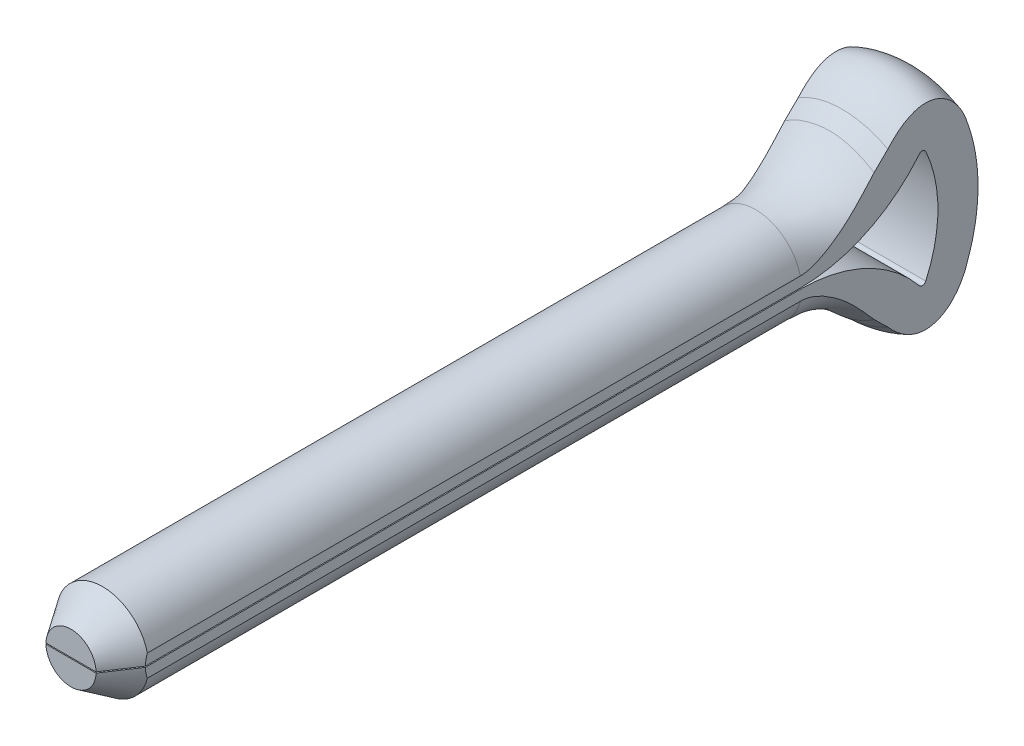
ISO-10303-21;
HEADER;
FILE_DESCRIPTION(('STEP AP214'),'2;1');
FILE_NAME('part.step','',(''),(''),'','','');
FILE_SCHEMA(('AUTOMOTIVE_DESIGN { 1 0 10303 214 1 1 1 1 }'));
ENDSEC;
DATA;
#1=APPLICATION_CONTEXT('core data for automotive mechanical design processes');
#2=APPLICATION_PROTOCOL_DEFINITION('international standard','automotive_design',2000,#1);
#3=PRODUCT_CONTEXT('',#1,'mechanical');
#4=PRODUCT('Part','Part','',(#3));
#5=PRODUCT_RELATED_PRODUCT_CATEGORY('part','',(#4));
#6=PRODUCT_DEFINITION_FORMATION('','',#4);
#7=PRODUCT_DEFINITION_CONTEXT('part definition',#1,'design');
#8=PRODUCT_DEFINITION('design','',#6,#7);
#9=PRODUCT_DEFINITION_SHAPE('','',#8);
#10=(LENGTH_UNIT() NAMED_UNIT(*) SI_UNIT(.MILLI.,.METRE.));
#11=(NAMED_UNIT(*) PLANE_ANGLE_UNIT() SI_UNIT($,.RADIAN.));
#12=(NAMED_UNIT(*) SI_UNIT($,.STERADIAN.) SOLID_ANGLE_UNIT());
#13=UNCERTAINTY_MEASURE_WITH_UNIT(LENGTH_MEASURE(1.E-05),#10,'distance_accuracy_value','');
#14=(GEOMETRIC_REPRESENTATION_CONTEXT(3) GLOBAL_UNCERTAINTY_ASSIGNED_CONTEXT((#13)) GLOBAL_UNIT_ASSIGNED_CONTEXT((#10,
#11,#12)) REPRESENTATION_CONTEXT('',''));
#15=CARTESIAN_POINT('',(0.,0.,0.));
#16=DIRECTION('',(0.,0.,1.));
#17=DIRECTION('',(1.,0.,0.));
#18=AXIS2_PLACEMENT_3D('',#15,#16,#17);
#19=CARTESIAN_POINT('',(0.,0.,0.));
#20=DIRECTION('',(0.,0.,-1.));
#21=DIRECTION('',(-1.,0.,0.));
#22=AXIS2_PLACEMENT_3D('',#19,#20,#21);
#23=CONICAL_SURFACE('',#22,0.603249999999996,0.588002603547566);
#24=CARTESIAN_POINT('',(1.0795,-1.50347164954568,-1.8714411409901));
#25=CARTESIAN_POINT('',(1.0795,-1.45202431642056,-1.80881544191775));
#26=CARTESIAN_POINT('',(1.0795,-1.4000873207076,-1.74657247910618));
#27=CARTESIAN_POINT('',(1.0795,-1.29471141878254,-1.62318014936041));
#28=CARTESIAN_POINT('',(1.0795,-1.24126997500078,-1.56203295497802));
#29=CARTESIAN_POINT('',(1.0795,-1.13066974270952,-1.43930842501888));
#30=CARTESIAN_POINT('',(1.0795,-1.07344631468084,-1.37778900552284));
#31=CARTESIAN_POINT('',(1.0795,-0.956307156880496,-1.25741942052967));
#32=CARTESIAN_POINT('',(1.0795,-0.896393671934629,-1.19856710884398));
#33=CARTESIAN_POINT('',(1.0795,-0.800842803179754,-1.11091929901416));
#34=CARTESIAN_POINT('',(1.0795,-0.766572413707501,-1.08063886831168));
#35=CARTESIAN_POINT('',(1.0795,-0.696617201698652,-1.02176666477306));
#36=CARTESIAN_POINT('',(1.0795,-0.660932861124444,-0.993174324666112));
#37=CARTESIAN_POINT('',(1.0795,-0.588144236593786,-0.938508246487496));
#38=CARTESIAN_POINT('',(1.0795,-0.551054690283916,-0.912415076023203));
#39=CARTESIAN_POINT('',(1.0795,-0.474873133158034,-0.863371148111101));
#40=CARTESIAN_POINT('',(1.0795,-0.435783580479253,-0.840416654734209));
#41=CARTESIAN_POINT('',(1.0795,-0.366302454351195,-0.804563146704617));
#42=CARTESIAN_POINT('',(1.0795,-0.336449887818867,-0.790629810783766));
#43=CARTESIAN_POINT('',(1.0795,-0.275486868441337,-0.765690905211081));
#44=CARTESIAN_POINT('',(1.0795,-0.24437486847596,-0.754689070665));
#45=CARTESIAN_POINT('',(1.0795,-0.17193511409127,-0.733691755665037));
#46=CARTESIAN_POINT('',(1.0795,-0.130242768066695,-0.724895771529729));
#47=CARTESIAN_POINT('',(1.0795,-0.0459882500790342,-0.714625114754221));
#48=CARTESIAN_POINT('',(1.0795,-0.00342734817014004,-0.713140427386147));
#49=CARTESIAN_POINT('',(1.0795,0.0812602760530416,-0.717713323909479));
#50=CARTESIAN_POINT('',(1.0795,0.123387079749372,-0.723769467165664));
#51=CARTESIAN_POINT('',(1.0795,0.206139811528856,-0.742484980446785));
#52=CARTESIAN_POINT('',(1.0795,0.24676390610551,-0.755152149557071));
#53=CARTESIAN_POINT('',(1.0795,0.319333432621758,-0.783058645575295));
#54=CARTESIAN_POINT('',(1.0795,0.351592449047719,-0.797511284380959));
#55=CARTESIAN_POINT('',(1.0795,0.414732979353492,-0.829191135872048));
#56=CARTESIAN_POINT('',(1.0795,0.445613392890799,-0.846420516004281));
#57=CARTESIAN_POINT('',(1.0795,0.506401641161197,-0.883198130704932));
#58=CARTESIAN_POINT('',(1.0795,0.536295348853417,-0.902769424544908));
#59=CARTESIAN_POINT('',(1.0795,0.594898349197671,-0.943568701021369));
#60=CARTESIAN_POINT('',(1.0795,0.623608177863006,-0.964795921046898));
#61=CARTESIAN_POINT('',(1.0795,0.707063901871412,-1.02949095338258));
#62=CARTESIAN_POINT('',(1.0795,0.760394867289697,-1.07477818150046));
#63=CARTESIAN_POINT('',(1.0795,0.864264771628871,-1.16847069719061));
#64=CARTESIAN_POINT('',(1.0795,0.914801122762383,-1.2168787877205));
#65=CARTESIAN_POINT('',(1.0795,1.01396522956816,-1.31597370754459));
#66=CARTESIAN_POINT('',(1.0795,1.06258488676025,-1.3666685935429));
#67=CARTESIAN_POINT('',(1.0795,1.15823160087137,-1.46954099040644));
#68=CARTESIAN_POINT('',(1.0795,1.20525844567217,-1.52171869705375));
#69=CARTESIAN_POINT('',(1.0795,1.29399254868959,-1.62251358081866));
#70=CARTESIAN_POINT('',(1.0795,1.33580361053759,-1.67103974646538));
#71=CARTESIAN_POINT('',(1.0795,1.41860658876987,-1.76879378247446));
#72=CARTESIAN_POINT('',(1.0795,1.4595984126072,-1.81802173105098));
#73=CARTESIAN_POINT('',(1.0795,1.54054673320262,-1.91658050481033));
#74=CARTESIAN_POINT('',(1.0795,1.58050922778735,-1.96590641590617));
#75=CARTESIAN_POINT('',(1.0795,1.65987763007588,-2.06498763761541));
#76=CARTESIAN_POINT('',(1.0795,1.69928365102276,-2.11474285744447));
#77=CARTESIAN_POINT('',(1.0795,1.7384700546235,-2.16466834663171));
#78=B_SPLINE_CURVE_WITH_KNOTS('',3,(#24,#25,#26,#27,#28,#29,#30,#31,#32,#33,#34,#35,#36,#37,#38,
#39,#40,#41,#42,#43,#44,#45,#46,#47,#48,#49,#50,#51,#52,#53,#54,#55,#56,#57,#58,#59,#60,#61,#62,
#63,#64,#65,#66,#67,#68,#69,#70,#71,#72,#73,#74,#75,#76,#77),.UNSPECIFIED.,.F.,.F.,(4,2,2,2,2,2,
2,2,2,2,2,2,2,2,2,2,2,2,2,2,2,2,2,2,2,2,4),(0.,0.243165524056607,0.486769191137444,
0.738775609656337,0.990575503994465,1.12773130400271,1.26484074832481,1.4007786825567,
1.53655337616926,1.6352588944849,1.73408958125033,1.86134485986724,1.98842578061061,
2.11548242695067,2.2426893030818,2.34858047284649,2.45455470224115,2.56167482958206,
2.66874591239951,2.87842299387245,3.08829109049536,3.29896729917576,3.50967145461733,
3.70182338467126,3.89399690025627,4.08444071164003,4.2748451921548),.UNSPECIFIED.);
#79=CARTESIAN_POINT('',(1.0795,-0.263735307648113,-0.761999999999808));
#80=VERTEX_POINT('',#79);
#81=CARTESIAN_POINT('',(1.0795,-0.0127,-0.714487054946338));
#82=VERTEX_POINT('',#81);
#83=EDGE_CURVE('E629',#80,#82,#78,.T.);
#84=ORIENTED_EDGE('',*,*,#83,.T.);
#85=CARTESIAN_POINT('',(2.0271535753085,-0.0127,-2.13591503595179));
#86=CARTESIAN_POINT('',(1.78605759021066,-0.0127,-1.77430761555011));
#87=CARTESIAN_POINT('',(1.54498244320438,-0.0127,-1.41268629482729));
#88=CARTESIAN_POINT('',(1.06279060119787,-0.0127,-0.689408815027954));
#89=CARTESIAN_POINT('',(0.821673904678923,-0.0127,-0.327752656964));
#90=CARTESIAN_POINT('',(0.532129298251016,-0.0127,0.10645432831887));
#91=CARTESIAN_POINT('',(0.483733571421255,-0.0127,0.179026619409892));
#92=CARTESIAN_POINT('',(0.386936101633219,-0.0127,0.324163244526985));
#93=CARTESIAN_POINT('',(0.33853435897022,-0.0127,0.39672757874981));
#94=CARTESIAN_POINT('',(0.265909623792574,-0.0127,0.505558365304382));
#95=CARTESIAN_POINT('',(0.241697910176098,-0.0127,0.541832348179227));
#96=CARTESIAN_POINT('',(0.19325758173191,-0.0127,0.61437290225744));
#97=CARTESIAN_POINT('',(0.169028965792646,-0.0127,0.650639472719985));
#98=CARTESIAN_POINT('',(0.132639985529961,-0.0127,0.705010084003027));
#99=CARTESIAN_POINT('',(0.120502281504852,-0.0127,0.723129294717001));
#100=CARTESIAN_POINT('',(0.0961988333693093,-0.0127,0.759343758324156));
#101=CARTESIAN_POINT('',(0.0840330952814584,-0.0127,0.777439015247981));
#102=CARTESIAN_POINT('',(0.0656947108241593,-0.0127,0.804518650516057));
#103=CARTESIAN_POINT('',(0.0595675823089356,-0.0127,0.813533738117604));
#104=CARTESIAN_POINT('',(0.0472474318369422,-0.0127,0.831526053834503));
#105=CARTESIAN_POINT('',(0.0410543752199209,-0.0127,0.84050325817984));
#106=CARTESIAN_POINT('',(0.0315803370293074,-0.0127,0.853839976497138));
#107=CARTESIAN_POINT('',(0.0283919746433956,-0.0127,0.858263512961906));
#108=CARTESIAN_POINT('',(0.0218789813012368,-0.0127,0.867001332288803));
#109=CARTESIAN_POINT('',(0.0185544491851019,-0.0127,0.871315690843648));
#110=CARTESIAN_POINT('',(0.0129854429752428,-0.0127,0.87770470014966));
#111=CARTESIAN_POINT('',(0.0109231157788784,-0.0127,0.87991788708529));
#112=CARTESIAN_POINT('',(0.00800727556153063,-0.0127,0.882365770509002));
#113=CARTESIAN_POINT('',(0.00738020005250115,-0.0127,0.882858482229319));
#114=CARTESIAN_POINT('',(0.0060763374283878,-0.0127,0.883774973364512));
#115=CARTESIAN_POINT('',(0.00539958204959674,-0.0127,0.884198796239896));
#116=CARTESIAN_POINT('',(0.00418159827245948,-0.0127,0.884831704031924));
#117=CARTESIAN_POINT('',(0.00365472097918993,-0.0127,0.8850677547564));
#118=CARTESIAN_POINT('',(0.00257068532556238,-0.0127,0.885454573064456));
#119=CARTESIAN_POINT('',(0.00201361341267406,-0.0127,0.885605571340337));
#120=CARTESIAN_POINT('',(0.00096237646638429,-0.0127,0.885784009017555));
#121=CARTESIAN_POINT('',(0.000470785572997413,-0.0127,0.885826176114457));
#122=CARTESIAN_POINT('',(-0.000512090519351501,-0.0127,0.88582377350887));
#123=CARTESIAN_POINT('',(-0.00100337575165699,-0.0127,0.885779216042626));
#124=CARTESIAN_POINT('',(-0.00208193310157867,-0.0127,0.885591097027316));
#125=CARTESIAN_POINT('',(-0.00266558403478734,-0.0127,0.88542729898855));
#126=CARTESIAN_POINT('',(-0.00379915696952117,-0.0127,0.885008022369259));
#127=CARTESIAN_POINT('',(-0.00434897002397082,-0.0127,0.884752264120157));
#128=CARTESIAN_POINT('',(-0.00617157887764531,-0.0127,0.883773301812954));
#129=CARTESIAN_POINT('',(-0.00736187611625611,-0.0127,0.882902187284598));
#130=CARTESIAN_POINT('',(-0.00962291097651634,-0.0127,0.881014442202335));
#131=CARTESIAN_POINT('',(-0.010692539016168,-0.0127,0.87999663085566));
#132=CARTESIAN_POINT('',(-0.0140043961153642,-0.0127,0.876632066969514));
#133=CARTESIAN_POINT('',(-0.0161138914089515,-0.0127,0.874155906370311));
#134=CARTESIAN_POINT('',(-0.020212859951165,-0.0127,0.869105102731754));
#135=CARTESIAN_POINT('',(-0.0222020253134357,-0.0127,0.866530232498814));
#136=CARTESIAN_POINT('',(-0.02806764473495,-0.0127,0.858749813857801));
#137=CARTESIAN_POINT('',(-0.0318534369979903,-0.0127,0.853474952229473));
#138=CARTESIAN_POINT('',(-0.0430513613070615,-0.0127,0.837645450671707));
#139=CARTESIAN_POINT('',(-0.0503553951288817,-0.0127,0.827017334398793));
#140=CARTESIAN_POINT('',(-0.0648965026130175,-0.0127,0.805706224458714));
#141=CARTESIAN_POINT('',(-0.072133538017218,-0.0127,0.795023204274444));
#142=CARTESIAN_POINT('',(-0.0865693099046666,-0.0127,0.773642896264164));
#143=CARTESIAN_POINT('',(-0.0937680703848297,-0.0127,0.762945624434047));
#144=CARTESIAN_POINT('',(-0.108148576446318,-0.0127,0.741542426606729));
#145=CARTESIAN_POINT('',(-0.115330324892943,-0.0127,0.730836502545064));
#146=CARTESIAN_POINT('',(-0.151219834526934,-0.0127,0.677293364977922));
#147=CARTESIAN_POINT('',(-0.179868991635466,-0.0127,0.634416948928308));
#148=CARTESIAN_POINT('',(-0.237148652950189,-0.0127,0.548647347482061));
#149=CARTESIAN_POINT('',(-0.265779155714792,-0.0127,0.505754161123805));
#150=CARTESIAN_POINT('',(-0.351666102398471,-0.0127,0.377047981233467));
#151=CARTESIAN_POINT('',(-0.408907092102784,-0.0127,0.291224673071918));
#152=CARTESIAN_POINT('',(-0.580609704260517,-0.0127,0.0337614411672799));
#153=CARTESIAN_POINT('',(-0.695060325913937,-0.0127,-0.137885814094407));
#154=CARTESIAN_POINT('',(-0.923955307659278,-0.0127,-0.481186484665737));
#155=CARTESIAN_POINT('',(-1.03839966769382,-0.0127,-0.65283990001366));
#156=CARTESIAN_POINT('',(-1.38171143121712,-0.0127,-1.16777613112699));
#157=CARTESIAN_POINT('',(-1.61057516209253,-0.0127,-1.51106139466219));
#158=CARTESIAN_POINT('',(-1.90200976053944,-0.0127,-1.94820324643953));
#159=CARTESIAN_POINT('',(-1.96458167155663,-0.0127,-2.04205913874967));
#160=CARTESIAN_POINT('',(-2.0271535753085,-0.0127,-2.13591503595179));
#161=B_SPLINE_CURVE_WITH_KNOTS('',3,(#85,#86,#87,#88,#89,#90,#91,#92,#93,#94,#95,#96,#97,#98,
#99,#100,#101,#102,#103,#104,#105,#106,#107,#108,#109,#110,#111,#112,#113,#114,#115,#116,#117,
#118,#119,#120,#121,#122,#123,#124,#125,#126,#127,#128,#129,#130,#131,#132,#133,#134,#135,#136,
#137,#138,#139,#140,#141,#142,#143,#144,#145,#146,#147,#148,#149,#150,#151,#152,#153,#154,#155,
#156,#157,#158,#159,#160),.UNSPECIFIED.,.F.,.F.,(4,2,2,2,2,2,2,2,2,2,2,2,2,2,2,2,2,2,2,2,2,2,2,
2,2,2,2,2,2,2,2,2,2,2,2,2,2,4),(0.,1.30383466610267,2.60782543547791,2.86951218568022,
3.13118907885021,3.26202516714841,3.3928708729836,3.45829768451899,3.52371155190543,
3.55641181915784,3.58913022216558,3.60548550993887,3.62182912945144,3.63086144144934,
3.63325106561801,3.63563917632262,3.63736612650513,3.63908836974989,3.64056118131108,
3.64203378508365,3.64384176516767,3.64565529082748,3.6500450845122,3.65447242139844,
3.66421126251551,3.67397405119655,3.69344699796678,3.73213616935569,3.77084621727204,
3.80952815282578,3.84820302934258,4.00290416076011,4.15761609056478,4.46709877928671,
5.08601358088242,5.70493333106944,6.94267741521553,7.28108183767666),.UNSPECIFIED.);
#162=CARTESIAN_POINT('',(0.603116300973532,-0.0127,0.));
#163=VERTEX_POINT('',#162);
#164=EDGE_CURVE('E368',#82,#163,#161,.T.);
#165=ORIENTED_EDGE('',*,*,#164,.T.);
#166=CARTESIAN_POINT('',(0.,0.,0.));
#167=DIRECTION('',(0.,0.,1.));
#168=DIRECTION('',(1.,0.,0.));
#169=AXIS2_PLACEMENT_3D('',#166,#167,#168);
#170=CIRCLE('',#169,0.603249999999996);
#171=CARTESIAN_POINT('',(-0.603116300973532,-0.0127,0.));
#172=VERTEX_POINT('',#171);
#173=EDGE_CURVE('E625',#172,#163,#170,.T.);
#174=ORIENTED_EDGE('',*,*,#173,.F.);
#175=CARTESIAN_POINT('',(-1.0795,-0.0127,-0.714487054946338));
#176=VERTEX_POINT('',#175);
#177=EDGE_CURVE('E358',#172,#176,#161,.T.);
#178=ORIENTED_EDGE('',*,*,#177,.T.);
#179=CARTESIAN_POINT('',(-1.0795,-1.50347164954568,-1.8714411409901));
#180=CARTESIAN_POINT('',(-1.0795,-1.45202431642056,-1.80881544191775));
#181=CARTESIAN_POINT('',(-1.0795,-1.4000873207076,-1.74657247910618));
#182=CARTESIAN_POINT('',(-1.0795,-1.29471141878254,-1.62318014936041));
#183=CARTESIAN_POINT('',(-1.0795,-1.24126997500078,-1.56203295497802));
#184=CARTESIAN_POINT('',(-1.0795,-1.13066974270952,-1.43930842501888));
#185=CARTESIAN_POINT('',(-1.0795,-1.07344631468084,-1.37778900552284));
#186=CARTESIAN_POINT('',(-1.0795,-0.956307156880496,-1.25741942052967));
#187=CARTESIAN_POINT('',(-1.0795,-0.896393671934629,-1.19856710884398));
#188=CARTESIAN_POINT('',(-1.0795,-0.800842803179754,-1.11091929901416));
#189=CARTESIAN_POINT('',(-1.0795,-0.766572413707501,-1.08063886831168));
#190=CARTESIAN_POINT('',(-1.0795,-0.696617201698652,-1.02176666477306));
#191=CARTESIAN_POINT('',(-1.0795,-0.660932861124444,-0.993174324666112));
#192=CARTESIAN_POINT('',(-1.0795,-0.588144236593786,-0.938508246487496));
#193=CARTESIAN_POINT('',(-1.0795,-0.551054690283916,-0.912415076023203));
#194=CARTESIAN_POINT('',(-1.0795,-0.474873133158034,-0.863371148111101));
#195=CARTESIAN_POINT('',(-1.0795,-0.435783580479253,-0.840416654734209));
#196=CARTESIAN_POINT('',(-1.0795,-0.366302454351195,-0.804563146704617));
#197=CARTESIAN_POINT('',(-1.0795,-0.336449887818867,-0.790629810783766));
#198=CARTESIAN_POINT('',(-1.0795,-0.275486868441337,-0.765690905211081));
#199=CARTESIAN_POINT('',(-1.0795,-0.24437486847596,-0.754689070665));
#200=CARTESIAN_POINT('',(-1.0795,-0.17193511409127,-0.733691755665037));
#201=CARTESIAN_POINT('',(-1.0795,-0.130242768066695,-0.724895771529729));
#202=CARTESIAN_POINT('',(-1.0795,-0.0459882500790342,-0.714625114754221));
#203=CARTESIAN_POINT('',(-1.0795,-0.00342734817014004,-0.713140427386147));
#204=CARTESIAN_POINT('',(-1.0795,0.0812602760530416,-0.717713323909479));
#205=CARTESIAN_POINT('',(-1.0795,0.123387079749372,-0.723769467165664));
#206=CARTESIAN_POINT('',(-1.0795,0.206139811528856,-0.742484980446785));
#207=CARTESIAN_POINT('',(-1.0795,0.24676390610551,-0.755152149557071));
#208=CARTESIAN_POINT('',(-1.0795,0.319333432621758,-0.783058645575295));
#209=CARTESIAN_POINT('',(-1.0795,0.351592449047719,-0.797511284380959));
#210=CARTESIAN_POINT('',(-1.0795,0.414732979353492,-0.829191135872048));
#211=CARTESIAN_POINT('',(-1.0795,0.445613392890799,-0.846420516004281));
#212=CARTESIAN_POINT('',(-1.0795,0.506401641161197,-0.883198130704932));
#213=CARTESIAN_POINT('',(-1.0795,0.536295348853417,-0.902769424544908));
#214=CARTESIAN_POINT('',(-1.0795,0.594898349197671,-0.943568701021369));
#215=CARTESIAN_POINT('',(-1.0795,0.623608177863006,-0.964795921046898));
#216=CARTESIAN_POINT('',(-1.0795,0.707063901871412,-1.02949095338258));
#217=CARTESIAN_POINT('',(-1.0795,0.760394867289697,-1.07477818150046));
#218=CARTESIAN_POINT('',(-1.0795,0.864264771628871,-1.16847069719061));
#219=CARTESIAN_POINT('',(-1.0795,0.914801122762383,-1.2168787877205));
#220=CARTESIAN_POINT('',(-1.0795,1.01396522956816,-1.31597370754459));
#221=CARTESIAN_POINT('',(-1.0795,1.06258488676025,-1.3666685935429));
#222=CARTESIAN_POINT('',(-1.0795,1.15823160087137,-1.46954099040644));
#223=CARTESIAN_POINT('',(-1.0795,1.20525844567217,-1.52171869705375));
#224=CARTESIAN_POINT('',(-1.0795,1.29399254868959,-1.62251358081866));
#225=CARTESIAN_POINT('',(-1.0795,1.33580361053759,-1.67103974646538));
#226=CARTESIAN_POINT('',(-1.0795,1.41860658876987,-1.76879378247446));
#227=CARTESIAN_POINT('',(-1.0795,1.4595984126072,-1.81802173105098));
#228=CARTESIAN_POINT('',(-1.0795,1.54054673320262,-1.91658050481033));
#229=CARTESIAN_POINT('',(-1.0795,1.58050922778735,-1.96590641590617));
#230=CARTESIAN_POINT('',(-1.0795,1.65987763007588,-2.06498763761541));
#231=CARTESIAN_POINT('',(-1.0795,1.69928365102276,-2.11474285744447));
#232=CARTESIAN_POINT('',(-1.0795,1.7384700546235,-2.16466834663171));
#233=B_SPLINE_CURVE_WITH_KNOTS('',3,(#179,#180,#181,#182,#183,#184,#185,#186,#187,#188,#189,
#190,#191,#192,#193,#194,#195,#196,#197,#198,#199,#200,#201,#202,#203,#204,#205,#206,#207,#208,
#209,#210,#211,#212,#213,#214,#215,#216,#217,#218,#219,#220,#221,#222,#223,#224,#225,#226,#227,
#228,#229,#230,#231,#232),.UNSPECIFIED.,.F.,.F.,(4,2,2,2,2,2,2,2,2,2,2,2,2,2,2,2,2,2,2,2,2,2,2,
2,2,2,4),(0.,0.243165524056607,0.486769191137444,0.738775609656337,0.990575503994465,
1.12773130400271,1.26484074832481,1.4007786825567,1.53655337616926,1.6352588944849,
1.73408958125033,1.86134485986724,1.98842578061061,2.11548242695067,2.2426893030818,
2.34858047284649,2.45455470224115,2.56167482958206,2.66874591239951,2.87842299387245,
3.08829109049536,3.29896729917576,3.50967145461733,3.70182338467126,3.89399690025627,
4.08444071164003,4.2748451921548),.UNSPECIFIED.);
#234=CARTESIAN_POINT('',(-1.0795,-0.263735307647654,-0.76200000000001));
#235=VERTEX_POINT('',#234);
#236=EDGE_CURVE('E635',#176,#235,#233,.F.);
#237=ORIENTED_EDGE('',*,*,#236,.T.);
#238=CARTESIAN_POINT('',(0.,0.,-0.76200000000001));
#239=DIRECTION('',(0.,0.,1.));
#240=DIRECTION('',(1.,0.,0.));
#241=AXIS2_PLACEMENT_3D('',#238,#239,#240);
#242=CIRCLE('',#241,1.11125);
#243=EDGE_CURVE('E626',#80,#235,#242,.F.);
#244=ORIENTED_EDGE('',*,*,#243,.F.);
#245=EDGE_LOOP('',(#84,#165,#174,#178,#237,#244));
#246=FACE_BOUND('',#245,.T.);
#247=ADVANCED_FACE('F185',(#246),#23,.T.);
#248=CARTESIAN_POINT('',(0.,0.,0.));
#249=DIRECTION('',(0.,0.,1.));
#250=DIRECTION('',(1.,0.,0.));
#251=AXIS2_PLACEMENT_3D('',#248,#249,#250);
#252=PLANE('',#251);
#253=ORIENTED_EDGE('',*,*,#173,.T.);
#254=DIRECTION('',(-1.,0.,0.));
#255=VECTOR('',#254,1.);
#256=CARTESIAN_POINT('',(2.54,-0.0127,0.));
#257=LINE('',#256,#255);
#258=EDGE_CURVE('E345',#163,#172,#257,.T.);
#259=ORIENTED_EDGE('',*,*,#258,.T.);
#260=EDGE_LOOP('',(#253,#259));
#261=FACE_BOUND('',#260,.T.);
#262=ADVANCED_FACE('F648',(#261),#252,.T.);
#263=CARTESIAN_POINT('',(0.,0.,0.));
#264=DIRECTION('',(0.,0.,-1.));
#265=DIRECTION('',(-1.,0.,0.));
#266=AXIS2_PLACEMENT_3D('',#263,#264,#265);
#267=CYLINDRICAL_SURFACE('',#266,1.11125);
#268=CARTESIAN_POINT('',(0.,0.,-16.51));
#269=DIRECTION('',(0.,0.,1.));
#270=DIRECTION('',(1.,0.,0.));
#271=AXIS2_PLACEMENT_3D('',#268,#269,#270);
#272=CIRCLE('',#271,1.11125);
#273=CARTESIAN_POINT('',(-1.07949992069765,0.263917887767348,-16.51));
#274=VERTEX_POINT('',#273);
#275=CARTESIAN_POINT('',(1.07950019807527,0.264140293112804,-16.51));
#276=VERTEX_POINT('',#275);
#277=EDGE_CURVE('E613',#274,#276,#272,.F.);
#278=ORIENTED_EDGE('',*,*,#277,.F.);
#279=DIRECTION('',(0.,0.,-1.));
#280=VECTOR('',#279,1.);
#281=CARTESIAN_POINT('',(-1.0795,0.263735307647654,0.));
#282=LINE('',#281,#280);
#283=CARTESIAN_POINT('',(-1.0795,0.263735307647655,-0.76200000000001));
#284=VERTEX_POINT('',#283);
#285=EDGE_CURVE('E561',#274,#284,#282,.F.);
#286=ORIENTED_EDGE('',*,*,#285,.T.);
#287=CARTESIAN_POINT('',(1.0795,0.263735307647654,-0.76200000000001));
#288=VERTEX_POINT('',#287);
#289=EDGE_CURVE('E624',#284,#288,#242,.F.);
#290=ORIENTED_EDGE('',*,*,#289,.T.);
#291=DIRECTION('',(0.,0.,-1.));
#292=VECTOR('',#291,1.);
#293=CARTESIAN_POINT('',(1.0795,0.263735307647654,0.));
#294=LINE('',#293,#292);
#295=EDGE_CURVE('E395',#288,#276,#294,.T.);
#296=ORIENTED_EDGE('',*,*,#295,.T.);
#297=EDGE_LOOP('',(#278,#286,#290,#296));
#298=FACE_BOUND('',#297,.T.);
#299=ADVANCED_FACE('F645',(#298),#267,.T.);
#300=ORIENTED_EDGE('',*,*,#243,.T.);
#301=DIRECTION('',(0.,0.,-1.));
#302=VECTOR('',#301,1.);
#303=CARTESIAN_POINT('',(-1.0795,-0.263735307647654,0.));
#304=LINE('',#303,#302);
#305=CARTESIAN_POINT('',(-1.07950019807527,-0.264140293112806,-16.51));
#306=VERTEX_POINT('',#305);
#307=EDGE_CURVE('E556',#235,#306,#304,.T.);
#308=ORIENTED_EDGE('',*,*,#307,.T.);
#309=CARTESIAN_POINT('',(1.07949992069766,-0.263917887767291,-16.51));
#310=VERTEX_POINT('',#309);
#311=EDGE_CURVE('E676',#310,#306,#272,.F.);
#312=ORIENTED_EDGE('',*,*,#311,.F.);
#313=DIRECTION('',(0.,0.,-1.));
#314=VECTOR('',#313,1.);
#315=CARTESIAN_POINT('',(1.0795,-0.263735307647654,0.));
#316=LINE('',#315,#314);
#317=EDGE_CURVE('E398',#310,#80,#316,.F.);
#318=ORIENTED_EDGE('',*,*,#317,.T.);
#319=EDGE_LOOP('',(#300,#308,#312,#318));
#320=FACE_BOUND('',#319,.T.);
#321=ADVANCED_FACE('F425',(#320),#267,.T.);
#322=CARTESIAN_POINT('',(-1.8812384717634,0.1376321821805,-18.3009227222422));
#323=CARTESIAN_POINT('',(-1.87731136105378,0.137647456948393,-18.2966151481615));
#324=CARTESIAN_POINT('',(-1.87338425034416,0.137662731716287,-18.2923075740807));
#325=CARTESIAN_POINT('',(-1.86945713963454,0.137678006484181,-18.288));
#326=CARTESIAN_POINT('',(-1.48588435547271,0.139169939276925,-17.8672662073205));
#327=CARTESIAN_POINT('',(-1.10231157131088,0.140661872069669,-17.4465324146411));
#328=CARTESIAN_POINT('',(-1.10231157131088,0.140661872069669,-16.51));
#329=CARTESIAN_POINT('',(-1.88503653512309,0.0857179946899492,-18.3009227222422));
#330=CARTESIAN_POINT('',(-1.88110984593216,0.0858416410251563,-18.2966151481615));
#331=CARTESIAN_POINT('',(-1.87718315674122,0.0859652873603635,-18.2923075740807));
#332=CARTESIAN_POINT('',(-1.87325646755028,0.0860889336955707,-18.288));
#333=CARTESIAN_POINT('',(-1.48972485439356,0.0981658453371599,-17.8672662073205));
#334=CARTESIAN_POINT('',(-1.10619324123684,0.110242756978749,-17.4465324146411));
#335=CARTESIAN_POINT('',(-1.10619324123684,0.110242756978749,-16.51));
#336=CARTESIAN_POINT('',(-1.88834643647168,-0.0174420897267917,-18.3009226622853));
#337=CARTESIAN_POINT('',(-1.88442938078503,-0.0171037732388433,-18.2966151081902));
#338=CARTESIAN_POINT('',(-1.88051232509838,-0.0167654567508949,-18.2923075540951));
#339=CARTESIAN_POINT('',(-1.87659526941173,-0.0164271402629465,-18.288));
#340=CARTESIAN_POINT('',(-1.49400458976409,0.0166172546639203,-17.8672681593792));
#341=CARTESIAN_POINT('',(-1.11141391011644,0.0496616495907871,-17.4465363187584));
#342=CARTESIAN_POINT('',(-1.11141391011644,0.0496616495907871,-16.51));
#343=CARTESIAN_POINT('',(-1.88090279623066,-0.169656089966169,-18.3009225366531));
#344=CARTESIAN_POINT('',(-1.87702554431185,-0.16900299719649,-18.2966150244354));
#345=CARTESIAN_POINT('',(-1.87314829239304,-0.168349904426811,-18.2923075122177));
#346=CARTESIAN_POINT('',(-1.86927104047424,-0.167696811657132,-18.288));
#347=CARTESIAN_POINT('',(-1.49056811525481,-0.103907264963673,-17.867272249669));
#348=CARTESIAN_POINT('',(-1.11186519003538,-0.0401177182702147,-17.446544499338));
#349=CARTESIAN_POINT('',(-1.11186519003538,-0.0401177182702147,-16.51));
#350=CARTESIAN_POINT('',(-1.86150084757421,-0.318822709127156,-18.3009224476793));
#351=CARTESIAN_POINT('',(-1.85768773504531,-0.317863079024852,-18.2966149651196));
#352=CARTESIAN_POINT('',(-1.85387462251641,-0.316903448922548,-18.2923074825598));
#353=CARTESIAN_POINT('',(-1.85006150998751,-0.315943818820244,-18.288));
#354=CARTESIAN_POINT('',(-1.47762327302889,-0.222213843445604,-17.8672751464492));
#355=CARTESIAN_POINT('',(-1.10518503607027,-0.128483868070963,-17.4465502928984));
#356=CARTESIAN_POINT('',(-1.10518503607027,-0.128483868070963,-16.51));
#357=CARTESIAN_POINT('',(-1.67604040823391,-1.19241060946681,-18.3009224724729));
#358=CARTESIAN_POINT('',(-1.67275203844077,-1.18966724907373,-18.2966149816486));
#359=CARTESIAN_POINT('',(-1.66946366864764,-1.18692388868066,-18.2923074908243));
#360=CARTESIAN_POINT('',(-1.6661752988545,-1.18418052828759,-18.288));
#361=CARTESIAN_POINT('',(-1.34499027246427,-0.916228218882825,-17.867274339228));
#362=CARTESIAN_POINT('',(-1.02380524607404,-0.648275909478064,-17.446548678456));
#363=CARTESIAN_POINT('',(-1.02380524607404,-0.648275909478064,-16.51));
#364=CARTESIAN_POINT('',(-0.96825918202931,-1.82046945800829,-18.3009226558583));
#365=CARTESIAN_POINT('',(-0.966540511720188,-1.81653560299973,-18.2966151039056));
#366=CARTESIAN_POINT('',(-0.964821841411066,-1.81260174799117,-18.2923075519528));
#367=CARTESIAN_POINT('',(-0.963103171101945,-1.80866789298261,-18.288));
#368=CARTESIAN_POINT('',(-0.795235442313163,-1.42443637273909,-17.8672683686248));
#369=CARTESIAN_POINT('',(-0.627367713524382,-1.04020485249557,-17.4465367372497));
#370=CARTESIAN_POINT('',(-0.627367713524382,-1.04020485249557,-16.51));
#371=CARTESIAN_POINT('',(0.900651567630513,-1.95719973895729,-18.300922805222));
#372=CARTESIAN_POINT('',(0.898468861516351,-1.95328105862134,-18.2966152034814));
#373=CARTESIAN_POINT('',(0.896286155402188,-1.94936237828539,-18.2923076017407));
#374=CARTESIAN_POINT('',(0.894103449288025,-1.94544369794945,-18.288));
#375=CARTESIAN_POINT('',(0.680911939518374,-1.56269433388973,-17.8672635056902));
#376=CARTESIAN_POINT('',(0.467720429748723,-1.17994496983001,-17.4465270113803));
#377=CARTESIAN_POINT('',(0.467720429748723,-1.17994496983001,-16.51));
#378=CARTESIAN_POINT('',(1.80527720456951,-1.17591593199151,-18.3009227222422));
#379=CARTESIAN_POINT('',(1.80134166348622,-1.17376377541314,-18.2966151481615));
#380=CARTESIAN_POINT('',(1.79740612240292,-1.17161161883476,-18.2923075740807));
#381=CARTESIAN_POINT('',(1.79347058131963,-1.16945946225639,-18.288));
#382=CARTESIAN_POINT('',(1.40907437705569,-0.959251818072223,-17.8672662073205));
#383=CARTESIAN_POINT('',(1.02467817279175,-0.74904417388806,-17.4465324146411));
#384=CARTESIAN_POINT('',(1.02467817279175,-0.74904417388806,-16.51));
#385=CARTESIAN_POINT('',(1.95719973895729,0.900651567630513,-18.3009227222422));
#386=CARTESIAN_POINT('',(1.95328105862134,0.898468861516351,-18.2966151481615));
#387=CARTESIAN_POINT('',(1.94936237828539,0.896286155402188,-18.2923075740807));
#388=CARTESIAN_POINT('',(1.94544369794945,0.894103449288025,-18.288));
#389=CARTESIAN_POINT('',(1.56269433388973,0.680911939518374,-17.8672662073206));
#390=CARTESIAN_POINT('',(1.17994496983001,0.467720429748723,-17.4465324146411));
#391=CARTESIAN_POINT('',(1.17994496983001,0.467720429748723,-16.51));
#392=CARTESIAN_POINT('',(1.17591593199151,1.80527720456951,-18.300922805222));
#393=CARTESIAN_POINT('',(1.17376377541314,1.80134166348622,-18.2966152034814));
#394=CARTESIAN_POINT('',(1.17161161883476,1.79740612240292,-18.2923076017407));
#395=CARTESIAN_POINT('',(1.16945946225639,1.79347058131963,-18.288));
#396=CARTESIAN_POINT('',(0.959251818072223,1.40907437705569,-17.8672635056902));
#397=CARTESIAN_POINT('',(0.74904417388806,1.02467817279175,-17.4465270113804));
#398=CARTESIAN_POINT('',(0.74904417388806,1.02467817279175,-16.51));
#399=CARTESIAN_POINT('',(-0.692994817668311,1.94200748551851,-18.3009226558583));
#400=CARTESIAN_POINT('',(-0.691245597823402,1.93808711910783,-18.2966151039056));
#401=CARTESIAN_POINT('',(-0.689496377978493,1.93416675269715,-18.2923075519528));
#402=CARTESIAN_POINT('',(-0.687747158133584,1.93024638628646,-18.288));
#403=CARTESIAN_POINT('',(-0.516895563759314,1.54733233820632,-17.8672683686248));
#404=CARTESIAN_POINT('',(-0.346043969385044,1.16441829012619,-17.4465367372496));
#405=CARTESIAN_POINT('',(-0.346043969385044,1.16441829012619,-16.51));
#406=CARTESIAN_POINT('',(-1.4846484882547,1.42364791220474,-18.3009224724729));
#407=CARTESIAN_POINT('',(-1.48133887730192,1.42093021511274,-18.2966149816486));
#408=CARTESIAN_POINT('',(-1.47802926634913,1.41821251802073,-18.2923074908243));
#409=CARTESIAN_POINT('',(-1.47471965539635,1.41549482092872,-18.288));
#410=CARTESIAN_POINT('',(-1.15145994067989,1.15004912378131,-17.8672743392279));
#411=CARTESIAN_POINT('',(-0.828200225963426,0.884603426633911,-17.4465486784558));
#412=CARTESIAN_POINT('',(-0.828200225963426,0.884603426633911,-16.51));
#413=CARTESIAN_POINT('',(-1.79527773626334,0.586354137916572,-18.3009224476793));
#414=CARTESIAN_POINT('',(-1.79145727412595,0.585424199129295,-18.2966149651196));
#415=CARTESIAN_POINT('',(-1.78763681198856,0.584494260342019,-18.2923074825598));
#416=CARTESIAN_POINT('',(-1.78381634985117,0.583564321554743,-18.288));
#417=CARTESIAN_POINT('',(-1.41066025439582,0.492734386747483,-17.8672751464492));
#418=CARTESIAN_POINT('',(-1.03750415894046,0.401904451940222,-17.4465502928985));
#419=CARTESIAN_POINT('',(-1.03750415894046,0.401904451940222,-16.51));
#420=CARTESIAN_POINT('',(-1.83618307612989,0.441599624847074,-18.3009225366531));
#421=CARTESIAN_POINT('',(-1.83230086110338,0.440976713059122,-18.2966150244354));
#422=CARTESIAN_POINT('',(-1.82841864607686,0.440353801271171,-18.2923075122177));
#423=CARTESIAN_POINT('',(-1.82453643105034,0.439730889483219,-18.288));
#424=CARTESIAN_POINT('',(-1.44534874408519,0.378889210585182,-17.867272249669));
#425=CARTESIAN_POINT('',(-1.06616105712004,0.318047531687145,-17.446544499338));
#426=CARTESIAN_POINT('',(-1.06616105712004,0.318047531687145,-16.51));
#427=CARTESIAN_POINT('',(-1.86570095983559,0.292089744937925,-18.3009226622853));
#428=CARTESIAN_POINT('',(-1.86178139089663,0.291781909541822,-18.2966151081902));
#429=CARTESIAN_POINT('',(-1.85786182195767,0.291474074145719,-18.2923075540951));
#430=CARTESIAN_POINT('',(-1.85394225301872,0.291166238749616,-18.288));
#431=CARTESIAN_POINT('',(-1.47110609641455,0.26109902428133,-17.8672681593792));
#432=CARTESIAN_POINT('',(-1.08826993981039,0.231031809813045,-17.4465363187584));
#433=CARTESIAN_POINT('',(-1.08826993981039,0.231031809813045,-16.51));
#434=CARTESIAN_POINT('',(-1.8774404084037,0.18954636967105,-18.3009227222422));
#435=CARTESIAN_POINT('',(-1.8735128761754,0.18945327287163,-18.2966151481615));
#436=CARTESIAN_POINT('',(-1.8695853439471,0.189360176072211,-18.2923075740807));
#437=CARTESIAN_POINT('',(-1.86565781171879,0.189267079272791,-18.288));
#438=CARTESIAN_POINT('',(-1.48204385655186,0.180174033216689,-17.8672662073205));
#439=CARTESIAN_POINT('',(-1.09842990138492,0.171080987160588,-17.4465324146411));
#440=CARTESIAN_POINT('',(-1.09842990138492,0.171080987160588,-16.51));
#441=CARTESIAN_POINT('',(-1.8812384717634,0.1376321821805,-18.3009227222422));
#442=CARTESIAN_POINT('',(-1.87731136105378,0.137647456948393,-18.2966151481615));
#443=CARTESIAN_POINT('',(-1.87338425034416,0.137662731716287,-18.2923075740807));
#444=CARTESIAN_POINT('',(-1.86945713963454,0.137678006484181,-18.288));
#445=CARTESIAN_POINT('',(-1.48588435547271,0.139169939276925,-17.8672662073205));
#446=CARTESIAN_POINT('',(-1.10231157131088,0.140661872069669,-17.4465324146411));
#447=CARTESIAN_POINT('',(-1.10231157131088,0.140661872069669,-16.51));
#448=B_SPLINE_SURFACE_WITH_KNOTS('',3,3,((#322,#323,#324,#325,#326,#327,#328),(#329,#330,#331,
#332,#333,#334,#335),(#336,#337,#338,#339,#340,#341,#342),(#343,#344,#345,#346,#347,#348,#349),
(#350,#351,#352,#353,#354,#355,#356),(#357,#358,#359,#360,#361,#362,#363),(#364,#365,#366,#367,
#368,#369,#370),(#371,#372,#373,#374,#375,#376,#377),(#378,#379,#380,#381,#382,#383,#384),(#385,
#386,#387,#388,#389,#390,#391),(#392,#393,#394,#395,#396,#397,#398),(#399,#400,#401,#402,#403,
#404,#405),(#406,#407,#408,#409,#410,#411,#412),(#413,#414,#415,#416,#417,#418,#419),(#420,#421,
#422,#423,#424,#425,#426),(#427,#428,#429,#430,#431,#432,#433),(#434,#435,#436,#437,#438,#439,
#440),(#441,#442,#443,#444,#445,#446,#447)),.UNSPECIFIED.,.T.,.F.,.F.,(4,1,1,1,1,2,2,2,1,1,1,1,
4),(4,3,4),(0.,0.0125,0.0249999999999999,0.0375000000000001,0.05,0.25,0.5,0.75,0.95,0.9625,
0.975,0.9875,1.),(-0.0102382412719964,0.,1.),.UNSPECIFIED.);
#449=CARTESIAN_POINT('',(1.86945713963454,-0.137678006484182,-18.288));
#450=CARTESIAN_POINT('',(1.86589384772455,-0.186025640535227,-18.287995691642));
#451=CARTESIAN_POINT('',(1.86011962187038,-0.23420368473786,-18.2875855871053));
#452=CARTESIAN_POINT('',(1.84467409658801,-0.329944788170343,-18.2865439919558));
#453=CARTESIAN_POINT('',(1.83500040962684,-0.377507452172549,-18.2859123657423));
#454=CARTESIAN_POINT('',(1.81208508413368,-0.471933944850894,-18.2848155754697));
#455=CARTESIAN_POINT('',(1.79883142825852,-0.518794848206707,-18.2843509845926));
#456=CARTESIAN_POINT('',(1.76899085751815,-0.611434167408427,-18.2837790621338));
#457=CARTESIAN_POINT('',(1.75240447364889,-0.657212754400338,-18.2836716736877));
#458=CARTESIAN_POINT('',(1.7144781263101,-0.751251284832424,-18.2838506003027));
#459=CARTESIAN_POINT('',(1.69285635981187,-0.799397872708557,-18.2841706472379));
#460=CARTESIAN_POINT('',(1.64585997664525,-0.893847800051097,-18.2851496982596));
#461=CARTESIAN_POINT('',(1.6204837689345,-0.940150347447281,-18.2858088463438));
#462=CARTESIAN_POINT('',(1.56606400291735,-1.03041628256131,-18.287260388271));
#463=CARTESIAN_POINT('',(1.53702841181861,-1.07438446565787,-18.2880524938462));
#464=CARTESIAN_POINT('',(1.47531808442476,-1.15965994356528,-18.2895489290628));
#465=CARTESIAN_POINT('',(1.44264528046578,-1.2009686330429,-18.2902533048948));
#466=CARTESIAN_POINT('',(1.3728514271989,-1.28161467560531,-18.2914044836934));
#467=CARTESIAN_POINT('',(1.33563456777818,-1.32086942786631,-18.2918438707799));
#468=CARTESIAN_POINT('',(1.25773258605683,-1.39577601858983,-18.2923177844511));
#469=CARTESIAN_POINT('',(1.2170474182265,-1.43142780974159,-18.2923523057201));
#470=CARTESIAN_POINT('',(1.13252316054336,-1.49883874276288,-18.292008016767));
#471=CARTESIAN_POINT('',(1.08868192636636,-1.53059519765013,-18.2916289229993));
#472=CARTESIAN_POINT('',(0.998311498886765,-1.5899766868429,-18.2905581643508));
#473=CARTESIAN_POINT('',(0.951782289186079,-1.61760169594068,-18.2898664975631));
#474=CARTESIAN_POINT('',(0.816785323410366,-1.68986807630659,-18.2877353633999));
#475=CARTESIAN_POINT('',(0.725603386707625,-1.72956880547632,-18.2861521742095));
#476=CARTESIAN_POINT('',(0.585261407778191,-1.77851366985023,-18.2845443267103));
#477=CARTESIAN_POINT('',(0.537850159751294,-1.79306762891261,-18.2841361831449));
#478=CARTESIAN_POINT('',(0.442061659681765,-1.81868053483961,-18.2836981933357));
#479=CARTESIAN_POINT('',(0.393684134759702,-1.82973847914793,-18.2836684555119));
#480=CARTESIAN_POINT('',(0.290767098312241,-1.84934523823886,-18.2840274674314));
#481=CARTESIAN_POINT('',(0.23614705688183,-1.85747138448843,-18.2844637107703));
#482=CARTESIAN_POINT('',(0.126430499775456,-1.86911320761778,-18.2856334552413));
#483=CARTESIAN_POINT('',(0.0713341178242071,-1.87263013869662,-18.2863668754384));
#484=CARTESIAN_POINT('',(-0.0388875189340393,-1.87457357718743,-18.2875727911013));
#485=CARTESIAN_POINT('',(-0.0940125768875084,-1.87300845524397,-18.2880457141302));
#486=CARTESIAN_POINT('',(-0.203800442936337,-1.86417183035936,-18.2879394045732));
#487=CARTESIAN_POINT('',(-0.258463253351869,-1.85690035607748,-18.2873601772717));
#488=CARTESIAN_POINT('',(-0.36250793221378,-1.83825912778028,-18.2861257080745));
#489=CARTESIAN_POINT('',(-0.411960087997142,-1.82726730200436,-18.2854803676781));
#490=CARTESIAN_POINT('',(-0.509879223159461,-1.80150908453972,-18.2844400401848));
#491=CARTESIAN_POINT('',(-0.558346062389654,-1.78674215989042,-18.2840450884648));
#492=CARTESIAN_POINT('',(-0.654183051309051,-1.7535949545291,-18.2836694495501));
#493=CARTESIAN_POINT('',(-0.701549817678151,-1.7352048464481,-18.2836899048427));
#494=CARTESIAN_POINT('',(-0.794752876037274,-1.69494678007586,-18.2841298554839));
#495=CARTESIAN_POINT('',(-0.840589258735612,-1.67307902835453,-18.2845493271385));
#496=CARTESIAN_POINT('',(-0.984395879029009,-1.5975081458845,-18.2863194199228));
#497=CARTESIAN_POINT('',(-1.07901100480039,-1.53706050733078,-18.2881834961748));
#498=CARTESIAN_POINT('',(-1.21117855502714,-1.43437132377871,-18.2904055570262));
#499=CARTESIAN_POINT('',(-1.25356842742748,-1.39818372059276,-18.2910501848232));
#500=CARTESIAN_POINT('',(-1.33476166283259,-1.32195901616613,-18.2919651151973));
#501=CARTESIAN_POINT('',(-1.37356551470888,-1.28192244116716,-18.2922354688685));
#502=CARTESIAN_POINT('',(-1.44441816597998,-1.20145344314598,-18.2923232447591));
#503=CARTESIAN_POINT('',(-1.47675506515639,-1.1612741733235,-18.2921730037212));
#504=CARTESIAN_POINT('',(-1.53778373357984,-1.0782386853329,-18.2915270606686));
#505=CARTESIAN_POINT('',(-1.56647431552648,-1.03538160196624,-18.2910312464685));
#506=CARTESIAN_POINT('',(-1.64696432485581,-0.903136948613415,-18.2891953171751));
#507=CARTESIAN_POINT('',(-1.69308127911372,-0.810191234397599,-18.2875071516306));
#508=CARTESIAN_POINT('',(-1.75029016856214,-0.66717121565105,-18.2854754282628));
#509=CARTESIAN_POINT('',(-1.76727046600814,-0.619318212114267,-18.2848845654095));
#510=CARTESIAN_POINT('',(-1.79755819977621,-0.522456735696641,-18.2840375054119));
#511=CARTESIAN_POINT('',(-1.81086667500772,-0.473448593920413,-18.2837812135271));
#512=CARTESIAN_POINT('',(-1.83377762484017,-0.374663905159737,-18.2836919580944));
#513=CARTESIAN_POINT('',(-1.84338602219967,-0.324888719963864,-18.283858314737));
#514=CARTESIAN_POINT('',(-1.85883995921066,-0.2247409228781,-18.2845633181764));
#515=CARTESIAN_POINT('',(-1.86468482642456,-0.174368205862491,-18.2851020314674));
#516=CARTESIAN_POINT('',(-1.87065951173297,-0.0957780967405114,-18.2860294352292));
#517=CARTESIAN_POINT('',(-1.87217471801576,-0.0676600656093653,-18.286378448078));
#518=CARTESIAN_POINT('',(-1.87390024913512,-0.0113821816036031,-18.2870322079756));
#519=CARTESIAN_POINT('',(-1.87411062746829,0.0167776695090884,-18.2873369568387));
#520=CARTESIAN_POINT('',(-1.87314751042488,0.0730667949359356,-18.2878065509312));
#521=CARTESIAN_POINT('',(-1.87197451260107,0.101196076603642,-18.2879714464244));
#522=CARTESIAN_POINT('',(-1.86813269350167,0.157352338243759,-18.288020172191));
#523=CARTESIAN_POINT('',(-1.86546390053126,0.185379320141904,-18.2879040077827));
#524=CARTESIAN_POINT('',(-1.85872659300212,0.241281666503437,-18.2875018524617));
#525=CARTESIAN_POINT('',(-1.85465708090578,0.269156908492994,-18.2872157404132));
#526=CARTESIAN_POINT('',(-1.84521744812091,0.324684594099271,-18.2865830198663));
#527=CARTESIAN_POINT('',(-1.83984723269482,0.352337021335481,-18.2862364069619));
#528=CARTESIAN_POINT('',(-1.82189526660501,0.43492061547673,-18.2852306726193));
#529=CARTESIAN_POINT('',(-1.80747423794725,0.489461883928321,-18.2846058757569));
#530=CARTESIAN_POINT('',(-1.77595281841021,0.591253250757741,-18.2838622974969));
#531=CARTESIAN_POINT('',(-1.75931758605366,0.638648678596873,-18.2836956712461));
#532=CARTESIAN_POINT('',(-1.72261815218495,0.73205624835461,-18.2837745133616));
#533=CARTESIAN_POINT('',(-1.70255532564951,0.778068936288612,-18.2840198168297));
#534=CARTESIAN_POINT('',(-1.63724649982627,0.91369714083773,-18.2852602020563));
#535=CARTESIAN_POINT('',(-1.58686648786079,1.00094710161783,-18.2867595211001));
#536=CARTESIAN_POINT('',(-1.49811502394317,1.12949285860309,-18.2890183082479));
#537=CARTESIAN_POINT('',(-1.46431586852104,1.17401876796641,-18.289811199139));
#538=CARTESIAN_POINT('',(-1.39270161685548,1.25974822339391,-18.2911233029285));
#539=CARTESIAN_POINT('',(-1.35488651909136,1.30095176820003,-18.2916425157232));
#540=CARTESIAN_POINT('',(-1.27556371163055,1.37950474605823,-18.2922603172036));
#541=CARTESIAN_POINT('',(-1.23406194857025,1.41686018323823,-18.2923595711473));
#542=CARTESIAN_POINT('',(-1.14768307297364,1.48743278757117,-18.2921112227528));
#543=CARTESIAN_POINT('',(-1.10280621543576,1.52065026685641,-18.2917636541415));
#544=CARTESIAN_POINT('',(-1.01510700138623,1.57937907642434,-18.2907781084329));
#545=CARTESIAN_POINT('',(-0.972580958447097,1.60533484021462,-18.290175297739));
#546=CARTESIAN_POINT('',(-0.885547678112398,1.65368710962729,-18.288831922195));
#547=CARTESIAN_POINT('',(-0.841039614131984,1.67608211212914,-18.2880912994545));
#548=CARTESIAN_POINT('',(-0.704867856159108,1.73798139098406,-18.2859452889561));
#549=CARTESIAN_POINT('',(-0.61068350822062,1.77211608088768,-18.284618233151));
#550=CARTESIAN_POINT('',(-0.463431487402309,1.81349701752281,-18.2837424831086));
#551=CARTESIAN_POINT('',(-0.41171102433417,1.82585489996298,-18.2836526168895));
#552=CARTESIAN_POINT('',(-0.307467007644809,1.84650292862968,-18.2839345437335));
#553=CARTESIAN_POINT('',(-0.254943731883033,1.85479445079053,-18.2843061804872));
#554=CARTESIAN_POINT('',(-0.149526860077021,1.86711892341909,-18.2853594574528));
#555=CARTESIAN_POINT('',(-0.0966345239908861,1.87116250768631,-18.2860403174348));
#556=CARTESIAN_POINT('',(-0.0172063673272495,1.87377633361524,-18.2869649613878));
#557=CARTESIAN_POINT('',(0.00927902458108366,1.87407265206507,-18.287257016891));
#558=CARTESIAN_POINT('',(0.0622382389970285,1.87345052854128,-18.2877291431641));
#559=CARTESIAN_POINT('',(0.0887120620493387,1.87253215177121,-18.2879092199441));
#560=CARTESIAN_POINT('',(0.141950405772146,1.86935772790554,-18.2880330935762));
#561=CARTESIAN_POINT('',(0.168713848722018,1.86708325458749,-18.2879735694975));
#562=CARTESIAN_POINT('',(0.222095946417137,1.86123461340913,-18.2876675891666));
#563=CARTESIAN_POINT('',(0.248714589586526,1.85766034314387,-18.287421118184));
#564=CARTESIAN_POINT('',(0.328313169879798,1.84513358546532,-18.2865728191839));
#565=CARTESIAN_POINT('',(0.381015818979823,1.83437846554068,-18.2858622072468));
#566=CARTESIAN_POINT('',(0.485492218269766,1.80852364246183,-18.2846692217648));
#567=CARTESIAN_POINT('',(0.537262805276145,1.79341133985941,-18.2841875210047));
#568=CARTESIAN_POINT('',(0.63943401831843,1.7591326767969,-18.2836845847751));
#569=CARTESIAN_POINT('',(0.689834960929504,1.73996726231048,-18.2836632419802));
#570=CARTESIAN_POINT('',(0.787828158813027,1.69818059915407,-18.284073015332));
#571=CARTESIAN_POINT('',(0.835458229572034,1.6756479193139,-18.2844938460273));
#572=CARTESIAN_POINT('',(0.928789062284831,1.62684719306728,-18.2856272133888));
#573=CARTESIAN_POINT('',(0.974489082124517,1.60057772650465,-18.2863398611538));
#574=CARTESIAN_POINT('',(1.06345000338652,1.5443999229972,-18.2878416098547));
#575=CARTESIAN_POINT('',(1.10671635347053,1.51450023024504,-18.2886305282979));
#576=CARTESIAN_POINT('',(1.19049787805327,1.45109872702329,-18.2900697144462));
#577=CARTESIAN_POINT('',(1.23101442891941,1.41759874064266,-18.2907200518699));
#578=CARTESIAN_POINT('',(1.30970604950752,1.34642701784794,-18.2917238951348));
#579=CARTESIAN_POINT('',(1.34781782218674,1.30868506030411,-18.2920711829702));
#580=CARTESIAN_POINT('',(1.4204189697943,1.22986220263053,-18.2923559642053));
#581=CARTESIAN_POINT('',(1.45490827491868,1.18878123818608,-18.2922934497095));
#582=CARTESIAN_POINT('',(1.52000066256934,1.10361050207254,-18.2917755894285));
#583=CARTESIAN_POINT('',(1.55060152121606,1.05951903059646,-18.2913200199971));
#584=CARTESIAN_POINT('',(1.60772707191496,0.968767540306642,-18.2901348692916));
#585=CARTESIAN_POINT('',(1.63424986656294,0.922106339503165,-18.289405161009));
#586=CARTESIAN_POINT('',(1.70393352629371,0.786040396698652,-18.2872230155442));
#587=CARTESIAN_POINT('',(1.74208615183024,0.694000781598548,-18.2856832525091));
#588=CARTESIAN_POINT('',(1.78868884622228,0.55258819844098,-18.2842563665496));
#589=CARTESIAN_POINT('',(1.80245620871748,0.504867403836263,-18.2839279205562));
#590=CARTESIAN_POINT('',(1.82647366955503,0.408543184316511,-18.2836627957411));
#591=CARTESIAN_POINT('',(1.83672427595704,0.35993988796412,-18.2837260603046));
#592=CARTESIAN_POINT('',(1.85799850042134,0.236980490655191,-18.2843821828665));
#593=CARTESIAN_POINT('',(1.86671558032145,0.162217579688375,-18.2852303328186));
#594=CARTESIAN_POINT('',(1.87519061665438,0.0122743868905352,-18.2870427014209));
#595=CARTESIAN_POINT('',(1.8749680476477,-0.062904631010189,-18.2880066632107));
#596=CARTESIAN_POINT('',(1.86945713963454,-0.137678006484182,-18.288));
#597=B_SPLINE_CURVE_WITH_KNOTS('',3,(#449,#450,#451,#452,#453,#454,#455,#456,#457,#458,#459,
#460,#461,#462,#463,#464,#465,#466,#467,#468,#469,#470,#471,#472,#473,#474,#475,#476,#477,#478,
#479,#480,#481,#482,#483,#484,#485,#486,#487,#488,#489,#490,#491,#492,#493,#494,#495,#496,#497,
#498,#499,#500,#501,#502,#503,#504,#505,#506,#507,#508,#509,#510,#511,#512,#513,#514,#515,#516,
#517,#518,#519,#520,#521,#522,#523,#524,#525,#526,#527,#528,#529,#530,#531,#532,#533,#534,#535,
#536,#537,#538,#539,#540,#541,#542,#543,#544,#545,#546,#547,#548,#549,#550,#551,#552,#553,#554,
#555,#556,#557,#558,#559,#560,#561,#562,#563,#564,#565,#566,#567,#568,#569,#570,#571,#572,#573,
#574,#575,#576,#577,#578,#579,#580,#581,#582,#583,#584,#585,#586,#587,#588,#589,#590,#591,#592,
#593,#594,#595,#596),.UNSPECIFIED.,.T.,.F.,(4,2,2,2,2,2,2,2,2,2,2,2,2,2,2,2,2,2,2,2,2,2,2,2,2,2,
2,2,2,2,2,2,2,2,2,2,2,2,2,2,2,2,2,2,2,2,2,2,2,2,2,2,2,2,2,2,2,2,2,2,2,2,2,2,2,2,2,2,2,2,2,2,2,
4),(0.,0.145388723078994,0.290866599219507,0.436839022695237,0.582788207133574,
0.740962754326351,0.899204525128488,1.05710753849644,1.21492705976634,1.37697989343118,
1.53903485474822,1.70120097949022,1.8633680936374,2.16032124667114,2.30901402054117,
2.45774939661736,2.62323057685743,2.78866671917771,2.95383051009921,3.11899347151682,
3.27083274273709,3.42269346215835,3.57497189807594,3.72724129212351,4.06200042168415,
4.22902328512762,4.39602334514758,4.55054390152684,4.70511464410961,5.01470934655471,
5.16694571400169,5.3191389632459,5.47108757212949,5.62306332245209,5.70752114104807,
5.79197549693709,5.87639948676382,5.96082187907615,6.04530451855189,6.12979331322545,
6.29881974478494,6.44937090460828,6.59986181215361,6.90070581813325,7.06822927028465,
7.2357527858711,7.40301082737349,7.57025624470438,7.71955443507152,7.86891548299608,
8.16808895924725,8.32749654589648,8.48685015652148,8.6458039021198,8.72524722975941,
8.80468629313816,8.88523016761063,8.965780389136,9.12694054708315,9.28857147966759,
9.45016473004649,9.60808063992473,9.7660567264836,9.9236637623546,10.0811913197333,
10.2418797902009,10.4025713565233,10.5633544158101,10.7242120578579,11.0217301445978,
11.1706363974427,11.3195211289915,11.5448669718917,11.7697219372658),.UNSPECIFIED.);
#598=CARTESIAN_POINT('',(1.0795,1.53262392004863,-18.2881397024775));
#599=VERTEX_POINT('',#598);
#600=CARTESIAN_POINT('',(-1.07950000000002,1.53599456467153,-18.2914889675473));
#601=VERTEX_POINT('',#600);
#602=EDGE_CURVE('E447',#599,#601,#597,.F.);
#603=CARTESIAN_POINT('',(-1.07950000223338,1.5464679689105,-18.3009225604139));
#604=CARTESIAN_POINT('',(-1.07950000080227,1.51050581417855,-18.2685005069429));
#605=CARTESIAN_POINT('',(-1.07950000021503,1.47434816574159,-18.2362985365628));
#606=CARTESIAN_POINT('',(-1.07949999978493,1.40195526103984,-18.1719674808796));
#607=CARTESIAN_POINT('',(-1.07949999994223,1.36571999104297,-18.1398384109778));
#608=CARTESIAN_POINT('',(-1.07950000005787,1.29343636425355,-18.0752418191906));
#609=CARTESIAN_POINT('',(-1.07950000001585,1.25738844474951,-18.0427738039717));
#610=CARTESIAN_POINT('',(-1.07949999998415,1.1858268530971,-17.9772592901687));
#611=CARTESIAN_POINT('',(-1.07949999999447,1.15031314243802,-17.9442128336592));
#612=CARTESIAN_POINT('',(-1.07950000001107,1.04483744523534,-17.8436936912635));
#613=CARTESIAN_POINT('',(-1.07950000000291,0.976065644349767,-17.7749492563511));
#614=CARTESIAN_POINT('',(-1.07949999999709,0.843435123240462,-17.6328445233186));
#615=CARTESIAN_POINT('',(-1.07949999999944,0.779575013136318,-17.5594855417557));
#616=CARTESIAN_POINT('',(-1.07950000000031,0.685518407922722,-17.4419913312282));
#617=CARTESIAN_POINT('',(-1.07950000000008,0.653131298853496,-17.3996012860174));
#618=CARTESIAN_POINT('',(-1.07949999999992,0.590479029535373,-17.3132852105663));
#619=CARTESIAN_POINT('',(-1.07949999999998,0.560213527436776,-17.2693594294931));
#620=CARTESIAN_POINT('',(-1.07950000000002,0.502083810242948,-17.1798072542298));
#621=CARTESIAN_POINT('',(-1.0795,0.474224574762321,-17.1341776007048));
#622=CARTESIAN_POINT('',(-1.0795,0.421624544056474,-17.0411888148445));
#623=CARTESIAN_POINT('',(-1.0795,0.396881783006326,-16.9938307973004));
#624=CARTESIAN_POINT('',(-1.07950000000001,0.349536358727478,-16.8923753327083));
#625=CARTESIAN_POINT('',(-1.0795,0.327363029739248,-16.8380659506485));
#626=CARTESIAN_POINT('',(-1.0795,0.300507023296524,-16.7547064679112));
#627=CARTESIAN_POINT('',(-1.0795,0.292636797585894,-16.7266929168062));
#628=CARTESIAN_POINT('',(-1.0795,0.279549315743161,-16.6700616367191));
#629=CARTESIAN_POINT('',(-1.0795,0.274329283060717,-16.6414445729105));
#630=CARTESIAN_POINT('',(-1.0795,0.268472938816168,-16.595654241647));
#631=CARTESIAN_POINT('',(-1.0795,0.26683464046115,-16.5786054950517));
#632=CARTESIAN_POINT('',(-1.0795,0.264641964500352,-16.5443723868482));
#633=CARTESIAN_POINT('',(-1.0795,0.264091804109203,-16.5271877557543));
#634=CARTESIAN_POINT('',(-1.0795,0.26410047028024,-16.5100000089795));
#635=B_SPLINE_CURVE_WITH_KNOTS('',3,(#603,#604,#605,#606,#607,#608,#609,#610,#611,#612,#613,
#614,#615,#616,#617,#618,#619,#620,#621,#622,#623,#624,#625,#626,#627,#628,#629,#630,#631,#632,
#633,#634),.UNSPECIFIED.,.F.,.F.,(4,2,2,2,2,2,2,2,2,2,2,2,2,2,2,4),(0.,0.145255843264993,
0.290539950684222,0.436077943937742,0.581605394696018,0.873154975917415,1.1646217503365,
1.32460699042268,1.48456639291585,1.64484926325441,1.80503051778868,1.98049262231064,
2.06769008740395,2.15479600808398,2.20614544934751,2.25769351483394),.UNSPECIFIED.);
#636=EDGE_CURVE('E470',#601,#274,#635,.T.);
#637=CARTESIAN_POINT('',(1.07950000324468,0.264545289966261,-16.51));
#638=CARTESIAN_POINT('',(1.07950000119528,0.264538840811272,-16.5265420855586));
#639=CARTESIAN_POINT('',(1.07950000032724,0.26504318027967,-16.5430811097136));
#640=CARTESIAN_POINT('',(1.07949999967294,0.267059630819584,-16.5760888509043));
#641=CARTESIAN_POINT('',(1.07949999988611,0.268571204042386,-16.5925576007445));
#642=CARTESIAN_POINT('',(1.07950000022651,0.274574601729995,-16.6416065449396));
#643=CARTESIAN_POINT('',(1.07950000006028,0.280535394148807,-16.6740142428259));
#644=CARTESIAN_POINT('',(1.07949999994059,0.295656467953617,-16.7375477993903));
#645=CARTESIAN_POINT('',(1.07949999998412,0.304769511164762,-16.7686853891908));
#646=CARTESIAN_POINT('',(1.07950000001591,0.325496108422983,-16.8301505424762));
#647=CARTESIAN_POINT('',(1.07950000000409,0.337113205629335,-16.8604768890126));
#648=CARTESIAN_POINT('',(1.07949999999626,0.361177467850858,-16.917753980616));
#649=CARTESIAN_POINT('',(1.07949999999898,0.373468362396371,-16.9447714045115));
#650=CARTESIAN_POINT('',(1.07950000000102,0.399322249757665,-16.9981694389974));
#651=CARTESIAN_POINT('',(1.07950000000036,0.412884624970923,-17.024550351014));
#652=CARTESIAN_POINT('',(1.07949999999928,0.455254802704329,-17.1030483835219));
#653=CARTESIAN_POINT('',(1.07949999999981,0.48565246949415,-17.1543090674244));
#654=CARTESIAN_POINT('',(1.07950000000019,0.549485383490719,-17.2545596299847));
#655=CARTESIAN_POINT('',(1.07950000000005,0.582906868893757,-17.3035584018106));
#656=CARTESIAN_POINT('',(1.07949999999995,0.652354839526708,-17.3995589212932));
#657=CARTESIAN_POINT('',(1.07949999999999,0.688377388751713,-17.4465635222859));
#658=CARTESIAN_POINT('',(1.07950000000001,0.762721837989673,-17.5386974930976));
#659=CARTESIAN_POINT('',(1.0795,0.801043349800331,-17.5838271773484));
#660=CARTESIAN_POINT('',(1.0795,0.879696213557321,-17.6723211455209));
#661=CARTESIAN_POINT('',(1.0795,0.920028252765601,-17.7156848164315));
#662=CARTESIAN_POINT('',(1.0795,1.0074126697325,-17.8060341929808));
#663=CARTESIAN_POINT('',(1.0795,1.0546815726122,-17.8528095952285));
#664=CARTESIAN_POINT('',(1.0795,1.15075136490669,-17.9447618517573));
#665=CARTESIAN_POINT('',(1.0795,1.19955250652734,-17.9899384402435));
#666=CARTESIAN_POINT('',(1.0795,1.29813003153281,-18.0794145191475));
#667=CARTESIAN_POINT('',(1.0795,1.34790824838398,-18.1237119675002));
#668=CARTESIAN_POINT('',(1.0795,1.44751695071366,-18.2121831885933));
#669=CARTESIAN_POINT('',(1.0795,1.49734738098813,-18.2563570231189));
#670=CARTESIAN_POINT('',(1.07949999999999,1.54682553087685,-18.3009227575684));
#671=B_SPLINE_CURVE_WITH_KNOTS('',3,(#637,#638,#639,#640,#641,#642,#643,#644,#645,#646,#647,
#648,#649,#650,#651,#652,#653,#654,#655,#656,#657,#658,#659,#660,#661,#662,#663,#664,#665,#666,
#667,#668,#669,#670),.UNSPECIFIED.,.F.,.F.,(4,2,2,2,2,2,2,2,2,2,2,2,2,2,2,2,4),(0.,
0.0496122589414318,0.099198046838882,0.197819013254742,0.29502190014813,0.392363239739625,
0.481368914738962,0.57033157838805,0.748948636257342,0.926790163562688,1.10436799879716,
1.28191593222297,1.45952497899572,1.65897400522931,1.85845603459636,2.05835715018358,
2.25812799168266),.UNSPECIFIED.);
#672=EDGE_CURVE('E403',#276,#599,#671,.T.);
#673=ORIENTED_EDGE('',*,*,#602,.T.);
#674=ORIENTED_EDGE('',*,*,#636,.T.);
#675=ORIENTED_EDGE('',*,*,#277,.T.);
#676=ORIENTED_EDGE('',*,*,#672,.T.);
#677=EDGE_LOOP('',(#673,#674,#675,#676));
#678=FACE_BOUND('',#677,.T.);
#679=ADVANCED_FACE('F417',(#678),#448,.T.);
#680=CARTESIAN_POINT('',(-1.07949999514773,-0.264545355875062,-16.51));
#681=CARTESIAN_POINT('',(-1.07949999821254,-0.264538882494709,-16.5265491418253));
#682=CARTESIAN_POINT('',(-1.07949999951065,-0.265043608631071,-16.543095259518));
#683=CARTESIAN_POINT('',(-1.07950000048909,-0.267061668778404,-16.5761169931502));
#684=CARTESIAN_POINT('',(-1.07950000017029,-0.268574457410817,-16.5925926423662));
#685=CARTESIAN_POINT('',(-1.0794999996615,-0.274580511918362,-16.6416435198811));
#686=CARTESIAN_POINT('',(-1.07949999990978,-0.280541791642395,-16.6740461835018));
#687=CARTESIAN_POINT('',(-1.07950000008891,-0.295660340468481,-16.7375659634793));
#688=CARTESIAN_POINT('',(-1.07950000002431,-0.304769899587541,-16.7686949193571));
#689=CARTESIAN_POINT('',(-1.07949999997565,-0.325495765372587,-16.8301509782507));
#690=CARTESIAN_POINT('',(-1.07949999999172,-0.337116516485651,-16.860476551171));
#691=CARTESIAN_POINT('',(-1.07950000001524,-0.372817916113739,-16.9454928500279));
#692=CARTESIAN_POINT('',(-1.07950000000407,-0.399158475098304,-16.9992269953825));
#693=CARTESIAN_POINT('',(-1.07949999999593,-0.45603098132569,-17.1043933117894));
#694=CARTESIAN_POINT('',(-1.07949999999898,-0.486565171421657,-17.1558242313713));
#695=CARTESIAN_POINT('',(-1.07950000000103,-0.551185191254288,-17.2571622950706));
#696=CARTESIAN_POINT('',(-1.07949999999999,-0.585305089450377,-17.3070476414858));
#697=CARTESIAN_POINT('',(-1.07950000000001,-0.656266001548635,-17.4047947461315));
#698=CARTESIAN_POINT('',(-1.07950000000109,-0.693105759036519,-17.4526574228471));
#699=CARTESIAN_POINT('',(-1.07950000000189,-0.79112220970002,-17.5735020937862));
#700=CARTESIAN_POINT('',(-1.07950000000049,-0.854077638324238,-17.6450452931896));
#701=CARTESIAN_POINT('',(-1.07949999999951,-0.98428166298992,-17.7833929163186));
#702=CARTESIAN_POINT('',(-1.07949999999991,-1.05150789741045,-17.8502186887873));
#703=CARTESIAN_POINT('',(-1.07950000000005,-1.15488594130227,-17.9484013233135));
#704=CARTESIAN_POINT('',(-1.07950000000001,-1.18993979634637,-17.9809346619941));
#705=CARTESIAN_POINT('',(-1.07949999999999,-1.26055332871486,-18.0454524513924));
#706=CARTESIAN_POINT('',(-1.0795,-1.29611304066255,-18.0774368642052));
#707=CARTESIAN_POINT('',(-1.0795,-1.36760406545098,-18.1412632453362));
#708=CARTESIAN_POINT('',(-1.0795,-1.40353628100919,-18.1731041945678));
#709=CARTESIAN_POINT('',(-1.0795,-1.47531868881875,-18.2368649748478));
#710=CARTESIAN_POINT('',(-1.0795,-1.51116889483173,-18.2687847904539));
#711=CARTESIAN_POINT('',(-1.0795,-1.5468255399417,-18.3009226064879));
#712=B_SPLINE_CURVE_WITH_KNOTS('',3,(#680,#681,#682,#683,#684,#685,#686,#687,#688,#689,#690,
#691,#692,#693,#694,#695,#696,#697,#698,#699,#700,#701,#702,#703,#704,#705,#706,#707,#708,#709,
#710,#711),.UNSPECIFIED.,.F.,.F.,(4,2,2,2,2,2,2,2,2,2,2,2,2,2,2,4),(0.,0.0496334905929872,
0.0992401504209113,0.197847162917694,0.295021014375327,0.392368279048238,0.571580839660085,
0.750889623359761,0.932089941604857,1.1132070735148,1.39881536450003,1.68303502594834,
1.8265044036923,1.96998364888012,2.11401402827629,2.25801814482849),.UNSPECIFIED.);
#713=CARTESIAN_POINT('',(-1.0795,-1.53262390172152,-18.2881396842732));
#714=VERTEX_POINT('',#713);
#715=EDGE_CURVE('E468',#306,#714,#712,.T.);
#716=CARTESIAN_POINT('',(1.0795,-1.53599512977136,-18.2914895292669));
#717=VERTEX_POINT('',#716);
#718=EDGE_CURVE('E730',#714,#717,#597,.F.);
#719=CARTESIAN_POINT('',(1.07950000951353,-1.54646795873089,-18.3009227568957));
#720=CARTESIAN_POINT('',(1.07950000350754,-1.51049100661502,-18.2684833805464));
#721=CARTESIAN_POINT('',(1.07950000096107,-1.47431665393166,-18.2362679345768));
#722=CARTESIAN_POINT('',(1.07949999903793,-1.40185959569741,-18.1718824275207));
#723=CARTESIAN_POINT('',(1.07949999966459,-1.36557681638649,-18.1397124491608));
#724=CARTESIAN_POINT('',(1.07950000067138,-1.25705066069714,-18.0427128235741));
#725=CARTESIAN_POINT('',(1.07950000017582,-1.1851902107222,-17.9774460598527));
#726=CARTESIAN_POINT('',(1.07949999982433,-1.0447067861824,-17.8435619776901));
#727=CARTESIAN_POINT('',(1.07949999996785,-0.976081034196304,-17.7749476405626));
#728=CARTESIAN_POINT('',(1.07950000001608,-0.876807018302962,-17.6685963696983));
#729=CARTESIAN_POINT('',(1.07950000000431,-0.844323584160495,-17.6325707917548));
#730=CARTESIAN_POINT('',(1.07949999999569,-0.780733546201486,-17.5592985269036));
#731=CARTESIAN_POINT('',(1.07949999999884,-0.749627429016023,-17.5220514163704));
#732=CARTESIAN_POINT('',(1.07950000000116,-0.688956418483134,-17.4462898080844));
#733=CARTESIAN_POINT('',(1.07950000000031,-0.659392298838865,-17.4077746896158));
#734=CARTESIAN_POINT('',(1.07949999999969,-0.602018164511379,-17.3294957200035));
#735=CARTESIAN_POINT('',(1.07949999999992,-0.574206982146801,-17.2897327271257));
#736=CARTESIAN_POINT('',(1.07950000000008,-0.520567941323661,-17.2088991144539));
#737=CARTESIAN_POINT('',(1.07950000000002,-0.494739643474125,-17.1678287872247));
#738=CARTESIAN_POINT('',(1.07949999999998,-0.445390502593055,-17.0841646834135));
#739=CARTESIAN_POINT('',(1.0795,-0.421875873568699,-17.0415672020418));
#740=CARTESIAN_POINT('',(1.0795,-0.38603849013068,-16.970655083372));
#741=CARTESIAN_POINT('',(1.0795,-0.372770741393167,-16.9428227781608));
#742=CARTESIAN_POINT('',(1.0795,-0.347831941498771,-16.8864553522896));
#743=CARTESIAN_POINT('',(1.0795,-0.336161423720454,-16.8579200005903));
#744=CARTESIAN_POINT('',(1.0795,-0.304364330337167,-16.7714411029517));
#745=CARTESIAN_POINT('',(1.0795,-0.287245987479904,-16.7122428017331));
#746=CARTESIAN_POINT('',(1.0795,-0.272507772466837,-16.6285644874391));
#747=CARTESIAN_POINT('',(1.0795,-0.269367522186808,-16.6050379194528));
#748=CARTESIAN_POINT('',(1.0795,-0.26514296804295,-16.5576796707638));
#749=CARTESIAN_POINT('',(1.0795,-0.264069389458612,-16.5338470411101));
#750=CARTESIAN_POINT('',(1.07949999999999,-0.264100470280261,-16.5099999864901));
#751=B_SPLINE_CURVE_WITH_KNOTS('',3,(#719,#720,#721,#722,#723,#724,#725,#726,#727,#728,#729,
#730,#731,#732,#733,#734,#735,#736,#737,#738,#739,#740,#741,#742,#743,#744,#745,#746,#747,#748,
#749,#750),.UNSPECIFIED.,.F.,.F.,(4,2,2,2,2,2,2,2,2,2,2,2,2,2,2,4),(0.,0.145321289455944,
0.290794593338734,0.581982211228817,0.872915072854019,1.01840869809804,1.16395332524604,
1.3095702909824,1.4550892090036,1.60057578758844,1.74644301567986,1.83889122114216,
1.93137022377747,2.11503272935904,2.18615443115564,2.2576442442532),.UNSPECIFIED.);
#752=EDGE_CURVE('E408',#717,#310,#751,.T.);
#753=ORIENTED_EDGE('',*,*,#311,.T.);
#754=ORIENTED_EDGE('',*,*,#715,.T.);
#755=ORIENTED_EDGE('',*,*,#718,.T.);
#756=ORIENTED_EDGE('',*,*,#752,.T.);
#757=EDGE_LOOP('',(#753,#754,#755,#756));
#758=FACE_BOUND('',#757,.T.);
#759=ADVANCED_FACE('F424',(#758),#448,.T.);
#760=CARTESIAN_POINT('',(0.,0.,-18.288));
#761=DIRECTION('',(0.,0.,-1.));
#762=DIRECTION('',(-1.,0.,0.));
#763=AXIS2_PLACEMENT_3D('',#760,#761,#762);
#764=CONICAL_SURFACE('',#763,1.87452,0.688654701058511);
#765=CARTESIAN_POINT('',(-2.14566057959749,-8.8126992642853E-06,-18.6174231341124));
#766=CARTESIAN_POINT('',(-2.14496482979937,0.124122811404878,-18.6165902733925));
#767=CARTESIAN_POINT('',(-2.13359878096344,0.248348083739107,-18.6159217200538));
#768=CARTESIAN_POINT('',(-2.10128791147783,0.431832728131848,-18.6157641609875));
#769=CARTESIAN_POINT('',(-2.08795568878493,0.492570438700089,-18.6158529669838));
#770=CARTESIAN_POINT('',(-2.05625769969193,0.612737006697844,-18.6162706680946));
#771=CARTESIAN_POINT('',(-2.03789228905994,0.67216595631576,-18.6165995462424));
#772=CARTESIAN_POINT('',(-1.9960702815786,0.789362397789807,-18.6173239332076));
#773=CARTESIAN_POINT('',(-1.97260257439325,0.847125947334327,-18.6177195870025));
#774=CARTESIAN_POINT('',(-1.93354874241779,0.931981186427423,-18.6180941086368));
#775=CARTESIAN_POINT('',(-1.91988822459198,0.95996883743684,-18.618182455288));
#776=CARTESIAN_POINT('',(-1.89125622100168,1.01526574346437,-18.6182117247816));
#777=CARTESIAN_POINT('',(-1.87628472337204,1.04257499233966,-18.6181526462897));
#778=CARTESIAN_POINT('',(-1.82952039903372,1.1234171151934,-18.6178415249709));
#779=CARTESIAN_POINT('',(-1.79586794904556,1.1758855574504,-18.6174556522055));
#780=CARTESIAN_POINT('',(-1.72415286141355,1.27771459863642,-18.6167199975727));
#781=CARTESIAN_POINT('',(-1.68608906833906,1.32707437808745,-18.6163702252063));
#782=CARTESIAN_POINT('',(-1.60818492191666,1.41976182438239,-18.6159132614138));
#783=CARTESIAN_POINT('',(-1.56856254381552,1.46327242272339,-18.6157936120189));
#784=CARTESIAN_POINT('',(-1.48602012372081,1.54704194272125,-18.6158001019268));
#785=CARTESIAN_POINT('',(-1.44309901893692,1.58729980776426,-18.6159263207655));
#786=CARTESIAN_POINT('',(-1.30971281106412,1.70276925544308,-18.6166089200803));
#787=CARTESIAN_POINT('',(-1.2145615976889,1.77275192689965,-18.6174689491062));
#788=CARTESIAN_POINT('',(-1.06150597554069,1.86697819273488,-18.6187423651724));
#789=CARTESIAN_POINT('',(-1.0071889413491,1.89723131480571,-18.6191751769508));
#790=CARTESIAN_POINT('',(-0.896096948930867,1.95281310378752,-18.6199022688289));
#791=CARTESIAN_POINT('',(-0.839323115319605,1.97814399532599,-18.6201966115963));
#792=CARTESIAN_POINT('',(-0.723766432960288,2.02360615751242,-18.6205657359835));
#793=CARTESIAN_POINT('',(-0.66498471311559,2.04374029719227,-18.6206406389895));
#794=CARTESIAN_POINT('',(-0.545868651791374,2.07865391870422,-18.6205524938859));
#795=CARTESIAN_POINT('',(-0.485534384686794,2.09343365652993,-18.6203894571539));
#796=CARTESIAN_POINT('',(-0.30954285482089,2.12827921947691,-18.6196266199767));
#797=CARTESIAN_POINT('',(-0.192432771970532,2.14134510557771,-18.6187672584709));
#798=CARTESIAN_POINT('',(0.0424593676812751,2.14821103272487,-18.6171188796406));
#799=CARTESIAN_POINT('',(0.160242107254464,2.14198562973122,-18.6163299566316));
#800=CARTESIAN_POINT('',(0.336720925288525,2.11860664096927,-18.6158202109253));
#801=CARTESIAN_POINT('',(0.396388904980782,2.10821134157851,-18.6157670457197));
#802=CARTESIAN_POINT('',(0.514677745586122,2.08261549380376,-18.6159122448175));
#803=CARTESIAN_POINT('',(0.573298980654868,2.06741670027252,-18.6161105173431));
#804=CARTESIAN_POINT('',(0.689024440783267,2.0322765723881,-18.6166838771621));
#805=CARTESIAN_POINT('',(0.746130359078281,2.01234080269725,-18.6170587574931));
#806=CARTESIAN_POINT('',(0.858435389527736,1.9676913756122,-18.6177662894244));
#807=CARTESIAN_POINT('',(0.913635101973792,1.94297923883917,-18.6180989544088));
#808=CARTESIAN_POINT('',(1.02205351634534,1.88835901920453,-18.6182484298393));
#809=CARTESIAN_POINT('',(1.07524891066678,1.85840457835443,-18.6180603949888));
#810=CARTESIAN_POINT('',(1.17879990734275,1.79392669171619,-18.6174684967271));
#811=CARTESIAN_POINT('',(1.22915463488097,1.75940184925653,-18.6170645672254));
#812=CARTESIAN_POINT('',(1.32687620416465,1.68621485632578,-18.6163844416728));
#813=CARTESIAN_POINT('',(1.37423862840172,1.64754680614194,-18.6161084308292));
#814=CARTESIAN_POINT('',(1.46561493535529,1.56647086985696,-18.6157983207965));
#815=CARTESIAN_POINT('',(1.50962912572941,1.5240633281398,-18.6157641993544));
#816=CARTESIAN_POINT('',(1.6350801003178,1.39284720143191,-18.6160564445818));
#817=CARTESIAN_POINT('',(1.71134838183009,1.29897235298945,-18.6167650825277));
#818=CARTESIAN_POINT('',(1.84712487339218,1.09999509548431,-18.6184123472));
#819=CARTESIAN_POINT('',(1.90665441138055,0.994907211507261,-18.6193506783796));
#820=CARTESIAN_POINT('',(2.00737276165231,0.774665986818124,-18.6205268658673));
#821=CARTESIAN_POINT('',(2.04832949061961,0.65940569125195,-18.6207560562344));
#822=CARTESIAN_POINT('',(2.10936688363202,0.423460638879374,-18.6202587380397));
#823=CARTESIAN_POINT('',(2.12943803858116,0.302773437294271,-18.6195317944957));
#824=CARTESIAN_POINT('',(2.14826777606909,0.0644896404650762,-18.6178885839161));
#825=CARTESIAN_POINT('',(2.14782668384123,-0.0530440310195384,-18.616980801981));
#826=CARTESIAN_POINT('',(2.1332416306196,-0.228072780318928,-18.6161298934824));
#827=CARTESIAN_POINT('',(2.12605193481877,-0.286233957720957,-18.6159314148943));
#828=CARTESIAN_POINT('',(2.10712372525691,-0.401835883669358,-18.6157683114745));
#829=CARTESIAN_POINT('',(2.09538446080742,-0.459276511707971,-18.6158037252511));
#830=CARTESIAN_POINT('',(2.06664526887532,-0.576225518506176,-18.6161125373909));
#831=CARTESIAN_POINT('',(2.04938853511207,-0.635670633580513,-18.6163990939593));
#832=CARTESIAN_POINT('',(2.009889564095,-0.752884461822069,-18.6170861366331));
#833=CARTESIAN_POINT('',(1.98764820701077,-0.81065346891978,-18.6174866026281));
#834=CARTESIAN_POINT('',(1.95051504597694,-0.895623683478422,-18.6179427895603));
#835=CARTESIAN_POINT('',(1.93751191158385,-0.923660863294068,-18.6180707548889));
#836=CARTESIAN_POINT('',(1.91021938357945,-0.979101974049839,-18.6182058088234));
#837=CARTESIAN_POINT('',(1.89593003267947,-1.00650592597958,-18.6182129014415));
#838=CARTESIAN_POINT('',(1.85117732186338,-1.08767643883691,-18.618052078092));
#839=CARTESIAN_POINT('',(1.81882454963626,-1.14041255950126,-18.6177021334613));
#840=CARTESIAN_POINT('',(1.75124574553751,-1.24055009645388,-18.6169940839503));
#841=CARTESIAN_POINT('',(1.71621593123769,-1.28808492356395,-18.6166370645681));
#842=CARTESIAN_POINT('',(1.64246976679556,-1.38018932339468,-18.6160881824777));
#843=CARTESIAN_POINT('',(1.60375330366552,-1.42475880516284,-18.6158963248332));
#844=CARTESIAN_POINT('',(1.48241165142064,-1.5537651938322,-18.6157093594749));
#845=CARTESIAN_POINT('',(1.39462485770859,-1.63345499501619,-18.616103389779));
#846=CARTESIAN_POINT('',(1.20247377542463,-1.78147127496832,-18.6174921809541));
#847=CARTESIAN_POINT('',(1.09748169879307,-1.84898305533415,-18.6185173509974));
#848=CARTESIAN_POINT('',(0.877358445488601,-1.96439913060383,-18.6200703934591));
#849=CARTESIAN_POINT('',(0.762243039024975,-2.01233328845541,-18.6205990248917));
#850=CARTESIAN_POINT('',(0.530148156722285,-2.08525847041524,-18.6206234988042));
#851=CARTESIAN_POINT('',(0.413437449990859,-2.11110762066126,-18.6201606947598));
#852=CARTESIAN_POINT('',(0.177222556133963,-2.14272890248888,-18.6187279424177));
#853=CARTESIAN_POINT('',(0.0577149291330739,-2.14847484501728,-18.6177573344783));
#854=CARTESIAN_POINT('',(-0.180071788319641,-2.1404417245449,-18.6162874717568));
#855=CARTESIAN_POINT('',(-0.298354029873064,-2.12675842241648,-18.6157859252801));
#856=CARTESIAN_POINT('',(-0.472873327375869,-2.09239408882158,-18.6158190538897));
#857=CARTESIAN_POINT('',(-0.530558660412,-2.07863412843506,-18.615960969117));
#858=CARTESIAN_POINT('',(-0.644656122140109,-2.04653623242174,-18.6164390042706));
#859=CARTESIAN_POINT('',(-0.701068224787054,-2.02819820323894,-18.6167751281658));
#860=CARTESIAN_POINT('',(-0.815028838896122,-1.98587801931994,-18.617492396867));
#861=CARTESIAN_POINT('',(-0.872489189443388,-1.96165621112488,-18.6178749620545));
#862=CARTESIAN_POINT('',(-0.956814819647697,-1.92144724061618,-18.6181659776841));
#863=CARTESIAN_POINT('',(-0.984614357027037,-1.90739713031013,-18.6182158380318));
#864=CARTESIAN_POINT('',(-1.03951715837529,-1.87799668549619,-18.6181700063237));
#865=CARTESIAN_POINT('',(-1.0666204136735,-1.8626463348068,-18.6180743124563));
#866=CARTESIAN_POINT('',(-1.14686132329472,-1.81476421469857,-18.6176840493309));
#867=CARTESIAN_POINT('',(-1.19892044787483,-1.78040601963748,-18.6172862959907));
#868=CARTESIAN_POINT('',(-1.29988755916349,-1.70733907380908,-18.6165647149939));
#869=CARTESIAN_POINT('',(-1.34879482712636,-1.66862933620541,-18.6162409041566));
#870=CARTESIAN_POINT('',(-1.44059074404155,-1.58948810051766,-18.6158515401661));
#871=CARTESIAN_POINT('',(-1.48366258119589,-1.5492694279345,-18.6157727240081));
#872=CARTESIAN_POINT('',(-1.56648132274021,-1.46558553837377,-18.6158578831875));
#873=CARTESIAN_POINT('',(-1.60622882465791,-1.42212090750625,-18.616021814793));
#874=CARTESIAN_POINT('',(-1.72010507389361,-1.2871247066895,-18.6167927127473));
#875=CARTESIAN_POINT('',(-1.78891685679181,-1.19094837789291,-18.6176786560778));
#876=CARTESIAN_POINT('',(-1.88111633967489,-1.03657776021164,-18.6189396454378));
#877=CARTESIAN_POINT('',(-1.91060273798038,-0.981913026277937,-18.6193582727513));
#878=CARTESIAN_POINT('',(-1.96461748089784,-0.87019219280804,-18.620042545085));
#879=CARTESIAN_POINT('',(-1.9891481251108,-0.813137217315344,-18.6203082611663));
#880=CARTESIAN_POINT('',(-2.03296738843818,-0.697146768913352,-18.6206121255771));
#881=CARTESIAN_POINT('',(-2.0522635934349,-0.638214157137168,-18.620650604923));
#882=CARTESIAN_POINT('',(-2.08549669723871,-0.518880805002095,-18.6204900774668));
#883=CARTESIAN_POINT('',(-2.09943542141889,-0.458480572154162,-18.6202911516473));
#884=CARTESIAN_POINT('',(-2.12274060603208,-0.332079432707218,-18.6196907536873));
#885=CARTESIAN_POINT('',(-2.1316828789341,-0.265999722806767,-18.6192751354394));
#886=CARTESIAN_POINT('',(-2.14333111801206,-0.133292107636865,-18.6183649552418));
#887=CARTESIAN_POINT('',(-2.14603417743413,-0.0666639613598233,-18.6178703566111));
#888=CARTESIAN_POINT('',(-2.14566057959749,-8.8126992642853E-06,-18.6174231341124));
#889=B_SPLINE_CURVE_WITH_KNOTS('',3,(#765,#766,#767,#768,#769,#770,#771,#772,#773,#774,#775,
#776,#777,#778,#779,#780,#781,#782,#783,#784,#785,#786,#787,#788,#789,#790,#791,#792,#793,#794,
#795,#796,#797,#798,#799,#800,#801,#802,#803,#804,#805,#806,#807,#808,#809,#810,#811,#812,#813,
#814,#815,#816,#817,#818,#819,#820,#821,#822,#823,#824,#825,#826,#827,#828,#829,#830,#831,#832,
#833,#834,#835,#836,#837,#838,#839,#840,#841,#842,#843,#844,#845,#846,#847,#848,#849,#850,#851,
#852,#853,#854,#855,#856,#857,#858,#859,#860,#861,#862,#863,#864,#865,#866,#867,#868,#869,#870,
#871,#872,#873,#874,#875,#876,#877,#878,#879,#880,#881,#882,#883,#884,#885,#886,#887,#888),
.UNSPECIFIED.,.T.,.F.,(4,2,2,2,2,2,2,2,2,2,2,2,2,2,2,2,2,2,2,2,2,2,2,2,2,2,2,2,2,2,2,2,2,2,2,2,
2,2,2,2,2,2,2,2,2,2,2,2,2,2,2,2,2,2,2,2,2,2,2,2,2,4),(0.,0.37213129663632,0.558522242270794,
0.744900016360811,0.931687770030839,1.02508798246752,1.1184890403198,1.30522139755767,
1.49200277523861,1.66835164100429,1.84475756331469,2.19727768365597,2.38361169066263,
2.5698612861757,2.75600783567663,2.94214548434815,3.29392373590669,3.64616615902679,
3.8277008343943,4.00916926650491,4.19042556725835,4.37162425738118,4.55451471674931,
4.73746119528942,4.92067173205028,5.10386541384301,5.46496858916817,5.82560955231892,
6.19064060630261,6.55583778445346,6.9067985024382,7.08246353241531,7.25815755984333,
7.44364700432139,7.62910372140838,7.721793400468,7.81448000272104,7.99981766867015,
8.1767701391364,8.35372803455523,8.70780548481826,9.08044469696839,9.45251335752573,
9.80936564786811,10.1666826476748,10.5222446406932,10.7000018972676,10.8777627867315,
11.0645659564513,11.1579801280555,11.2513954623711,11.4382581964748,11.6251633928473,
11.8017565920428,11.9783179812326,12.3312476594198,12.5173907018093,12.7034471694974,
12.8892325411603,13.0749545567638,13.2746854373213,13.4745093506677),.UNSPECIFIED.);
#890=CARTESIAN_POINT('',(1.0795,1.85488849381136,-18.6180097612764));
#891=VERTEX_POINT('',#890);
#892=CARTESIAN_POINT('',(-1.0795,1.85544068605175,-18.6185896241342));
#893=VERTEX_POINT('',#892);
#894=EDGE_CURVE('E609',#891,#893,#889,.F.);
#895=ORIENTED_EDGE('',*,*,#894,.T.);
#896=CARTESIAN_POINT('',(-1.0795,4.38780248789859,-21.5004853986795));
#897=CARTESIAN_POINT('',(-1.0795,4.27829314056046,-21.3712984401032));
#898=CARTESIAN_POINT('',(-1.0795,4.16865614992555,-21.2422192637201));
#899=CARTESIAN_POINT('',(-1.0795,3.94887913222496,-20.9841659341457));
#900=CARTESIAN_POINT('',(-1.0795,3.83873860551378,-20.8551922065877));
#901=CARTESIAN_POINT('',(-1.0795,3.61496029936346,-20.5940391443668));
#902=CARTESIAN_POINT('',(-1.0795,3.50131033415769,-20.4618702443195));
#903=CARTESIAN_POINT('',(-1.0795,3.27357478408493,-20.1982438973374));
#904=CARTESIAN_POINT('',(-1.0795,3.15949007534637,-20.0667856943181));
#905=CARTESIAN_POINT('',(-1.0795,2.94839807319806,-19.8250599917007));
#906=CARTESIAN_POINT('',(-1.0795,2.85150750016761,-19.7146906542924));
#907=CARTESIAN_POINT('',(-1.0795,2.65696353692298,-19.4946269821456));
#908=CARTESIAN_POINT('',(-1.0795,2.55931015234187,-19.3849326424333));
#909=CARTESIAN_POINT('',(-1.0795,2.36240779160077,-19.1658504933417));
#910=CARTESIAN_POINT('',(-1.0795,2.26315289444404,-19.0564679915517));
#911=CARTESIAN_POINT('',(-1.0795,2.06322277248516,-18.8391214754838));
#912=CARTESIAN_POINT('',(-1.0795,1.96254839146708,-18.7311566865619));
#913=CARTESIAN_POINT('',(-1.0795,1.76143169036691,-18.5197842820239));
#914=CARTESIAN_POINT('',(-1.0795,1.66103968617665,-18.4163292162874));
#915=CARTESIAN_POINT('',(-1.0795,1.50794337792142,-18.2634179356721));
#916=CARTESIAN_POINT('',(-1.0795,1.45643238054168,-18.2127689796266));
#917=CARTESIAN_POINT('',(-1.0795,1.35238406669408,-18.1125388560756));
#918=CARTESIAN_POINT('',(-1.0795,1.29984681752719,-18.0629576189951));
#919=CARTESIAN_POINT('',(-1.0795,1.1940130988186,-17.9657523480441));
#920=CARTESIAN_POINT('',(-1.0795,1.14073066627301,-17.9181130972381));
#921=CARTESIAN_POINT('',(-1.0795,1.03243221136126,-17.8247668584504));
#922=CARTESIAN_POINT('',(-1.0795,0.977415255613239,-17.7790609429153));
#923=CARTESIAN_POINT('',(-1.0795,0.865348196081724,-17.6906703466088));
#924=CARTESIAN_POINT('',(-1.0795,0.808307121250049,-17.6479742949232));
#925=CARTESIAN_POINT('',(-1.0795,0.691280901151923,-17.5668606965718));
#926=CARTESIAN_POINT('',(-1.0795,0.631299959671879,-17.528437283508));
#927=CARTESIAN_POINT('',(-1.0795,0.555417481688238,-17.485429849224));
#928=CARTESIAN_POINT('',(-1.0795,0.541311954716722,-17.4776623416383));
#929=CARTESIAN_POINT('',(-1.0795,0.512890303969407,-17.4625105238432));
#930=CARTESIAN_POINT('',(-1.0795,0.498574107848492,-17.4551263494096));
#931=CARTESIAN_POINT('',(-1.0795,0.455302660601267,-17.4336123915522));
#932=CARTESIAN_POINT('',(-1.0795,0.4260243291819,-17.4201210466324));
#933=CARTESIAN_POINT('',(-1.0795,0.366956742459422,-17.395389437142));
#934=CARTESIAN_POINT('',(-1.0795,0.337178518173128,-17.3841230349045));
#935=CARTESIAN_POINT('',(-1.0795,0.276789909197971,-17.3640551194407));
#936=CARTESIAN_POINT('',(-1.0795,0.246179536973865,-17.3552535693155));
#937=CARTESIAN_POINT('',(-1.0795,0.189926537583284,-17.3418917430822));
#938=CARTESIAN_POINT('',(-1.0795,0.164398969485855,-17.3368502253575));
#939=CARTESIAN_POINT('',(-1.0795,0.113024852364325,-17.3288921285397));
#940=CARTESIAN_POINT('',(-1.0795,0.0871783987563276,-17.3259749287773));
#941=CARTESIAN_POINT('',(-1.0795,0.00940328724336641,-17.3206427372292));
#942=CARTESIAN_POINT('',(-1.0795,-0.0428061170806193,-17.3216360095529));
#943=CARTESIAN_POINT('',(-1.0795,-0.146012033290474,-17.3325520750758));
#944=CARTESIAN_POINT('',(-1.0795,-0.197012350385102,-17.3424414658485));
#945=CARTESIAN_POINT('',(-1.0795,-0.297042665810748,-17.3695374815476));
#946=CARTESIAN_POINT('',(-1.0795,-0.346069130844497,-17.3867566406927));
#947=CARTESIAN_POINT('',(-1.0795,-0.45278836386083,-17.4311941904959));
#948=CARTESIAN_POINT('',(-1.0795,-0.509887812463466,-17.4598004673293));
#949=CARTESIAN_POINT('',(-1.0795,-0.621055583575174,-17.5224674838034));
#950=CARTESIAN_POINT('',(-1.0795,-0.675117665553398,-17.5565389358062));
#951=CARTESIAN_POINT('',(-1.0795,-0.781165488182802,-17.6285768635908));
#952=CARTESIAN_POINT('',(-1.0795,-0.833131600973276,-17.6665718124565));
#953=CARTESIAN_POINT('',(-1.0795,-0.935057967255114,-17.7450395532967));
#954=CARTESIAN_POINT('',(-1.0795,-0.985020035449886,-17.7855100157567));
#955=CARTESIAN_POINT('',(-1.0795,-1.08764296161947,-17.8717651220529));
#956=CARTESIAN_POINT('',(-1.0795,-1.14016965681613,-17.9177083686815));
#957=CARTESIAN_POINT('',(-1.0795,-1.24387029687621,-18.0111019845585));
#958=CARTESIAN_POINT('',(-1.0795,-1.29504404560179,-18.0585525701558));
#959=CARTESIAN_POINT('',(-1.0795,-1.44705764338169,-18.2025965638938));
#960=CARTESIAN_POINT('',(-1.0795,-1.54633484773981,-18.3008344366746));
#961=CARTESIAN_POINT('',(-1.0795,-1.74246324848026,-18.5000559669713));
#962=CARTESIAN_POINT('',(-1.0795,-1.83930920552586,-18.6010447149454));
#963=CARTESIAN_POINT('',(-1.0795,-2.0312027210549,-18.8046539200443));
#964=CARTESIAN_POINT('',(-1.0795,-2.12625082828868,-18.9072738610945));
#965=CARTESIAN_POINT('',(-1.0795,-2.3149079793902,-19.113420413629));
#966=CARTESIAN_POINT('',(-1.0795,-2.40851967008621,-19.2169446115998));
#967=CARTESIAN_POINT('',(-1.0795,-2.59485074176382,-19.4248058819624));
#968=CARTESIAN_POINT('',(-1.0795,-2.68757005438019,-19.5291430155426));
#969=CARTESIAN_POINT('',(-1.0795,-2.964545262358,-19.8428202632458));
#970=CARTESIAN_POINT('',(-1.0795,-3.1478085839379,-20.0530361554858));
#971=CARTESIAN_POINT('',(-1.0795,-3.41902412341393,-20.3665095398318));
#972=CARTESIAN_POINT('',(-1.0795,-3.50758272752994,-20.4692452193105));
#973=CARTESIAN_POINT('',(-1.0795,-3.68440996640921,-20.675008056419));
#974=CARTESIAN_POINT('',(-1.0795,-3.77267852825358,-20.7780352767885));
#975=CARTESIAN_POINT('',(-1.0795,-3.94888541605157,-20.9842112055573));
#976=CARTESIAN_POINT('',(-1.0795,-4.03682396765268,-21.0873597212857));
#977=CARTESIAN_POINT('',(-1.0795,-4.21247053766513,-21.2938102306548));
#978=CARTESIAN_POINT('',(-1.0795,-4.30017860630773,-21.3971121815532));
#979=CARTESIAN_POINT('',(-1.0795,-4.38780248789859,-21.5004853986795));
#980=B_SPLINE_CURVE_WITH_KNOTS('',3,(#896,#897,#898,#899,#900,#901,#902,#903,#904,#905,#906,
#907,#908,#909,#910,#911,#912,#913,#914,#915,#916,#917,#918,#919,#920,#921,#922,#923,#924,#925,
#926,#927,#928,#929,#930,#931,#932,#933,#934,#935,#936,#937,#938,#939,#940,#941,#942,#943,#944,
#945,#946,#947,#948,#949,#950,#951,#952,#953,#954,#955,#956,#957,#958,#959,#960,#961,#962,#963,
#964,#965,#966,#967,#968,#969,#970,#971,#972,#973,#974,#975,#976,#977,#978,#979),.UNSPECIFIED.,
.F.,.F.,(4,2,2,2,2,2,2,2,2,2,2,2,2,2,2,2,2,2,2,2,2,2,2,2,2,2,2,2,2,2,2,2,2,2,2,2,2,2,2,2,2,4),
(0.,0.508069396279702,1.01687756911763,1.53981448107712,2.06198935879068,2.50258016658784,
2.94316772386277,3.3862656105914,3.82911036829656,4.26153137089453,4.47824218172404,
4.69493882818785,4.90932853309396,5.12383564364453,5.33748333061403,5.55083395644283,
5.59913730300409,5.64745764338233,5.74409755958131,5.83952406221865,5.93494913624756,
6.01292603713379,6.09088014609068,6.24665116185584,6.40183973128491,6.55729475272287,
6.74842669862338,6.93993796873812,7.13295241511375,7.32578794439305,7.5351001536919,
7.74444254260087,8.16334564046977,8.58308509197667,9.00269429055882,9.42140450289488,
9.84014654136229,10.6767809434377,11.0836903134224,11.4906951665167,11.897333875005,
12.3038750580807),.UNSPECIFIED.);
#981=EDGE_CURVE('E579',#893,#601,#980,.T.);
#982=ORIENTED_EDGE('',*,*,#981,.T.);
#983=ORIENTED_EDGE('',*,*,#602,.F.);
#984=CARTESIAN_POINT('',(1.0795,-4.38780248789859,-21.5004853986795));
#985=CARTESIAN_POINT('',(1.0795,-4.27829314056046,-21.3712984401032));
#986=CARTESIAN_POINT('',(1.0795,-4.16865614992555,-21.2422192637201));
#987=CARTESIAN_POINT('',(1.0795,-3.94887913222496,-20.9841659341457));
#988=CARTESIAN_POINT('',(1.0795,-3.83873860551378,-20.8551922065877));
#989=CARTESIAN_POINT('',(1.0795,-3.61496029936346,-20.5940391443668));
#990=CARTESIAN_POINT('',(1.0795,-3.50131033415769,-20.4618702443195));
#991=CARTESIAN_POINT('',(1.0795,-3.27357478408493,-20.1982438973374));
#992=CARTESIAN_POINT('',(1.0795,-3.15949007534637,-20.0667856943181));
#993=CARTESIAN_POINT('',(1.0795,-2.94839807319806,-19.8250599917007));
#994=CARTESIAN_POINT('',(1.0795,-2.85150750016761,-19.7146906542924));
#995=CARTESIAN_POINT('',(1.0795,-2.65696353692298,-19.4946269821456));
#996=CARTESIAN_POINT('',(1.0795,-2.55931015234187,-19.3849326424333));
#997=CARTESIAN_POINT('',(1.0795,-2.36240779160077,-19.1658504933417));
#998=CARTESIAN_POINT('',(1.0795,-2.26315289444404,-19.0564679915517));
#999=CARTESIAN_POINT('',(1.0795,-2.06322277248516,-18.8391214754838));
#1000=CARTESIAN_POINT('',(1.0795,-1.96254839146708,-18.7311566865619));
#1001=CARTESIAN_POINT('',(1.0795,-1.76143169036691,-18.5197842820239));
#1002=CARTESIAN_POINT('',(1.0795,-1.66103968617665,-18.4163292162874));
#1003=CARTESIAN_POINT('',(1.0795,-1.50794337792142,-18.2634179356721));
#1004=CARTESIAN_POINT('',(1.0795,-1.45643238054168,-18.2127689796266));
#1005=CARTESIAN_POINT('',(1.0795,-1.35238406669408,-18.1125388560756));
#1006=CARTESIAN_POINT('',(1.0795,-1.29984681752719,-18.0629576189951));
#1007=CARTESIAN_POINT('',(1.0795,-1.1940130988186,-17.9657523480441));
#1008=CARTESIAN_POINT('',(1.0795,-1.14073066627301,-17.9181130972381));
#1009=CARTESIAN_POINT('',(1.0795,-1.03243221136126,-17.8247668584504));
#1010=CARTESIAN_POINT('',(1.0795,-0.977415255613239,-17.7790609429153));
#1011=CARTESIAN_POINT('',(1.0795,-0.865348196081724,-17.6906703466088));
#1012=CARTESIAN_POINT('',(1.0795,-0.808307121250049,-17.6479742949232));
#1013=CARTESIAN_POINT('',(1.0795,-0.691280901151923,-17.5668606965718));
#1014=CARTESIAN_POINT('',(1.0795,-0.631299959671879,-17.528437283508));
#1015=CARTESIAN_POINT('',(1.0795,-0.555417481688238,-17.485429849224));
#1016=CARTESIAN_POINT('',(1.0795,-0.541311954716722,-17.4776623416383));
#1017=CARTESIAN_POINT('',(1.0795,-0.512890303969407,-17.4625105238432));
#1018=CARTESIAN_POINT('',(1.0795,-0.498574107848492,-17.4551263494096));
#1019=CARTESIAN_POINT('',(1.0795,-0.455302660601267,-17.4336123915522));
#1020=CARTESIAN_POINT('',(1.0795,-0.4260243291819,-17.4201210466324));
#1021=CARTESIAN_POINT('',(1.0795,-0.366956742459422,-17.395389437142));
#1022=CARTESIAN_POINT('',(1.0795,-0.337178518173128,-17.3841230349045));
#1023=CARTESIAN_POINT('',(1.0795,-0.276789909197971,-17.3640551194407));
#1024=CARTESIAN_POINT('',(1.0795,-0.246179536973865,-17.3552535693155));
#1025=CARTESIAN_POINT('',(1.0795,-0.189926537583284,-17.3418917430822));
#1026=CARTESIAN_POINT('',(1.0795,-0.164398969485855,-17.3368502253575));
#1027=CARTESIAN_POINT('',(1.0795,-0.113024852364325,-17.3288921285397));
#1028=CARTESIAN_POINT('',(1.0795,-0.0871783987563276,-17.3259749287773));
#1029=CARTESIAN_POINT('',(1.0795,-0.00940328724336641,-17.3206427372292));
#1030=CARTESIAN_POINT('',(1.0795,0.0428061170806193,-17.3216360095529));
#1031=CARTESIAN_POINT('',(1.0795,0.146012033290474,-17.3325520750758));
#1032=CARTESIAN_POINT('',(1.0795,0.197012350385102,-17.3424414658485));
#1033=CARTESIAN_POINT('',(1.0795,0.297042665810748,-17.3695374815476));
#1034=CARTESIAN_POINT('',(1.0795,0.346069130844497,-17.3867566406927));
#1035=CARTESIAN_POINT('',(1.0795,0.45278836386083,-17.4311941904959));
#1036=CARTESIAN_POINT('',(1.0795,0.509887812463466,-17.4598004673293));
#1037=CARTESIAN_POINT('',(1.0795,0.621055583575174,-17.5224674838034));
#1038=CARTESIAN_POINT('',(1.0795,0.675117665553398,-17.5565389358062));
#1039=CARTESIAN_POINT('',(1.0795,0.781165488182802,-17.6285768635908));
#1040=CARTESIAN_POINT('',(1.0795,0.833131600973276,-17.6665718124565));
#1041=CARTESIAN_POINT('',(1.0795,0.935057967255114,-17.7450395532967));
#1042=CARTESIAN_POINT('',(1.0795,0.985020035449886,-17.7855100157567));
#1043=CARTESIAN_POINT('',(1.0795,1.08764296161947,-17.8717651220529));
#1044=CARTESIAN_POINT('',(1.0795,1.14016965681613,-17.9177083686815));
#1045=CARTESIAN_POINT('',(1.0795,1.24387029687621,-18.0111019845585));
#1046=CARTESIAN_POINT('',(1.0795,1.29504404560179,-18.0585525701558));
#1047=CARTESIAN_POINT('',(1.0795,1.44705764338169,-18.2025965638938));
#1048=CARTESIAN_POINT('',(1.0795,1.54633484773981,-18.3008344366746));
#1049=CARTESIAN_POINT('',(1.0795,1.74246324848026,-18.5000559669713));
#1050=CARTESIAN_POINT('',(1.0795,1.83930920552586,-18.6010447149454));
#1051=CARTESIAN_POINT('',(1.0795,2.0312027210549,-18.8046539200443));
#1052=CARTESIAN_POINT('',(1.0795,2.12625082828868,-18.9072738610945));
#1053=CARTESIAN_POINT('',(1.0795,2.3149079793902,-19.113420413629));
#1054=CARTESIAN_POINT('',(1.0795,2.40851967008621,-19.2169446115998));
#1055=CARTESIAN_POINT('',(1.0795,2.59485074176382,-19.4248058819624));
#1056=CARTESIAN_POINT('',(1.0795,2.68757005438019,-19.5291430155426));
#1057=CARTESIAN_POINT('',(1.0795,2.964545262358,-19.8428202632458));
#1058=CARTESIAN_POINT('',(1.0795,3.1478085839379,-20.0530361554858));
#1059=CARTESIAN_POINT('',(1.0795,3.41902412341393,-20.3665095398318));
#1060=CARTESIAN_POINT('',(1.0795,3.50758272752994,-20.4692452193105));
#1061=CARTESIAN_POINT('',(1.0795,3.68440996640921,-20.675008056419));
#1062=CARTESIAN_POINT('',(1.0795,3.77267852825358,-20.7780352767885));
#1063=CARTESIAN_POINT('',(1.0795,3.94888541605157,-20.9842112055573));
#1064=CARTESIAN_POINT('',(1.0795,4.03682396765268,-21.0873597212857));
#1065=CARTESIAN_POINT('',(1.0795,4.21247053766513,-21.2938102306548));
#1066=CARTESIAN_POINT('',(1.0795,4.30017860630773,-21.3971121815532));
#1067=CARTESIAN_POINT('',(1.0795,4.38780248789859,-21.5004853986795));
#1068=B_SPLINE_CURVE_WITH_KNOTS('',3,(#984,#985,#986,#987,#988,#989,#990,#991,#992,#993,#994,
#995,#996,#997,#998,#999,#1000,#1001,#1002,#1003,#1004,#1005,#1006,#1007,#1008,#1009,#1010,
#1011,#1012,#1013,#1014,#1015,#1016,#1017,#1018,#1019,#1020,#1021,#1022,#1023,#1024,#1025,#1026,
#1027,#1028,#1029,#1030,#1031,#1032,#1033,#1034,#1035,#1036,#1037,#1038,#1039,#1040,#1041,#1042,
#1043,#1044,#1045,#1046,#1047,#1048,#1049,#1050,#1051,#1052,#1053,#1054,#1055,#1056,#1057,#1058,
#1059,#1060,#1061,#1062,#1063,#1064,#1065,#1066,#1067),.UNSPECIFIED.,.F.,.F.,(4,2,2,2,2,2,2,2,2,
2,2,2,2,2,2,2,2,2,2,2,2,2,2,2,2,2,2,2,2,2,2,2,2,2,2,2,2,2,2,2,2,4),(0.,0.508069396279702,
1.01687756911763,1.53981448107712,2.06198935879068,2.50258016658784,2.94316772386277,
3.3862656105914,3.82911036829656,4.26153137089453,4.47824218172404,4.69493882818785,
4.90932853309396,5.12383564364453,5.33748333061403,5.55083395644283,5.59913730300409,
5.64745764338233,5.74409755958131,5.83952406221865,5.93494913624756,6.01292603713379,
6.09088014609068,6.24665116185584,6.40183973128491,6.55729475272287,6.74842669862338,
6.93993796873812,7.13295241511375,7.32578794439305,7.5351001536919,7.74444254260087,
8.16334564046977,8.58308509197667,9.00269429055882,9.42140450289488,9.84014654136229,
10.6767809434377,11.0836903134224,11.4906951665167,11.897333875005,12.3038750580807),.UNSPECIFIED.);
#1069=EDGE_CURVE('E729',#599,#891,#1068,.T.);
#1070=ORIENTED_EDGE('',*,*,#1069,.T.);
#1071=EDGE_LOOP('',(#895,#982,#983,#1070));
#1072=FACE_BOUND('',#1071,.T.);
#1073=ADVANCED_FACE('F427',(#1072),#764,.T.);
#1074=ORIENTED_EDGE('',*,*,#718,.F.);
#1075=CARTESIAN_POINT('',(-1.0795,-1.85488666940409,-18.6180078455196));
#1076=VERTEX_POINT('',#1075);
#1077=EDGE_CURVE('E496',#714,#1076,#980,.T.);
#1078=ORIENTED_EDGE('',*,*,#1077,.T.);
#1079=CARTESIAN_POINT('',(1.0795,-1.85544003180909,-18.6185889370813));
#1080=VERTEX_POINT('',#1079);
#1081=EDGE_CURVE('E532',#1076,#1080,#889,.F.);
#1082=ORIENTED_EDGE('',*,*,#1081,.T.);
#1083=EDGE_CURVE('E733',#1080,#717,#1068,.T.);
#1084=ORIENTED_EDGE('',*,*,#1083,.T.);
#1085=EDGE_LOOP('',(#1074,#1078,#1082,#1084));
#1086=FACE_BOUND('',#1085,.T.);
#1087=ADVANCED_FACE('F517',(#1086),#764,.T.);
#1088=CARTESIAN_POINT('',(0.755865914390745,1.61774704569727,-20.5486));
#1089=CARTESIAN_POINT('',(1.01652724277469,2.17562918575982,-20.3244768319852));
#1090=CARTESIAN_POINT('',(1.42771056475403,2.72123400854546,-19.5449232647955));
#1091=CARTESIAN_POINT('',(0.997159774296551,1.90059887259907,-18.6182));
#1092=CARTESIAN_POINT('',(0.992854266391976,1.89239252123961,-18.608932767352));
#1093=CARTESIAN_POINT('',(0.988548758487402,1.88418616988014,-18.5996655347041));
#1094=CARTESIAN_POINT('',(0.984243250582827,1.87597981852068,-18.5903983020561));
#1095=CARTESIAN_POINT('',(0.711222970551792,1.63860573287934,-20.5486));
#1096=CARTESIAN_POINT('',(0.957131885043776,2.2042248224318,-20.3244768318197));
#1097=CARTESIAN_POINT('',(1.35254654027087,2.7593650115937,-19.5449232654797));
#1098=CARTESIAN_POINT('',(0.944711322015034,1.92811624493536,-18.6182));
#1099=CARTESIAN_POINT('',(0.940632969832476,1.91980375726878,-18.6089327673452));
#1100=CARTESIAN_POINT('',(0.936554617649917,1.91149126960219,-18.5996655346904));
#1101=CARTESIAN_POINT('',(0.932476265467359,1.90317878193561,-18.5903983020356));
#1102=CARTESIAN_POINT('',(0.621083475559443,1.67630625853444,-20.5486));
#1103=CARTESIAN_POINT('',(0.874069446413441,2.2377608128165,-20.3244764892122));
#1104=CARTESIAN_POINT('',(1.14409391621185,2.85676679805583,-19.5449246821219));
#1105=CARTESIAN_POINT('',(0.838567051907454,1.97837516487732,-18.6182));
#1106=CARTESIAN_POINT('',(0.83551178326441,1.96959124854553,-18.6089327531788));
#1107=CARTESIAN_POINT('',(0.832456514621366,1.96080733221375,-18.5996655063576));
#1108=CARTESIAN_POINT('',(0.829401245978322,1.95202341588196,-18.5903982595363));
#1109=CARTESIAN_POINT('',(0.483926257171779,1.72102903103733,-20.5486));
#1110=CARTESIAN_POINT('',(0.675420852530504,2.30751649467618,-20.3244757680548));
#1111=CARTESIAN_POINT('',(0.93312912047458,2.93015677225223,-19.544927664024));
#1112=CARTESIAN_POINT('',(0.676356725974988,2.03966933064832,-18.6182));
#1113=CARTESIAN_POINT('',(0.673789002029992,2.03076445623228,-18.6089327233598));
#1114=CARTESIAN_POINT('',(0.671221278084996,2.02185958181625,-18.5996654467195));
#1115=CARTESIAN_POINT('',(0.66865355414,2.01295470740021,-18.5903981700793));
#1116=CARTESIAN_POINT('',(0.345433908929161,1.75414631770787,-20.5486));
#1117=CARTESIAN_POINT('',(0.493263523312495,2.3523206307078,-20.3244752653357));
#1118=CARTESIAN_POINT('',(0.690369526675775,2.99786205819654,-19.5449297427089));
#1119=CARTESIAN_POINT('',(0.51190065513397,2.08710254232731,-18.6182));
#1120=CARTESIAN_POINT('',(0.510115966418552,2.07799494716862,-18.6089327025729));
#1121=CARTESIAN_POINT('',(0.508331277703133,2.06888735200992,-18.5996654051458));
#1122=CARTESIAN_POINT('',(0.506546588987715,2.05977975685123,-18.5903981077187));
#1123=CARTESIAN_POINT('',(-0.118614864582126,1.82659408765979,-20.5486));
#1124=CARTESIAN_POINT('',(-0.13244712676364,2.45959893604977,-20.3244752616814));
#1125=CARTESIAN_POINT('',(-0.101704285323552,3.14622270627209,-19.5449297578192));
#1126=CARTESIAN_POINT('',(-0.0412781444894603,2.19978760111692,-18.6182));
#1127=CARTESIAN_POINT('',(-0.0406738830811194,2.19032325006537,-18.6089327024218));
#1128=CARTESIAN_POINT('',(-0.0400696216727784,2.18085889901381,-18.5996654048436));
#1129=CARTESIAN_POINT('',(-0.0394653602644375,2.17139454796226,-18.5903981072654));
#1130=CARTESIAN_POINT('',(-0.910288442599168,1.66516444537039,-20.5486));
#1131=CARTESIAN_POINT('',(-1.24150326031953,2.22506128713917,-20.324478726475));
#1132=CARTESIAN_POINT('',(-1.47087683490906,2.91848962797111,-19.5449154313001));
#1133=CARTESIAN_POINT('',(-1.00079163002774,2.04979413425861,-18.6182));
#1134=CARTESIAN_POINT('',(-0.996090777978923,2.04110717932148,-18.608932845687));
#1135=CARTESIAN_POINT('',(-0.991389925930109,2.03242022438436,-18.599665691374));
#1136=CARTESIAN_POINT('',(-0.986689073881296,2.02373326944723,-18.590398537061));
#1137=CARTESIAN_POINT('',(-1.45087754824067,1.11300946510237,-20.5486));
#1138=CARTESIAN_POINT('',(-1.93902491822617,1.52485967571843,-20.3244780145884));
#1139=CARTESIAN_POINT('',(-2.43626938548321,1.9887635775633,-19.5449183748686));
#1140=CARTESIAN_POINT('',(-1.68045989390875,1.41674739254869,-18.6182));
#1141=CARTESIAN_POINT('',(-1.67290179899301,1.41102723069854,-18.6089328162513));
#1142=CARTESIAN_POINT('',(-1.66534370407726,1.4053070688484,-18.5996656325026));
#1143=CARTESIAN_POINT('',(-1.65778560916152,1.39958690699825,-18.5903984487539));
#1144=CARTESIAN_POINT('',(-1.72204048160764,0.532651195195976,-20.5486));
#1145=CARTESIAN_POINT('',(-2.30303114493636,0.74013306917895,-20.3244760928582));
#1146=CARTESIAN_POINT('',(-2.93015231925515,1.0148765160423,-19.5449263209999));
#1147=CARTESIAN_POINT('',(-2.03818573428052,0.734917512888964,-18.6182));
#1148=CARTESIAN_POINT('',(-2.02926606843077,0.732117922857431,-18.60893273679));
#1149=CARTESIAN_POINT('',(-2.02034640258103,0.729318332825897,-18.59966547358));
#1150=CARTESIAN_POINT('',(-2.01142673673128,0.726518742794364,-18.59039821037));
#1151=CARTESIAN_POINT('',(-1.83020613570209,0.0648815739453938,-20.5486));
#1152=CARTESIAN_POINT('',(-2.46594913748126,0.0747337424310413,-20.3244739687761));
#1153=CARTESIAN_POINT('',(-3.14451574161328,0.210026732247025,-19.5449351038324));
#1154=CARTESIAN_POINT('',(-2.19396383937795,0.179248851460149,-18.6182));
#1155=CARTESIAN_POINT('',(-2.18445832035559,0.17894107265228,-18.6089326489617));
#1156=CARTESIAN_POINT('',(-2.17495280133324,0.178633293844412,-18.5996652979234));
#1157=CARTESIAN_POINT('',(-2.16544728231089,0.178325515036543,-18.590397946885));
#1158=CARTESIAN_POINT('',(-1.71900723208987,-0.624187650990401,-20.5486));
#1159=CARTESIAN_POINT('',(-2.31459401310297,-0.834363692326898,-20.3244807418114));
#1160=CARTESIAN_POINT('',(-2.99034726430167,-0.977977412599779,-19.544907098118));
#1161=CARTESIAN_POINT('',(-2.09860164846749,-0.654284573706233,-18.6182));
#1162=CARTESIAN_POINT('',(-2.08968419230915,-0.651047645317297,-18.6089329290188));
#1163=CARTESIAN_POINT('',(-2.08076673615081,-0.647810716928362,-18.5996658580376));
#1164=CARTESIAN_POINT('',(-2.07184927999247,-0.644573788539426,-18.5903987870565));
#1165=CARTESIAN_POINT('',(-1.36217721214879,-1.2240659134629,-20.5486));
#1166=CARTESIAN_POINT('',(-1.81684855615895,-1.65420618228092,-20.3244734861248));
#1167=CARTESIAN_POINT('',(-2.41225118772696,-2.02809435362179,-19.5449370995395));
#1168=CARTESIAN_POINT('',(-1.70336761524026,-1.39432644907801,-18.6182));
#1169=CARTESIAN_POINT('',(-1.6962787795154,-1.38798877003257,-18.6089326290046));
#1170=CARTESIAN_POINT('',(-1.68918994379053,-1.38165109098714,-18.5996652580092));
#1171=CARTESIAN_POINT('',(-1.68210110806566,-1.3753134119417,-18.5903978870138));
#1172=CARTESIAN_POINT('',(-0.979080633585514,-1.51345360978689,-20.5486));
#1173=CARTESIAN_POINT('',(-1.35113368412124,-2.01829775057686,-20.3244772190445));
#1174=CARTESIAN_POINT('',(-1.76496299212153,-2.54955950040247,-19.5449216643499));
#1175=CARTESIAN_POINT('',(-1.25940203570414,-1.76301201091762,-18.6182));
#1176=CARTESIAN_POINT('',(-1.25434642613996,-1.75514653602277,-18.6089327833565));
#1177=CARTESIAN_POINT('',(-1.24929081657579,-1.74728106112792,-18.599665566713));
#1178=CARTESIAN_POINT('',(-1.24423520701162,-1.73941558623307,-18.5903983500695));
#1179=CARTESIAN_POINT('',(-0.644258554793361,-1.66989376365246,-20.5486));
#1180=CARTESIAN_POINT('',(-0.88735965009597,-2.2353942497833,-20.3244766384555));
#1181=CARTESIAN_POINT('',(-1.20169119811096,-2.83551626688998,-19.5449240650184));
#1182=CARTESIAN_POINT('',(-0.866038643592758,-1.96939230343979,-18.6182));
#1183=CARTESIAN_POINT('',(-0.862682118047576,-1.96073106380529,-18.6089327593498));
#1184=CARTESIAN_POINT('',(-0.859325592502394,-1.95206982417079,-18.5996655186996));
#1185=CARTESIAN_POINT('',(-0.855969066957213,-1.94340858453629,-18.5903982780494));
#1186=CARTESIAN_POINT('',(-0.415708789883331,-1.74908189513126,-20.5486));
#1187=CARTESIAN_POINT('',(-0.550512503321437,-2.35656275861,-20.3244751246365));
#1188=CARTESIAN_POINT('',(-0.812575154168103,-2.98463580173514,-19.5449303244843));
#1189=CARTESIAN_POINT('',(-0.596000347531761,-2.07713026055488,-18.6182));
#1190=CARTESIAN_POINT('',(-0.593834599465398,-2.06805520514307,-18.6089326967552));
#1191=CARTESIAN_POINT('',(-0.591668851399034,-2.05898014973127,-18.5996653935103));
#1192=CARTESIAN_POINT('',(-0.589503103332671,-2.04990509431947,-18.5903980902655));
#1193=CARTESIAN_POINT('',(0.0499632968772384,-1.81167298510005,-20.5486));
#1194=CARTESIAN_POINT('',(0.06298265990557,-2.43404276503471,-20.3244753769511));
#1195=CARTESIAN_POINT('',(-0.0126564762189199,-3.11828948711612,-19.5449292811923));
#1196=CARTESIAN_POINT('',(-0.0403266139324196,-2.17807014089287,-18.6182));
#1197=CARTESIAN_POINT('',(-0.0406033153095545,-2.16866794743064,-18.6089327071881));
#1198=CARTESIAN_POINT('',(-0.0408800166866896,-2.15926575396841,-18.5996654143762));
#1199=CARTESIAN_POINT('',(-0.0411567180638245,-2.14986356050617,-18.5903981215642));
#1200=CARTESIAN_POINT('',(0.624187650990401,-1.71900723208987,-20.5486));
#1201=CARTESIAN_POINT('',(0.842208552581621,-2.31070810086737,-20.3244804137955));
#1202=CARTESIAN_POINT('',(0.978206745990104,-2.99066770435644,-19.5449084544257));
#1203=CARTESIAN_POINT('',(0.654284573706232,-2.09860164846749,-18.6182));
#1204=CARTESIAN_POINT('',(0.651045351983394,-2.08968098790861,-18.6089329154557));
#1205=CARTESIAN_POINT('',(0.647806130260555,-2.08076032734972,-18.5996658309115));
#1206=CARTESIAN_POINT('',(0.644566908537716,-2.07183966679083,-18.5903987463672));
#1207=CARTESIAN_POINT('',(1.12408620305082,-1.42164888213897,-20.5486));
#1208=CARTESIAN_POINT('',(1.50783102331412,-1.91814438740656,-20.3244754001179));
#1209=CARTESIAN_POINT('',(1.85301729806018,-2.50817072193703,-19.5449291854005));
#1210=CARTESIAN_POINT('',(1.27098613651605,-1.76923995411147,-18.6182));
#1211=CARTESIAN_POINT('',(1.26516582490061,-1.76185064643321,-18.608932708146));
#1212=CARTESIAN_POINT('',(1.25934551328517,-1.75446133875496,-18.599665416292));
#1213=CARTESIAN_POINT('',(1.25352520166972,-1.7470720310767,-18.590398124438));
#1214=CARTESIAN_POINT('',(1.4411066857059,-1.07485477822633,-20.5486));
#1215=CARTESIAN_POINT('',(1.94322842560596,-1.43533072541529,-20.3244750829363));
#1216=CARTESIAN_POINT('',(2.41925096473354,-1.92749461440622,-19.5449304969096));
#1217=CARTESIAN_POINT('',(1.67084062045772,-1.37039343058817,-18.6182));
#1218=CARTESIAN_POINT('',(1.66335651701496,-1.36482241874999,-18.6089326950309));
#1219=CARTESIAN_POINT('',(1.6558724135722,-1.35925140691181,-18.5996653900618));
#1220=CARTESIAN_POINT('',(1.64838831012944,-1.35368039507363,-18.5903980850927));
#1221=CARTESIAN_POINT('',(1.56560032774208,-0.867473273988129,-20.5486));
#1222=CARTESIAN_POINT('',(2.09532053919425,-1.18731355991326,-20.3244767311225));
#1223=CARTESIAN_POINT('',(2.6449438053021,-1.57728854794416,-19.5449236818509));
#1224=CARTESIAN_POINT('',(1.83180544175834,-1.12828090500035,-18.6182));
#1225=CARTESIAN_POINT('',(1.82367405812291,-1.12379082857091,-18.6089327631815));
#1226=CARTESIAN_POINT('',(1.81554267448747,-1.11930075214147,-18.599665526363));
#1227=CARTESIAN_POINT('',(1.80741129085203,-1.11481067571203,-18.5903982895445));
#1228=CARTESIAN_POINT('',(1.70118179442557,-0.57729413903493,-20.5486));
#1229=CARTESIAN_POINT('',(2.27136188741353,-0.809370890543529,-20.3244769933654));
#1230=CARTESIAN_POINT('',(2.89260300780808,-1.08890432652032,-19.5449225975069));
#1231=CARTESIAN_POINT('',(2.01066836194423,-0.787365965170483,-18.6182));
#1232=CARTESIAN_POINT('',(2.00184901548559,-0.784350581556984,-18.6089327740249));
#1233=CARTESIAN_POINT('',(1.99302966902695,-0.781335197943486,-18.5996655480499));
#1234=CARTESIAN_POINT('',(1.98421032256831,-0.778319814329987,-18.5903983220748));
#1235=CARTESIAN_POINT('',(1.80378171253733,-0.206492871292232,-20.5486));
#1236=CARTESIAN_POINT('',(2.43278133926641,-0.261753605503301,-20.3244736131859));
#1237=CARTESIAN_POINT('',(3.09077316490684,-0.454176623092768,-19.5449365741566));
#1238=CARTESIAN_POINT('',(2.15439414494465,-0.347820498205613,-18.6182));
#1239=CARTESIAN_POINT('',(2.14503035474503,-0.346756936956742,-18.6089326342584));
#1240=CARTESIAN_POINT('',(2.1356665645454,-0.34569337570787,-18.5996652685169));
#1241=CARTESIAN_POINT('',(2.12630277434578,-0.344629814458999,-18.5903979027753));
#1242=CARTESIAN_POINT('',(1.77911478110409,0.351460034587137,-20.5486));
#1243=CARTESIAN_POINT('',(2.3924052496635,0.467290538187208,-20.3244785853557));
#1244=CARTESIAN_POINT('',(3.07878950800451,0.50737849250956,-19.5449160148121));
#1245=CARTESIAN_POINT('',(2.15567187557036,0.323487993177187,-18.6182));
#1246=CARTESIAN_POINT('',(2.14644069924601,0.321649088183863,-18.6089328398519));
#1247=CARTESIAN_POINT('',(2.13720952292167,0.319810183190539,-18.5996656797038));
#1248=CARTESIAN_POINT('',(2.12797834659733,0.317971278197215,-18.5903985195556));
#1249=CARTESIAN_POINT('',(1.59012297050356,0.871941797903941,-20.5486));
#1250=CARTESIAN_POINT('',(2.1321443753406,1.18190116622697,-20.3244784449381));
#1251=CARTESIAN_POINT('',(2.78302111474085,1.41030051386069,-19.5449165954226));
#1252=CARTESIAN_POINT('',(1.95756730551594,0.958903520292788,-18.6182));
#1253=CARTESIAN_POINT('',(1.94931276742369,0.954389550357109,-18.6089328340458));
#1254=CARTESIAN_POINT('',(1.94105822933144,0.94987558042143,-18.5996656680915));
#1255=CARTESIAN_POINT('',(1.93280369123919,0.945361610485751,-18.5903985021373));
#1256=CARTESIAN_POINT('',(1.33581690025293,1.20478315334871,-20.5486));
#1257=CARTESIAN_POINT('',(1.81568199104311,1.59648569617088,-20.3244751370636));
#1258=CARTESIAN_POINT('',(2.36599046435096,1.99643998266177,-19.5449302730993));
#1259=CARTESIAN_POINT('',(1.67064863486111,1.37263300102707,-18.6182));
#1260=CARTESIAN_POINT('',(1.66369521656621,1.36639493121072,-18.608932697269));
#1261=CARTESIAN_POINT('',(1.65674179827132,1.36015686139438,-18.599665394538));
#1262=CARTESIAN_POINT('',(1.64978837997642,1.35391879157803,-18.590398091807));
#1263=CARTESIAN_POINT('',(1.12382920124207,1.39045381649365,-20.5486));
#1264=CARTESIAN_POINT('',(1.53345111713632,1.85154613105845,-20.324475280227));
#1265=CARTESIAN_POINT('',(2.00800349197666,2.32969370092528,-19.5449296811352));
#1266=CARTESIAN_POINT('',(1.42639295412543,1.60730906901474,-18.6182));
#1267=CARTESIAN_POINT('',(1.42057684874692,1.60008522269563,-18.6089327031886));
#1268=CARTESIAN_POINT('',(1.41476074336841,1.59286137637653,-18.5996654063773));
#1269=CARTESIAN_POINT('',(1.40894463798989,1.58563753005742,-18.5903981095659));
#1270=CARTESIAN_POINT('',(1.00956781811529,1.47543158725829,-20.5486));
#1271=CARTESIAN_POINT('',(1.37712826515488,1.96947344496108,-20.3244757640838));
#1272=CARTESIAN_POINT('',(1.82176076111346,2.47950106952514,-19.5449276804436));
#1273=CARTESIAN_POINT('',(1.29390306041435,1.715670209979,-18.6182));
#1274=CARTESIAN_POINT('',(1.28862448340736,1.70803190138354,-18.6089327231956));
#1275=CARTESIAN_POINT('',(1.28334590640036,1.70039359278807,-18.5996654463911));
#1276=CARTESIAN_POINT('',(1.27806732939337,1.69275528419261,-18.5903981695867));
#1277=CARTESIAN_POINT('',(0.887261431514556,1.55193895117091,-20.5486));
#1278=CARTESIAN_POINT('',(1.2287618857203,2.06697180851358,-20.324476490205));
#1279=CARTESIAN_POINT('',(1.59310467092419,2.62901613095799,-19.544924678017));
#1280=CARTESIAN_POINT('',(1.15128437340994,1.81430628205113,-18.6182));
#1281=CARTESIAN_POINT('',(1.1468661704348,1.80615918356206,-18.6089327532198));
#1282=CARTESIAN_POINT('',(1.14244796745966,1.79801208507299,-18.5996655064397));
#1283=CARTESIAN_POINT('',(1.13802976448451,1.78986498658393,-18.5903982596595));
#1284=CARTESIAN_POINT('',(0.800508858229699,1.59688835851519,-20.5486));
#1285=CARTESIAN_POINT('',(1.0759226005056,2.14703354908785,-20.3244768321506));
#1286=CARTESIAN_POINT('',(1.50287458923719,2.68310300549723,-19.5449232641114));
#1287=CARTESIAN_POINT('',(1.04960822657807,1.87308150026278,-18.6182));
#1288=CARTESIAN_POINT('',(1.04507556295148,1.86498128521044,-18.6089327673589));
#1289=CARTESIAN_POINT('',(1.04054289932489,1.85688107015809,-18.5996655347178));
#1290=CARTESIAN_POINT('',(1.03601023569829,1.84878085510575,-18.5903983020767));
#1291=CARTESIAN_POINT('',(0.755865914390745,1.61774704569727,-20.5486));
#1292=CARTESIAN_POINT('',(1.01652724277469,2.17562918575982,-20.3244768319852));
#1293=CARTESIAN_POINT('',(1.42771056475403,2.72123400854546,-19.5449232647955));
#1294=CARTESIAN_POINT('',(0.997159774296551,1.90059887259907,-18.6182));
#1295=CARTESIAN_POINT('',(0.992854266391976,1.89239252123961,-18.608932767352));
#1296=CARTESIAN_POINT('',(0.988548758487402,1.88418616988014,-18.5996655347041));
#1297=CARTESIAN_POINT('',(0.984243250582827,1.87597981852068,-18.5903983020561));
#1298=B_SPLINE_SURFACE_WITH_KNOTS('',3,3,((#1088,#1089,#1090,#1091,#1092,#1093,#1094),(#1095,
#1096,#1097,#1098,#1099,#1100,#1101),(#1102,#1103,#1104,#1105,#1106,#1107,#1108),(#1109,#1110,
#1111,#1112,#1113,#1114,#1115),(#1116,#1117,#1118,#1119,#1120,#1121,#1122),(#1123,#1124,#1125,
#1126,#1127,#1128,#1129),(#1130,#1131,#1132,#1133,#1134,#1135,#1136),(#1137,#1138,#1139,#1140,
#1141,#1142,#1143),(#1144,#1145,#1146,#1147,#1148,#1149,#1150),(#1151,#1152,#1153,#1154,#1155,
#1156,#1157),(#1158,#1159,#1160,#1161,#1162,#1163,#1164),(#1165,#1166,#1167,#1168,#1169,#1170,
#1171),(#1172,#1173,#1174,#1175,#1176,#1177,#1178),(#1179,#1180,#1181,#1182,#1183,#1184,#1185),
(#1186,#1187,#1188,#1189,#1190,#1191,#1192),(#1193,#1194,#1195,#1196,#1197,#1198,#1199),(#1200,
#1201,#1202,#1203,#1204,#1205,#1206),(#1207,#1208,#1209,#1210,#1211,#1212,#1213),(#1214,#1215,
#1216,#1217,#1218,#1219,#1220),(#1221,#1222,#1223,#1224,#1225,#1226,#1227),(#1228,#1229,#1230,
#1231,#1232,#1233,#1234),(#1235,#1236,#1237,#1238,#1239,#1240,#1241),(#1242,#1243,#1244,#1245,
#1246,#1247,#1248),(#1249,#1250,#1251,#1252,#1253,#1254,#1255),(#1256,#1257,#1258,#1259,#1260,
#1261,#1262),(#1263,#1264,#1265,#1266,#1267,#1268,#1269),(#1270,#1271,#1272,#1273,#1274,#1275,
#1276),(#1277,#1278,#1279,#1280,#1281,#1282,#1283),(#1284,#1285,#1286,#1287,#1288,#1289,#1290),
(#1291,#1292,#1293,#1294,#1295,#1296,#1297)),.UNSPECIFIED.,.T.,.F.,.F.,(4,1,1,1,1,1,2,1,1,1,2,1,
1,1,1,1,2,1,1,1,1,1,1,1,4),(4,3,4),(0.,0.0125,0.0249999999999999,0.0375000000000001,0.05,0.15,
0.25,0.3125,0.375,0.4375,0.5,0.53125,0.5625,0.625,0.6875,0.71875,0.75,0.8,0.85,0.9,0.95,0.9625,
0.975,0.9875,1.),(0.,1.,1.01),.UNSPECIFIED.);
#1299=CARTESIAN_POINT('',(0.,0.,-20.5486));
#1300=DIRECTION('',(0.,0.,1.));
#1301=DIRECTION('',(0.,-1.,0.));
#1302=AXIS2_PLACEMENT_3D('',#1299,#1300,#1301);
#1303=CIRCLE('',#1302,1.78582664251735);
#1304=CARTESIAN_POINT('',(1.07949998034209,1.422681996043,-20.5485999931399));
#1305=VERTEX_POINT('',#1304);
#1306=CARTESIAN_POINT('',(-1.07950003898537,1.42256297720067,-20.5485999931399));
#1307=VERTEX_POINT('',#1306);
#1308=EDGE_CURVE('E595',#1305,#1307,#1303,.T.);
#1309=CARTESIAN_POINT('',(-1.07949999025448,1.42250292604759,-20.5486));
#1310=CARTESIAN_POINT('',(-1.07949999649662,1.465999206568,-20.5360741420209));
#1311=CARTESIAN_POINT('',(-1.07949999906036,1.50899157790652,-20.5217842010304));
#1312=CARTESIAN_POINT('',(-1.07950000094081,1.59371037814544,-20.4897047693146));
#1313=CARTESIAN_POINT('',(-1.07950000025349,1.6354351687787,-20.4719109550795));
#1314=CARTESIAN_POINT('',(-1.07949999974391,1.71767073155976,-20.4326835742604));
#1315=CARTESIAN_POINT('',(-1.0794999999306,1.75816466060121,-20.411214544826));
#1316=CARTESIAN_POINT('',(-1.07950000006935,1.83706618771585,-20.3647873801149));
#1317=CARTESIAN_POINT('',(-1.07950000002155,1.87547500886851,-20.3398313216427));
#1318=CARTESIAN_POINT('',(-1.0794999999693,1.96555846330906,-20.2750226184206));
#1319=CARTESIAN_POINT('',(-1.07949999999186,2.01594470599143,-20.2333429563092));
#1320=CARTESIAN_POINT('',(-1.07950000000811,2.10955612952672,-20.1427846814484));
#1321=CARTESIAN_POINT('',(-1.07950000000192,2.15280684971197,-20.0939329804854));
#1322=CARTESIAN_POINT('',(-1.07949999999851,2.22113609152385,-20.000745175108));
#1323=CARTESIAN_POINT('',(-1.0794999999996,2.24811729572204,-19.9578138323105));
#1324=CARTESIAN_POINT('',(-1.0795000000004,2.29471366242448,-19.8680951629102));
#1325=CARTESIAN_POINT('',(-1.07950000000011,2.31433425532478,-19.8213107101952));
#1326=CARTESIAN_POINT('',(-1.07949999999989,2.34487228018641,-19.7245580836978));
#1327=CARTESIAN_POINT('',(-1.07949999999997,2.35572494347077,-19.6745691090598));
#1328=CARTESIAN_POINT('',(-1.07950000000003,2.36762441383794,-19.5734408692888));
#1329=CARTESIAN_POINT('',(-1.07950000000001,2.36867403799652,-19.5223019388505));
#1330=CARTESIAN_POINT('',(-1.07949999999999,2.36167604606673,-19.4264405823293));
#1331=CARTESIAN_POINT('',(-1.0795,2.354629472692,-19.3816383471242));
#1332=CARTESIAN_POINT('',(-1.0795,2.33388591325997,-19.2936394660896));
#1333=CARTESIAN_POINT('',(-1.0795,2.3201881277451,-19.250443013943));
#1334=CARTESIAN_POINT('',(-1.0795,2.27877690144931,-19.1446474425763));
#1335=CARTESIAN_POINT('',(-1.0795,2.24747825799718,-19.0834599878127));
#1336=CARTESIAN_POINT('',(-1.0795,2.17567920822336,-18.9665466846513));
#1337=CARTESIAN_POINT('',(-1.0795,2.13513242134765,-18.9108504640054));
#1338=CARTESIAN_POINT('',(-1.0795,2.05218877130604,-18.8103612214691));
#1339=CARTESIAN_POINT('',(-1.0795,2.01042477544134,-18.7650368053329));
#1340=CARTESIAN_POINT('',(-1.0795,1.94517078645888,-18.7002525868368));
#1341=CARTESIAN_POINT('',(-1.0795,1.92312497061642,-18.6793080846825));
#1342=CARTESIAN_POINT('',(-1.0795,1.88945285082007,-18.6485635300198));
#1343=CARTESIAN_POINT('',(-1.0795,1.8781312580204,-18.6384299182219));
#1344=CARTESIAN_POINT('',(-1.0795,1.86099501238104,-18.6234053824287));
#1345=CARTESIAN_POINT('',(-1.0795,1.85525720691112,-18.6184264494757));
#1346=CARTESIAN_POINT('',(-1.0795,1.84376644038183,-18.6084864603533));
#1347=CARTESIAN_POINT('',(-1.0795,1.83801347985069,-18.6035254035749));
#1348=CARTESIAN_POINT('',(-1.0795,1.83227078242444,-18.5985527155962));
#1349=B_SPLINE_CURVE_WITH_KNOTS('',3,(#1309,#1310,#1311,#1312,#1313,#1314,#1315,#1316,#1317,
#1318,#1319,#1320,#1321,#1322,#1323,#1324,#1325,#1326,#1327,#1328,#1329,#1330,#1331,#1332,#1333,
#1334,#1335,#1336,#1337,#1338,#1339,#1340,#1341,#1342,#1343,#1344,#1345,#1346,#1347,#1348),
.UNSPECIFIED.,.F.,.F.,(4,2,2,2,2,2,2,2,2,2,2,2,2,2,2,2,2,2,2,4),(0.,0.135760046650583,
0.271688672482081,0.409011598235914,0.546253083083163,0.741742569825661,0.936516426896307,
1.08805483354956,1.23948121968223,1.39201621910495,1.54450738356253,1.68000009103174,
1.8155090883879,2.02051932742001,2.22658125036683,2.41117458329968,2.50238111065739,
2.54796074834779,2.57075120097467,2.59354086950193),.UNSPECIFIED.);
#1350=EDGE_CURVE('E510',#1307,#893,#1349,.T.);
#1351=CARTESIAN_POINT('',(1.07950000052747,1.83233914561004,-18.598552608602));
#1352=CARTESIAN_POINT('',(1.07950000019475,1.83681236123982,-18.6024205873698));
#1353=CARTESIAN_POINT('',(1.07950000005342,1.84129434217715,-18.6062784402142));
#1354=CARTESIAN_POINT('',(1.07949999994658,1.85025410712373,-18.6139992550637));
#1355=CARTESIAN_POINT('',(1.07949999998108,1.85473189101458,-18.6178622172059));
#1356=CARTESIAN_POINT('',(1.07950000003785,1.86812593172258,-18.6294964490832));
#1357=CARTESIAN_POINT('',(1.0795000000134,1.87700293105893,-18.6373131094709));
#1358=CARTESIAN_POINT('',(1.0794999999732,1.90345513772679,-18.6609720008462));
#1359=CARTESIAN_POINT('',(1.07949999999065,1.92084697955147,-18.6770192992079));
#1360=CARTESIAN_POINT('',(1.07950000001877,1.97234104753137,-18.726134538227));
#1361=CARTESIAN_POINT('',(1.07950000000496,2.00563082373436,-18.7600664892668));
#1362=CARTESIAN_POINT('',(1.07949999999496,2.07005122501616,-18.8310520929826));
#1363=CARTESIAN_POINT('',(1.07949999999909,2.10113277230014,-18.8681506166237));
#1364=CARTESIAN_POINT('',(1.07950000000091,2.15969222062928,-18.9450179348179));
#1365=CARTESIAN_POINT('',(1.0794999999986,2.18717593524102,-18.9847822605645));
#1366=CARTESIAN_POINT('',(1.0794999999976,2.24048343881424,-19.0717740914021));
#1367=CARTESIAN_POINT('',(1.07949999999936,2.26577031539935,-19.1193374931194));
#1368=CARTESIAN_POINT('',(1.07950000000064,2.30894332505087,-19.2175287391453));
#1369=CARTESIAN_POINT('',(1.07950000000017,2.32686269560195,-19.2681416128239));
#1370=CARTESIAN_POINT('',(1.07949999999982,2.3537640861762,-19.372503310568));
#1371=CARTESIAN_POINT('',(1.07949999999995,2.36262272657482,-19.4262851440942));
#1372=CARTESIAN_POINT('',(1.07950000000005,2.36944865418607,-19.53457178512));
#1373=CARTESIAN_POINT('',(1.07950000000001,2.36742165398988,-19.5890761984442));
#1374=CARTESIAN_POINT('',(1.07949999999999,2.35335077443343,-19.6889953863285));
#1375=CARTESIAN_POINT('',(1.0795,2.34273990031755,-19.7346196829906));
#1376=CARTESIAN_POINT('',(1.0795,2.31401638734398,-19.8234766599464));
#1377=CARTESIAN_POINT('',(1.0795,2.29589643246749,-19.8667069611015));
#1378=CARTESIAN_POINT('',(1.0795,2.26137653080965,-19.9341068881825));
#1379=CARTESIAN_POINT('',(1.0795,2.24691781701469,-19.9593018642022));
#1380=CARTESIAN_POINT('',(1.0795,2.21585523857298,-20.008291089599));
#1381=CARTESIAN_POINT('',(1.0795,2.19925363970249,-20.0320867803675));
#1382=CARTESIAN_POINT('',(1.0795,2.14654954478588,-20.1014169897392));
#1383=CARTESIAN_POINT('',(1.0795,2.10759250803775,-20.1448102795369));
#1384=CARTESIAN_POINT('',(1.0795,2.03720948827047,-20.2130448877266));
#1385=CARTESIAN_POINT('',(1.0795,2.00724177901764,-20.2394423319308));
#1386=CARTESIAN_POINT('',(1.0795,1.94513944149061,-20.2895667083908));
#1387=CARTESIAN_POINT('',(1.0795,1.91300407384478,-20.3132927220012));
#1388=CARTESIAN_POINT('',(1.0795,1.8138650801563,-20.3804962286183));
#1389=CARTESIAN_POINT('',(1.0795,1.74411782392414,-20.4200093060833));
#1390=CARTESIAN_POINT('',(1.0795,1.63165635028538,-20.4732737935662));
#1391=CARTESIAN_POINT('',(1.0795,1.5906065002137,-20.4906959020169));
#1392=CARTESIAN_POINT('',(1.0795,1.5074467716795,-20.5221480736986));
#1393=CARTESIAN_POINT('',(1.0795,1.46534279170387,-20.5361937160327));
#1394=CARTESIAN_POINT('',(1.0795,1.42274077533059,-20.5486000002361));
#1395=B_SPLINE_CURVE_WITH_KNOTS('',3,(#1351,#1352,#1353,#1354,#1355,#1356,#1357,#1358,#1359,
#1360,#1361,#1362,#1363,#1364,#1365,#1366,#1367,#1368,#1369,#1370,#1371,#1372,#1373,#1374,#1375,
#1376,#1377,#1378,#1379,#1380,#1381,#1382,#1383,#1384,#1385,#1386,#1387,#1388,#1389,#1390,#1391,
#1392,#1393,#1394),.UNSPECIFIED.,.F.,.F.,(4,2,2,2,2,2,2,2,2,2,2,2,2,2,2,2,2,2,2,2,2,4),(0.,
0.0177408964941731,0.0354822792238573,0.0709648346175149,0.141947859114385,0.284424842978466,
0.42944206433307,0.574221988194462,0.73533261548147,0.895708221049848,1.05823969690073,
1.22068588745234,1.36052909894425,1.50050887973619,1.58754891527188,1.67449766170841,
1.84867805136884,1.96835122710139,2.08806543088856,2.32745009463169,2.46111760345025,
2.59415599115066),.UNSPECIFIED.);
#1396=EDGE_CURVE('E732',#891,#1305,#1395,.T.);
#1397=CARTESIAN_POINT('',(-0.0669791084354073,-1.78463157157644,-20.5486));
#1398=CARTESIAN_POINT('',(-0.0895673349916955,-2.39999378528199,-20.3244756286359));
#1399=CARTESIAN_POINT('',(-0.213238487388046,-3.06523013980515,-19.5449282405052));
#1400=CARTESIAN_POINT('',(-0.179243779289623,-2.13912561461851,-18.6182));
#1401=CARTESIAN_POINT('',(-0.178903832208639,-2.12986456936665,-18.6089327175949));
#1402=CARTESIAN_POINT('',(-0.178563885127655,-2.12060352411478,-18.5996654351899));
#1403=CARTESIAN_POINT('',(-0.178223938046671,-2.11134247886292,-18.5903981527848));
#1404=CARTESIAN_POINT('',(0.164808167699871,-1.79313983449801,-20.5486));
#1405=CARTESIAN_POINT('',(0.21882783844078,-2.40937583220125,-20.32447638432));
#1406=CARTESIAN_POINT('',(0.185516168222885,-3.09276513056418,-19.544925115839));
#1407=CARTESIAN_POINT('',(0.0985956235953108,-2.1621764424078,-18.6182));
#1408=CARTESIAN_POINT('',(0.0977264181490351,-2.15287055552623,-18.6089327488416));
#1409=CARTESIAN_POINT('',(0.0968572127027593,-2.14356466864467,-18.5996654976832));
#1410=CARTESIAN_POINT('',(0.0959880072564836,-2.13425878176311,-18.5903982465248));
#1411=CARTESIAN_POINT('',(0.624187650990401,-1.71900723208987,-20.5486));
#1412=CARTESIAN_POINT('',(0.842208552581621,-2.31070810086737,-20.3244804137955));
#1413=CARTESIAN_POINT('',(0.978206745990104,-2.99066770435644,-19.5449084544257));
#1414=CARTESIAN_POINT('',(0.654284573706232,-2.09860164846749,-18.6182));
#1415=CARTESIAN_POINT('',(0.651045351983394,-2.08968098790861,-18.6089329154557));
#1416=CARTESIAN_POINT('',(0.647806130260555,-2.08076032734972,-18.5996658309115));
#1417=CARTESIAN_POINT('',(0.644566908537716,-2.07183966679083,-18.5903987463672));
#1418=CARTESIAN_POINT('',(1.12408620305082,-1.42164888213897,-20.5486));
#1419=CARTESIAN_POINT('',(1.50783102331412,-1.91814438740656,-20.3244754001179));
#1420=CARTESIAN_POINT('',(1.85301729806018,-2.50817072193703,-19.5449291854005));
#1421=CARTESIAN_POINT('',(1.27098613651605,-1.76923995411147,-18.6182));
#1422=CARTESIAN_POINT('',(1.26516582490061,-1.76185064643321,-18.608932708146));
#1423=CARTESIAN_POINT('',(1.25934551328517,-1.75446133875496,-18.599665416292));
#1424=CARTESIAN_POINT('',(1.25352520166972,-1.7470720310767,-18.590398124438));
#1425=CARTESIAN_POINT('',(1.4411066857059,-1.07485477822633,-20.5486));
#1426=CARTESIAN_POINT('',(1.94322842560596,-1.43533072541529,-20.3244750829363));
#1427=CARTESIAN_POINT('',(2.41925096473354,-1.92749461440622,-19.5449304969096));
#1428=CARTESIAN_POINT('',(1.67084062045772,-1.37039343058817,-18.6182));
#1429=CARTESIAN_POINT('',(1.66335651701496,-1.36482241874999,-18.6089326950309));
#1430=CARTESIAN_POINT('',(1.6558724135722,-1.35925140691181,-18.5996653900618));
#1431=CARTESIAN_POINT('',(1.64838831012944,-1.35368039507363,-18.5903980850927));
#1432=CARTESIAN_POINT('',(1.56560032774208,-0.867473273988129,-20.5486));
#1433=CARTESIAN_POINT('',(2.09532053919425,-1.18731355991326,-20.3244767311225));
#1434=CARTESIAN_POINT('',(2.6449438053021,-1.57728854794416,-19.5449236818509));
#1435=CARTESIAN_POINT('',(1.83180544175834,-1.12828090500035,-18.6182));
#1436=CARTESIAN_POINT('',(1.82367405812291,-1.12379082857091,-18.6089327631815));
#1437=CARTESIAN_POINT('',(1.81554267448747,-1.11930075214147,-18.599665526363));
#1438=CARTESIAN_POINT('',(1.80741129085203,-1.11481067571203,-18.5903982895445));
#1439=CARTESIAN_POINT('',(1.70118179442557,-0.57729413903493,-20.5486));
#1440=CARTESIAN_POINT('',(2.27136188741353,-0.809370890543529,-20.3244769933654));
#1441=CARTESIAN_POINT('',(2.89260300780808,-1.08890432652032,-19.5449225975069));
#1442=CARTESIAN_POINT('',(2.01066836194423,-0.787365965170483,-18.6182));
#1443=CARTESIAN_POINT('',(2.00184901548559,-0.784350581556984,-18.6089327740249));
#1444=CARTESIAN_POINT('',(1.99302966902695,-0.781335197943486,-18.5996655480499));
#1445=CARTESIAN_POINT('',(1.98421032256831,-0.778319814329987,-18.5903983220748));
#1446=CARTESIAN_POINT('',(1.80378171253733,-0.206492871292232,-20.5486));
#1447=CARTESIAN_POINT('',(2.43278133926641,-0.261753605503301,-20.3244736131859));
#1448=CARTESIAN_POINT('',(3.09077316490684,-0.454176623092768,-19.5449365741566));
#1449=CARTESIAN_POINT('',(2.15439414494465,-0.347820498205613,-18.6182));
#1450=CARTESIAN_POINT('',(2.14503035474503,-0.346756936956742,-18.6089326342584));
#1451=CARTESIAN_POINT('',(2.1356665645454,-0.34569337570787,-18.5996652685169));
#1452=CARTESIAN_POINT('',(2.12630277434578,-0.344629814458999,-18.5903979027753));
#1453=CARTESIAN_POINT('',(1.77911478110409,0.351460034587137,-20.5486));
#1454=CARTESIAN_POINT('',(2.3924052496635,0.467290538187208,-20.3244785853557));
#1455=CARTESIAN_POINT('',(3.07878950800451,0.50737849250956,-19.5449160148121));
#1456=CARTESIAN_POINT('',(2.15567187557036,0.323487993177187,-18.6182));
#1457=CARTESIAN_POINT('',(2.14644069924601,0.321649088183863,-18.6089328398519));
#1458=CARTESIAN_POINT('',(2.13720952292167,0.319810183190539,-18.5996656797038));
#1459=CARTESIAN_POINT('',(2.12797834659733,0.317971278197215,-18.5903985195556));
#1460=CARTESIAN_POINT('',(1.59012297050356,0.871941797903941,-20.5486));
#1461=CARTESIAN_POINT('',(2.1321443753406,1.18190116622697,-20.3244784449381));
#1462=CARTESIAN_POINT('',(2.78302111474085,1.41030051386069,-19.5449165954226));
#1463=CARTESIAN_POINT('',(1.95756730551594,0.958903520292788,-18.6182));
#1464=CARTESIAN_POINT('',(1.94931276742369,0.954389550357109,-18.6089328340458));
#1465=CARTESIAN_POINT('',(1.94105822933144,0.94987558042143,-18.5996656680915));
#1466=CARTESIAN_POINT('',(1.93280369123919,0.945361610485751,-18.5903985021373));
#1467=CARTESIAN_POINT('',(1.33581690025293,1.20478315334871,-20.5486));
#1468=CARTESIAN_POINT('',(1.81568199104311,1.59648569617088,-20.3244751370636));
#1469=CARTESIAN_POINT('',(2.36599046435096,1.99643998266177,-19.5449302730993));
#1470=CARTESIAN_POINT('',(1.67064863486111,1.37263300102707,-18.6182));
#1471=CARTESIAN_POINT('',(1.66369521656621,1.36639493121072,-18.608932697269));
#1472=CARTESIAN_POINT('',(1.65674179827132,1.36015686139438,-18.599665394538));
#1473=CARTESIAN_POINT('',(1.64978837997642,1.35391879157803,-18.590398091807));
#1474=CARTESIAN_POINT('',(1.12382920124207,1.39045381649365,-20.5486));
#1475=CARTESIAN_POINT('',(1.53345111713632,1.85154613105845,-20.324475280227));
#1476=CARTESIAN_POINT('',(2.00800349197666,2.32969370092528,-19.5449296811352));
#1477=CARTESIAN_POINT('',(1.42639295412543,1.60730906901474,-18.6182));
#1478=CARTESIAN_POINT('',(1.42057684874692,1.60008522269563,-18.6089327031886));
#1479=CARTESIAN_POINT('',(1.41476074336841,1.59286137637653,-18.5996654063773));
#1480=CARTESIAN_POINT('',(1.40894463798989,1.58563753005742,-18.5903981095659));
#1481=CARTESIAN_POINT('',(1.00956781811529,1.47543158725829,-20.5486));
#1482=CARTESIAN_POINT('',(1.37712826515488,1.96947344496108,-20.3244757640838));
#1483=CARTESIAN_POINT('',(1.82176076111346,2.47950106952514,-19.5449276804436));
#1484=CARTESIAN_POINT('',(1.29390306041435,1.715670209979,-18.6182));
#1485=CARTESIAN_POINT('',(1.28862448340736,1.70803190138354,-18.6089327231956));
#1486=CARTESIAN_POINT('',(1.28334590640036,1.70039359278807,-18.5996654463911));
#1487=CARTESIAN_POINT('',(1.27806732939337,1.69275528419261,-18.5903981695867));
#1488=CARTESIAN_POINT('',(0.887261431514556,1.55193895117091,-20.5486));
#1489=CARTESIAN_POINT('',(1.2287618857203,2.06697180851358,-20.324476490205));
#1490=CARTESIAN_POINT('',(1.59310467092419,2.62901613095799,-19.544924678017));
#1491=CARTESIAN_POINT('',(1.15128437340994,1.81430628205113,-18.6182));
#1492=CARTESIAN_POINT('',(1.1468661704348,1.80615918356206,-18.6089327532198));
#1493=CARTESIAN_POINT('',(1.14244796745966,1.79801208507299,-18.5996655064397));
#1494=CARTESIAN_POINT('',(1.13802976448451,1.78986498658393,-18.5903982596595));
#1495=CARTESIAN_POINT('',(0.800508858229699,1.59688835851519,-20.5486));
#1496=CARTESIAN_POINT('',(1.0759226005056,2.14703354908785,-20.3244768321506));
#1497=CARTESIAN_POINT('',(1.50287458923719,2.68310300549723,-19.5449232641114));
#1498=CARTESIAN_POINT('',(1.04960822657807,1.87308150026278,-18.6182));
#1499=CARTESIAN_POINT('',(1.04507556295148,1.86498128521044,-18.6089327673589));
#1500=CARTESIAN_POINT('',(1.04054289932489,1.85688107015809,-18.5996655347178));
#1501=CARTESIAN_POINT('',(1.03601023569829,1.84878085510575,-18.5903983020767));
#1502=CARTESIAN_POINT('',(0.711222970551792,1.63860573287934,-20.5486));
#1503=CARTESIAN_POINT('',(0.957131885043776,2.2042248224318,-20.3244768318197));
#1504=CARTESIAN_POINT('',(1.35254654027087,2.7593650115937,-19.5449232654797));
#1505=CARTESIAN_POINT('',(0.944711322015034,1.92811624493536,-18.6182));
#1506=CARTESIAN_POINT('',(0.940632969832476,1.91980375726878,-18.6089327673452));
#1507=CARTESIAN_POINT('',(0.936554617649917,1.91149126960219,-18.5996655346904));
#1508=CARTESIAN_POINT('',(0.932476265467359,1.90317878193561,-18.5903983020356));
#1509=CARTESIAN_POINT('',(0.621083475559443,1.67630625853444,-20.5486));
#1510=CARTESIAN_POINT('',(0.874069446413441,2.2377608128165,-20.3244764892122));
#1511=CARTESIAN_POINT('',(1.14409391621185,2.85676679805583,-19.5449246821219));
#1512=CARTESIAN_POINT('',(0.838567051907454,1.97837516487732,-18.6182));
#1513=CARTESIAN_POINT('',(0.83551178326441,1.96959124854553,-18.6089327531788));
#1514=CARTESIAN_POINT('',(0.832456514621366,1.96080733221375,-18.5996655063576));
#1515=CARTESIAN_POINT('',(0.829401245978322,1.95202341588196,-18.5903982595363));
#1516=CARTESIAN_POINT('',(0.483926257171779,1.72102903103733,-20.5486));
#1517=CARTESIAN_POINT('',(0.675420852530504,2.30751649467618,-20.3244757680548));
#1518=CARTESIAN_POINT('',(0.93312912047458,2.93015677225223,-19.544927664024));
#1519=CARTESIAN_POINT('',(0.676356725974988,2.03966933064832,-18.6182));
#1520=CARTESIAN_POINT('',(0.673789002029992,2.03076445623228,-18.6089327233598));
#1521=CARTESIAN_POINT('',(0.671221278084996,2.02185958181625,-18.5996654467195));
#1522=CARTESIAN_POINT('',(0.66865355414,2.01295470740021,-18.5903981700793));
#1523=CARTESIAN_POINT('',(0.345433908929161,1.75414631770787,-20.5486));
#1524=CARTESIAN_POINT('',(0.493263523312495,2.3523206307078,-20.3244752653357));
#1525=CARTESIAN_POINT('',(0.690369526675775,2.99786205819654,-19.5449297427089));
#1526=CARTESIAN_POINT('',(0.51190065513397,2.08710254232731,-18.6182));
#1527=CARTESIAN_POINT('',(0.510115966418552,2.07799494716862,-18.6089327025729));
#1528=CARTESIAN_POINT('',(0.508331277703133,2.06888735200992,-18.5996654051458));
#1529=CARTESIAN_POINT('',(0.506546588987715,2.05977975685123,-18.5903981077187));
#1530=CARTESIAN_POINT('',(-0.118614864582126,1.82659408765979,-20.5486));
#1531=CARTESIAN_POINT('',(-0.13244712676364,2.45959893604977,-20.3244752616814));
#1532=CARTESIAN_POINT('',(-0.101704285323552,3.14622270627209,-19.5449297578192));
#1533=CARTESIAN_POINT('',(-0.0412781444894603,2.19978760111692,-18.6182));
#1534=CARTESIAN_POINT('',(-0.0406738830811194,2.19032325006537,-18.6089327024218));
#1535=CARTESIAN_POINT('',(-0.0400696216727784,2.18085889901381,-18.5996654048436));
#1536=CARTESIAN_POINT('',(-0.0394653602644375,2.17139454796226,-18.5903981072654));
#1537=CARTESIAN_POINT('',(-0.910288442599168,1.66516444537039,-20.5486));
#1538=CARTESIAN_POINT('',(-1.24150326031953,2.22506128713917,-20.324478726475));
#1539=CARTESIAN_POINT('',(-1.47087683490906,2.91848962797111,-19.5449154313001));
#1540=CARTESIAN_POINT('',(-1.00079163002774,2.04979413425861,-18.6182));
#1541=CARTESIAN_POINT('',(-0.996090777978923,2.04110717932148,-18.608932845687));
#1542=CARTESIAN_POINT('',(-0.991389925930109,2.03242022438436,-18.599665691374));
#1543=CARTESIAN_POINT('',(-0.986689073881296,2.02373326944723,-18.590398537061));
#1544=CARTESIAN_POINT('',(-1.45087754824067,1.11300946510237,-20.5486));
#1545=CARTESIAN_POINT('',(-1.93902491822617,1.52485967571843,-20.3244780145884));
#1546=CARTESIAN_POINT('',(-2.43626938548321,1.9887635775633,-19.5449183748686));
#1547=CARTESIAN_POINT('',(-1.68045989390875,1.41674739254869,-18.6182));
#1548=CARTESIAN_POINT('',(-1.67290179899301,1.41102723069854,-18.6089328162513));
#1549=CARTESIAN_POINT('',(-1.66534370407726,1.4053070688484,-18.5996656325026));
#1550=CARTESIAN_POINT('',(-1.65778560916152,1.39958690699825,-18.5903984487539));
#1551=CARTESIAN_POINT('',(-1.72204048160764,0.532651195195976,-20.5486));
#1552=CARTESIAN_POINT('',(-2.30303114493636,0.74013306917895,-20.3244760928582));
#1553=CARTESIAN_POINT('',(-2.93015231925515,1.0148765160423,-19.5449263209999));
#1554=CARTESIAN_POINT('',(-2.03818573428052,0.734917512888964,-18.6182));
#1555=CARTESIAN_POINT('',(-2.02926606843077,0.732117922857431,-18.60893273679));
#1556=CARTESIAN_POINT('',(-2.02034640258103,0.729318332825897,-18.59966547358));
#1557=CARTESIAN_POINT('',(-2.01142673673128,0.726518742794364,-18.59039821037));
#1558=CARTESIAN_POINT('',(-1.83020613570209,0.0648815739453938,-20.5486));
#1559=CARTESIAN_POINT('',(-2.46594913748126,0.0747337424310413,-20.3244739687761));
#1560=CARTESIAN_POINT('',(-3.14451574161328,0.210026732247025,-19.5449351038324));
#1561=CARTESIAN_POINT('',(-2.19396383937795,0.179248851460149,-18.6182));
#1562=CARTESIAN_POINT('',(-2.18445832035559,0.17894107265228,-18.6089326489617));
#1563=CARTESIAN_POINT('',(-2.17495280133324,0.178633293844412,-18.5996652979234));
#1564=CARTESIAN_POINT('',(-2.16544728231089,0.178325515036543,-18.590397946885));
#1565=CARTESIAN_POINT('',(-1.71900723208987,-0.624187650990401,-20.5486));
#1566=CARTESIAN_POINT('',(-2.31459401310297,-0.834363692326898,-20.3244807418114));
#1567=CARTESIAN_POINT('',(-2.99034726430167,-0.977977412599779,-19.544907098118));
#1568=CARTESIAN_POINT('',(-2.09860164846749,-0.654284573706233,-18.6182));
#1569=CARTESIAN_POINT('',(-2.08968419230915,-0.651047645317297,-18.6089329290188));
#1570=CARTESIAN_POINT('',(-2.08076673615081,-0.647810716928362,-18.5996658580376));
#1571=CARTESIAN_POINT('',(-2.07184927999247,-0.644573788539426,-18.5903987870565));
#1572=CARTESIAN_POINT('',(-1.36217721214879,-1.2240659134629,-20.5486));
#1573=CARTESIAN_POINT('',(-1.81684855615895,-1.65420618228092,-20.3244734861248));
#1574=CARTESIAN_POINT('',(-2.41225118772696,-2.02809435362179,-19.5449370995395));
#1575=CARTESIAN_POINT('',(-1.70336761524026,-1.39432644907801,-18.6182));
#1576=CARTESIAN_POINT('',(-1.6962787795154,-1.38798877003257,-18.6089326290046));
#1577=CARTESIAN_POINT('',(-1.68918994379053,-1.38165109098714,-18.5996652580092));
#1578=CARTESIAN_POINT('',(-1.68210110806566,-1.3753134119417,-18.5903978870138));
#1579=CARTESIAN_POINT('',(-0.979080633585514,-1.51345360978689,-20.5486));
#1580=CARTESIAN_POINT('',(-1.35113368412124,-2.01829775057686,-20.3244772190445));
#1581=CARTESIAN_POINT('',(-1.76496299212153,-2.54955950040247,-19.5449216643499));
#1582=CARTESIAN_POINT('',(-1.25940203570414,-1.76301201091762,-18.6182));
#1583=CARTESIAN_POINT('',(-1.25434642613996,-1.75514653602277,-18.6089327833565));
#1584=CARTESIAN_POINT('',(-1.24929081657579,-1.74728106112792,-18.599665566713));
#1585=CARTESIAN_POINT('',(-1.24423520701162,-1.73941558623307,-18.5903983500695));
#1586=CARTESIAN_POINT('',(-0.644258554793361,-1.66989376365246,-20.5486));
#1587=CARTESIAN_POINT('',(-0.88735965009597,-2.2353942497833,-20.3244766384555));
#1588=CARTESIAN_POINT('',(-1.20169119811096,-2.83551626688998,-19.5449240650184));
#1589=CARTESIAN_POINT('',(-0.866038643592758,-1.96939230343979,-18.6182));
#1590=CARTESIAN_POINT('',(-0.862682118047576,-1.96073106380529,-18.6089327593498));
#1591=CARTESIAN_POINT('',(-0.859325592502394,-1.95206982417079,-18.5996655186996));
#1592=CARTESIAN_POINT('',(-0.855969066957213,-1.94340858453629,-18.5903982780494));
#1593=CARTESIAN_POINT('',(-0.415708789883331,-1.74908189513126,-20.5486));
#1594=CARTESIAN_POINT('',(-0.550512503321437,-2.35656275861,-20.3244751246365));
#1595=CARTESIAN_POINT('',(-0.812575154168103,-2.98463580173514,-19.5449303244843));
#1596=CARTESIAN_POINT('',(-0.596000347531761,-2.07713026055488,-18.6182));
#1597=CARTESIAN_POINT('',(-0.593834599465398,-2.06805520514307,-18.6089326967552));
#1598=CARTESIAN_POINT('',(-0.591668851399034,-2.05898014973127,-18.5996653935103));
#1599=CARTESIAN_POINT('',(-0.589503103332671,-2.04990509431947,-18.5903980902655));
#1600=CARTESIAN_POINT('',(-0.182872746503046,-1.78037744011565,-20.5486));
#1601=CARTESIAN_POINT('',(-0.243764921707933,-2.39530276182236,-20.3244752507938));
#1602=CARTESIAN_POINT('',(-0.412615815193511,-3.05146264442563,-19.5449298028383));
#1603=CARTESIAN_POINT('',(-0.31816348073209,-2.12760020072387,-18.6182));
#1604=CARTESIAN_POINT('',(-0.317218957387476,-2.11836157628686,-18.6089327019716));
#1605=CARTESIAN_POINT('',(-0.316274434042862,-2.10912295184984,-18.5996654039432));
#1606=CARTESIAN_POINT('',(-0.315329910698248,-2.09988432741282,-18.5903981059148));
#1607=CARTESIAN_POINT('',(-0.0669791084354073,-1.78463157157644,-20.5486));
#1608=CARTESIAN_POINT('',(-0.0895673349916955,-2.39999378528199,-20.3244756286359));
#1609=CARTESIAN_POINT('',(-0.213238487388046,-3.06523013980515,-19.5449282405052));
#1610=CARTESIAN_POINT('',(-0.179243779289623,-2.13912561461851,-18.6182));
#1611=CARTESIAN_POINT('',(-0.178903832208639,-2.12986456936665,-18.6089327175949));
#1612=CARTESIAN_POINT('',(-0.178563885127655,-2.12060352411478,-18.5996654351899));
#1613=CARTESIAN_POINT('',(-0.178223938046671,-2.11134247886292,-18.5903981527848));
#1614=B_SPLINE_SURFACE_WITH_KNOTS('',3,3,((#1397,#1398,#1399,#1400,#1401,#1402,#1403),(#1404,
#1405,#1406,#1407,#1408,#1409,#1410),(#1411,#1412,#1413,#1414,#1415,#1416,#1417),(#1418,#1419,
#1420,#1421,#1422,#1423,#1424),(#1425,#1426,#1427,#1428,#1429,#1430,#1431),(#1432,#1433,#1434,
#1435,#1436,#1437,#1438),(#1439,#1440,#1441,#1442,#1443,#1444,#1445),(#1446,#1447,#1448,#1449,
#1450,#1451,#1452),(#1453,#1454,#1455,#1456,#1457,#1458,#1459),(#1460,#1461,#1462,#1463,#1464,
#1465,#1466),(#1467,#1468,#1469,#1470,#1471,#1472,#1473),(#1474,#1475,#1476,#1477,#1478,#1479,
#1480),(#1481,#1482,#1483,#1484,#1485,#1486,#1487),(#1488,#1489,#1490,#1491,#1492,#1493,#1494),
(#1495,#1496,#1497,#1498,#1499,#1500,#1501),(#1502,#1503,#1504,#1505,#1506,#1507,#1508),(#1509,
#1510,#1511,#1512,#1513,#1514,#1515),(#1516,#1517,#1518,#1519,#1520,#1521,#1522),(#1523,#1524,
#1525,#1526,#1527,#1528,#1529),(#1530,#1531,#1532,#1533,#1534,#1535,#1536),(#1537,#1538,#1539,
#1540,#1541,#1542,#1543),(#1544,#1545,#1546,#1547,#1548,#1549,#1550),(#1551,#1552,#1553,#1554,
#1555,#1556,#1557),(#1558,#1559,#1560,#1561,#1562,#1563,#1564),(#1565,#1566,#1567,#1568,#1569,
#1570,#1571),(#1572,#1573,#1574,#1575,#1576,#1577,#1578),(#1579,#1580,#1581,#1582,#1583,#1584,
#1585),(#1586,#1587,#1588,#1589,#1590,#1591,#1592),(#1593,#1594,#1595,#1596,#1597,#1598,#1599),
(#1600,#1601,#1602,#1603,#1604,#1605,#1606),(#1607,#1608,#1609,#1610,#1611,#1612,#1613)),
.UNSPECIFIED.,.T.,.F.,.F.,(4,1,1,1,2,1,1,1,1,1,1,1,2,1,1,1,1,1,2,1,1,1,2,1,4),(4,3,4),(0.5625,
0.625,0.6875,0.71875,0.75,0.8,0.85,0.9,0.95,0.9625,0.975,0.9875,1.,1.0125,1.025,1.0375,1.05,
1.15,1.25,1.3125,1.375,1.4375,1.5,1.53125,1.5625),(0.,1.,1.01),.UNSPECIFIED.);
#1615=ORIENTED_EDGE('',*,*,#1308,.T.);
#1616=ORIENTED_EDGE('',*,*,#1350,.T.);
#1617=ORIENTED_EDGE('',*,*,#894,.F.);
#1618=ORIENTED_EDGE('',*,*,#1396,.T.);
#1619=EDGE_LOOP('',(#1615,#1616,#1617,#1618));
#1620=FACE_BOUND('',#1619,.T.);
#1621=ADVANCED_FACE('F511',(#1620),#1614,.T.);
#1622=CARTESIAN_POINT('',(-1.07950000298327,-1.83237654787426,-18.5985526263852));
#1623=CARTESIAN_POINT('',(-1.07950000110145,-1.83684122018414,-18.6024189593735));
#1624=CARTESIAN_POINT('',(-1.07950000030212,-1.84131443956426,-18.6062754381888));
#1625=CARTESIAN_POINT('',(-1.07949999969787,-1.85025639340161,-18.6139938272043));
#1626=CARTESIAN_POINT('',(-1.07949999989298,-1.8547251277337,-18.6178557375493));
#1627=CARTESIAN_POINT('',(-1.07950000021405,-1.86809179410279,-18.6294869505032));
#1628=CARTESIAN_POINT('',(-1.07950000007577,-1.87695026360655,-18.6373017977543));
#1629=CARTESIAN_POINT('',(-1.07949999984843,-1.90334675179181,-18.6609543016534));
#1630=CARTESIAN_POINT('',(-1.07949999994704,-1.92070163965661,-18.6769963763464));
#1631=CARTESIAN_POINT('',(-1.0795000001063,-1.97209823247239,-18.7260856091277));
#1632=CARTESIAN_POINT('',(-1.07950000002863,-2.00533813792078,-18.7599838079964));
#1633=CARTESIAN_POINT('',(-1.07949999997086,-2.06970711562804,-18.8308651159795));
#1634=CARTESIAN_POINT('',(-1.07949999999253,-2.10078765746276,-18.86789263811));
#1635=CARTESIAN_POINT('',(-1.07950000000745,-2.15936411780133,-18.9446093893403));
#1636=CARTESIAN_POINT('',(-1.07950000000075,-2.18686591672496,-18.984294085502));
#1637=CARTESIAN_POINT('',(-1.07949999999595,-2.24021384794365,-19.0711266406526));
#1638=CARTESIAN_POINT('',(-1.07949999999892,-2.26552302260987,-19.1186113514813));
#1639=CARTESIAN_POINT('',(-1.07950000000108,-2.30873940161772,-19.2166523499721));
#1640=CARTESIAN_POINT('',(-1.07950000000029,-2.32668001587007,-19.267193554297));
#1641=CARTESIAN_POINT('',(-1.0794999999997,-2.35363717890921,-19.371411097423));
#1642=CARTESIAN_POINT('',(-1.07949999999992,-2.36253118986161,-19.4251203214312));
#1643=CARTESIAN_POINT('',(-1.07950000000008,-2.36945849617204,-19.5332682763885));
#1644=CARTESIAN_POINT('',(-1.07950000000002,-2.36749756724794,-19.5877066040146));
#1645=CARTESIAN_POINT('',(-1.07949999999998,-2.35356417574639,-19.6875897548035));
#1646=CARTESIAN_POINT('',(-1.0795,-2.34301016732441,-19.7332392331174));
#1647=CARTESIAN_POINT('',(-1.0795,-2.31441902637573,-19.8221246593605));
#1648=CARTESIAN_POINT('',(-1.0795,-2.29637744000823,-19.8653591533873));
#1649=CARTESIAN_POINT('',(-1.0795,-2.24868123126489,-19.9588863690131));
#1650=CARTESIAN_POINT('',(-1.0795,-2.21725633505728,-20.0082711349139));
#1651=CARTESIAN_POINT('',(-1.0795,-2.14682513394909,-20.1013062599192));
#1652=CARTESIAN_POINT('',(-1.0795,-2.10780387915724,-20.1449450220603));
#1653=CARTESIAN_POINT('',(-1.0795,-2.00921812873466,-20.2408325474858));
#1654=CARTESIAN_POINT('',(-1.0795,-1.94728059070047,-20.290631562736));
#1655=CARTESIAN_POINT('',(-1.0795,-1.81627573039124,-20.3796889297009));
#1656=CARTESIAN_POINT('',(-1.0795,-1.74720178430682,-20.4189373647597));
#1657=CARTESIAN_POINT('',(-1.0795,-1.63483210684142,-20.4723481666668));
#1658=CARTESIAN_POINT('',(-1.0795,-1.59317608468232,-20.4900526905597));
#1659=CARTESIAN_POINT('',(-1.0795,-1.50875822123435,-20.521933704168));
#1660=CARTESIAN_POINT('',(-1.0795,-1.46600251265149,-20.5361264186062));
#1661=CARTESIAN_POINT('',(-1.0795,-1.42274078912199,-20.5485999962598));
#1662=B_SPLINE_CURVE_WITH_KNOTS('',3,(#1622,#1623,#1624,#1625,#1626,#1627,#1628,#1629,#1630,
#1631,#1632,#1633,#1634,#1635,#1636,#1637,#1638,#1639,#1640,#1641,#1642,#1643,#1644,#1645,#1646,
#1647,#1648,#1649,#1650,#1651,#1652,#1653,#1654,#1655,#1656,#1657,#1658,#1659,#1660,#1661),
.UNSPECIFIED.,.F.,.F.,(4,2,2,2,2,2,2,2,2,2,2,2,2,2,2,2,2,2,2,4),(0.,0.0177182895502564,
0.0354370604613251,0.0708743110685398,0.14176531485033,0.284069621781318,0.428925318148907,
0.573539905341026,0.734471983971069,0.894666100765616,1.05700228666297,1.21925210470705,
1.35911884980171,1.49906891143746,1.67371979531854,1.8487179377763,2.08589297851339,
2.32329017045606,2.45894241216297,2.5939557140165),.UNSPECIFIED.);
#1663=CARTESIAN_POINT('',(-1.07949998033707,-1.42268197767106,-20.5485999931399));
#1664=VERTEX_POINT('',#1663);
#1665=EDGE_CURVE('E509',#1076,#1664,#1662,.T.);
#1666=CARTESIAN_POINT('',(1.07950003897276,-1.42256295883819,-20.5485999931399));
#1667=VERTEX_POINT('',#1666);
#1668=EDGE_CURVE('E598',#1664,#1667,#1303,.T.);
#1669=CARTESIAN_POINT('',(1.07950000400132,-1.42250290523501,-20.5486));
#1670=CARTESIAN_POINT('',(1.07950000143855,-1.46650696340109,-20.5358414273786));
#1671=CARTESIAN_POINT('',(1.07950000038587,-1.51000189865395,-20.5213089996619));
#1672=CARTESIAN_POINT('',(1.07949999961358,-1.59571653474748,-20.4887111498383));
#1673=CARTESIAN_POINT('',(1.07949999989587,-1.63793434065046,-20.4706407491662));
#1674=CARTESIAN_POINT('',(1.07950000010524,-1.72115283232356,-20.4308066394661));
#1675=CARTESIAN_POINT('',(1.0795000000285,-1.76213572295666,-20.4090055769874));
#1676=CARTESIAN_POINT('',(1.07949999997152,-1.84196268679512,-20.3618443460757));
#1677=CARTESIAN_POINT('',(1.07949999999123,-1.88080816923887,-20.3364865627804));
#1678=CARTESIAN_POINT('',(1.0795000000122,-1.9705970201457,-20.2714976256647));
#1679=CARTESIAN_POINT('',(1.07950000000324,-2.02033110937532,-20.2301625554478));
#1680=CARTESIAN_POINT('',(1.07949999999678,-2.11272857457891,-20.1404217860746));
#1681=CARTESIAN_POINT('',(1.07949999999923,-2.15541780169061,-20.092043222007));
#1682=CARTESIAN_POINT('',(1.0795000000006,-2.22309772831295,-19.9995029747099));
#1683=CARTESIAN_POINT('',(1.07950000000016,-2.24991949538,-19.9566899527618));
#1684=CARTESIAN_POINT('',(1.07949999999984,-2.29620560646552,-19.8672251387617));
#1685=CARTESIAN_POINT('',(1.07949999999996,-2.31567501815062,-19.8205760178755));
#1686=CARTESIAN_POINT('',(1.07950000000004,-2.3459343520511,-19.7241306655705));
#1687=CARTESIAN_POINT('',(1.07950000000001,-2.35666132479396,-19.6743143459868));
#1688=CARTESIAN_POINT('',(1.07949999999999,-2.36837034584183,-19.5735532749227));
#1689=CARTESIAN_POINT('',(1.0795,-2.36935498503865,-19.5226088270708));
#1690=CARTESIAN_POINT('',(1.0795,-2.36229959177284,-19.427012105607));
#1691=CARTESIAN_POINT('',(1.0795,-2.3552352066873,-19.3822812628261));
#1692=CARTESIAN_POINT('',(1.0795,-2.33448577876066,-19.2944211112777));
#1693=CARTESIAN_POINT('',(1.0795,-2.32079993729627,-19.2512919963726));
#1694=CARTESIAN_POINT('',(1.0795,-2.27936803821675,-19.1454385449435));
#1695=CARTESIAN_POINT('',(1.0795,-2.24801102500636,-19.0841357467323));
#1696=CARTESIAN_POINT('',(1.0795,-2.1760807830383,-18.9670003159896));
#1697=CARTESIAN_POINT('',(1.0795,-2.13546112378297,-18.9111973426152));
#1698=CARTESIAN_POINT('',(1.0795,-2.05240116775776,-18.8105601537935));
#1699=CARTESIAN_POINT('',(1.0795,-2.01059991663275,-18.7651894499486));
#1700=CARTESIAN_POINT('',(1.0795,-1.94528336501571,-18.700342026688));
#1701=CARTESIAN_POINT('',(1.0795,-1.92321550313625,-18.6793774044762));
#1702=CARTESIAN_POINT('',(1.0795,-1.88950824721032,-18.6486049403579));
#1703=CARTESIAN_POINT('',(1.0795,-1.87817457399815,-18.6384623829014));
#1704=CARTESIAN_POINT('',(1.0795,-1.86101958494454,-18.6234251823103));
#1705=CARTESIAN_POINT('',(1.0795,-1.85527542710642,-18.6184421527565));
#1706=CARTESIAN_POINT('',(1.0795,-1.84377180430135,-18.6084941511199));
#1707=CARTESIAN_POINT('',(1.0795,-1.83801233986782,-18.6035291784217));
#1708=CARTESIAN_POINT('',(1.0795,-1.83226309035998,-18.5985526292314));
#1709=B_SPLINE_CURVE_WITH_KNOTS('',3,(#1669,#1670,#1671,#1672,#1673,#1674,#1675,#1676,#1677,
#1678,#1679,#1680,#1681,#1682,#1683,#1684,#1685,#1686,#1687,#1688,#1689,#1690,#1691,#1692,#1693,
#1694,#1695,#1696,#1697,#1698,#1699,#1700,#1701,#1702,#1703,#1704,#1705,#1706,#1707,#1708),
.UNSPECIFIED.,.F.,.F.,(4,2,2,2,2,2,2,2,2,2,2,2,2,2,2,2,2,2,2,4),(0.,0.137418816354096,
0.275032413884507,0.414114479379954,0.553103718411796,0.746443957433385,0.939058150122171,
1.090040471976,1.24091853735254,1.39287362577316,1.54478830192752,1.68008122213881,
1.81539046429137,2.02078604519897,2.22723476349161,2.41200542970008,2.50330134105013,
2.54892586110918,2.57173876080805,2.59455087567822),.UNSPECIFIED.);
#1710=EDGE_CURVE('E553',#1667,#1080,#1709,.T.);
#1711=ORIENTED_EDGE('',*,*,#1081,.F.);
#1712=ORIENTED_EDGE('',*,*,#1665,.T.);
#1713=ORIENTED_EDGE('',*,*,#1668,.T.);
#1714=ORIENTED_EDGE('',*,*,#1710,.T.);
#1715=EDGE_LOOP('',(#1711,#1712,#1713,#1714));
#1716=FACE_BOUND('',#1715,.T.);
#1717=ADVANCED_FACE('F516',(#1716),#1298,.T.);
#1718=CARTESIAN_POINT('',(0.,1.83803649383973E-08,-16.564249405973));
#1719=DIRECTION('',(0.,0.,1.));
#1720=DIRECTION('',(0.,-1.,0.));
#1721=AXIS2_PLACEMENT_3D('',#1718,#1719,#1720);
#1722=SPHERICAL_SURFACE('',#1721,4.36626);
#1723=CARTESIAN_POINT('',(-1.0795,1.83803649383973E-08,-16.564249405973));
#1724=DIRECTION('',(-1.,0.,0.));
#1725=DIRECTION('',(0.,0.,1.));
#1726=AXIS2_PLACEMENT_3D('',#1723,#1724,#1725);
#1727=CIRCLE('',#1726,4.23070988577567);
#1728=EDGE_CURVE('E592',#1307,#1664,#1727,.T.);
#1729=ORIENTED_EDGE('',*,*,#1728,.F.);
#1730=ORIENTED_EDGE('',*,*,#1308,.F.);
#1731=CARTESIAN_POINT('',(1.0795,1.83803649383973E-08,-16.564249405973));
#1732=DIRECTION('',(1.,0.,0.));
#1733=DIRECTION('',(0.,0.,-1.));
#1734=AXIS2_PLACEMENT_3D('',#1731,#1732,#1733);
#1735=CIRCLE('',#1734,4.23070988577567);
#1736=EDGE_CURVE('E554',#1667,#1305,#1735,.T.);
#1737=ORIENTED_EDGE('',*,*,#1736,.F.);
#1738=ORIENTED_EDGE('',*,*,#1668,.F.);
#1739=EDGE_LOOP('',(#1729,#1730,#1737,#1738));
#1740=FACE_BOUND('',#1739,.T.);
#1741=ADVANCED_FACE('F474',(#1740),#1722,.T.);
#1742=CARTESIAN_POINT('',(2.0271535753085,0.0127,-2.13591503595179));
#1743=CARTESIAN_POINT('',(1.78605759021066,0.0127,-1.77430761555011));
#1744=CARTESIAN_POINT('',(1.54498244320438,0.0127,-1.41268629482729));
#1745=CARTESIAN_POINT('',(1.06279060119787,0.0127,-0.689408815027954));
#1746=CARTESIAN_POINT('',(0.821673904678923,0.0127,-0.327752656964));
#1747=CARTESIAN_POINT('',(0.532129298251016,0.0127,0.10645432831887));
#1748=CARTESIAN_POINT('',(0.483733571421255,0.0127,0.179026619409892));
#1749=CARTESIAN_POINT('',(0.386936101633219,0.0127,0.324163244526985));
#1750=CARTESIAN_POINT('',(0.33853435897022,0.0127,0.39672757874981));
#1751=CARTESIAN_POINT('',(0.265909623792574,0.0127,0.505558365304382));
#1752=CARTESIAN_POINT('',(0.241697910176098,0.0127,0.541832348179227));
#1753=CARTESIAN_POINT('',(0.19325758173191,0.0127,0.61437290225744));
#1754=CARTESIAN_POINT('',(0.169028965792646,0.0127,0.650639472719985));
#1755=CARTESIAN_POINT('',(0.132639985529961,0.0127,0.705010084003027));
#1756=CARTESIAN_POINT('',(0.120502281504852,0.0127,0.723129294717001));
#1757=CARTESIAN_POINT('',(0.0961988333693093,0.0127,0.759343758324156));
#1758=CARTESIAN_POINT('',(0.0840330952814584,0.0127,0.777439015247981));
#1759=CARTESIAN_POINT('',(0.0656947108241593,0.0127,0.804518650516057));
#1760=CARTESIAN_POINT('',(0.0595675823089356,0.0127,0.813533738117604));
#1761=CARTESIAN_POINT('',(0.0472474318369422,0.0127,0.831526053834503));
#1762=CARTESIAN_POINT('',(0.0410543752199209,0.0127,0.84050325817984));
#1763=CARTESIAN_POINT('',(0.0315803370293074,0.0127,0.853839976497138));
#1764=CARTESIAN_POINT('',(0.0283919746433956,0.0127,0.858263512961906));
#1765=CARTESIAN_POINT('',(0.0218789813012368,0.0127,0.867001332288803));
#1766=CARTESIAN_POINT('',(0.0185544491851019,0.0127,0.871315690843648));
#1767=CARTESIAN_POINT('',(0.0129854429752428,0.0127,0.87770470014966));
#1768=CARTESIAN_POINT('',(0.0109231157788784,0.0127,0.87991788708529));
#1769=CARTESIAN_POINT('',(0.00800727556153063,0.0127,0.882365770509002));
#1770=CARTESIAN_POINT('',(0.00738020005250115,0.0127,0.882858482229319));
#1771=CARTESIAN_POINT('',(0.0060763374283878,0.0127,0.883774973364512));
#1772=CARTESIAN_POINT('',(0.00539958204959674,0.0127,0.884198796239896));
#1773=CARTESIAN_POINT('',(0.00418159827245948,0.0127,0.884831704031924));
#1774=CARTESIAN_POINT('',(0.00365472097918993,0.0127,0.8850677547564));
#1775=CARTESIAN_POINT('',(0.00257068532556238,0.0127,0.885454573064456));
#1776=CARTESIAN_POINT('',(0.00201361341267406,0.0127,0.885605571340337));
#1777=CARTESIAN_POINT('',(0.00096237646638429,0.0127,0.885784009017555));
#1778=CARTESIAN_POINT('',(0.000470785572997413,0.0127,0.885826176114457));
#1779=CARTESIAN_POINT('',(-0.000512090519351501,0.0127,0.88582377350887));
#1780=CARTESIAN_POINT('',(-0.00100337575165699,0.0127,0.885779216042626));
#1781=CARTESIAN_POINT('',(-0.00208193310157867,0.0127,0.885591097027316));
#1782=CARTESIAN_POINT('',(-0.00266558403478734,0.0127,0.88542729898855));
#1783=CARTESIAN_POINT('',(-0.00379915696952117,0.0127,0.885008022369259));
#1784=CARTESIAN_POINT('',(-0.00434897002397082,0.0127,0.884752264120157));
#1785=CARTESIAN_POINT('',(-0.00617157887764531,0.0127,0.883773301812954));
#1786=CARTESIAN_POINT('',(-0.00736187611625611,0.0127,0.882902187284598));
#1787=CARTESIAN_POINT('',(-0.00962291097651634,0.0127,0.881014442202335));
#1788=CARTESIAN_POINT('',(-0.010692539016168,0.0127,0.87999663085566));
#1789=CARTESIAN_POINT('',(-0.0140043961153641,0.0127,0.876632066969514));
#1790=CARTESIAN_POINT('',(-0.0161138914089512,0.0127,0.874155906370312));
#1791=CARTESIAN_POINT('',(-0.0202128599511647,0.0127,0.869105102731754));
#1792=CARTESIAN_POINT('',(-0.0222020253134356,0.0127,0.866530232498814));
#1793=CARTESIAN_POINT('',(-0.0280676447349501,0.0127,0.858749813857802));
#1794=CARTESIAN_POINT('',(-0.0318534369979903,0.0127,0.853474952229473));
#1795=CARTESIAN_POINT('',(-0.0430513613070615,0.0127,0.837645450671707));
#1796=CARTESIAN_POINT('',(-0.0503553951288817,0.0127,0.827017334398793));
#1797=CARTESIAN_POINT('',(-0.0648965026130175,0.0127,0.805706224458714));
#1798=CARTESIAN_POINT('',(-0.072133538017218,0.0127,0.795023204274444));
#1799=CARTESIAN_POINT('',(-0.0865693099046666,0.0127,0.773642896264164));
#1800=CARTESIAN_POINT('',(-0.0937680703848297,0.0127,0.762945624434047));
#1801=CARTESIAN_POINT('',(-0.108148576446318,0.0127,0.741542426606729));
#1802=CARTESIAN_POINT('',(-0.115330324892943,0.0127,0.730836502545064));
#1803=CARTESIAN_POINT('',(-0.151219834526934,0.0127,0.677293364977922));
#1804=CARTESIAN_POINT('',(-0.179868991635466,0.0127,0.634416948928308));
#1805=CARTESIAN_POINT('',(-0.237148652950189,0.0127,0.54864734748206));
#1806=CARTESIAN_POINT('',(-0.265779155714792,0.0127,0.505754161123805));
#1807=CARTESIAN_POINT('',(-0.35166610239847,0.0127,0.377047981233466));
#1808=CARTESIAN_POINT('',(-0.408907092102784,0.0127,0.291224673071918));
#1809=CARTESIAN_POINT('',(-0.580609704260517,0.0127,0.0337614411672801));
#1810=CARTESIAN_POINT('',(-0.695060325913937,0.0127,-0.137885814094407));
#1811=CARTESIAN_POINT('',(-0.923955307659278,0.0127,-0.481186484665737));
#1812=CARTESIAN_POINT('',(-1.03839966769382,0.0127,-0.65283990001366));
#1813=CARTESIAN_POINT('',(-1.38171143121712,0.0127,-1.16777613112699));
#1814=CARTESIAN_POINT('',(-1.61057516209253,0.0127,-1.51106139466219));
#1815=CARTESIAN_POINT('',(-1.90200976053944,0.0127,-1.94820324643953));
#1816=CARTESIAN_POINT('',(-1.96458167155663,0.0127,-2.04205913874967));
#1817=CARTESIAN_POINT('',(-2.0271535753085,0.0127,-2.13591503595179));
#1818=B_SPLINE_CURVE_WITH_KNOTS('',3,(#1742,#1743,#1744,#1745,#1746,#1747,#1748,#1749,#1750,
#1751,#1752,#1753,#1754,#1755,#1756,#1757,#1758,#1759,#1760,#1761,#1762,#1763,#1764,#1765,#1766,
#1767,#1768,#1769,#1770,#1771,#1772,#1773,#1774,#1775,#1776,#1777,#1778,#1779,#1780,#1781,#1782,
#1783,#1784,#1785,#1786,#1787,#1788,#1789,#1790,#1791,#1792,#1793,#1794,#1795,#1796,#1797,#1798,
#1799,#1800,#1801,#1802,#1803,#1804,#1805,#1806,#1807,#1808,#1809,#1810,#1811,#1812,#1813,#1814,
#1815,#1816,#1817),.UNSPECIFIED.,.F.,.F.,(4,2,2,2,2,2,2,2,2,2,2,2,2,2,2,2,2,2,2,2,2,2,2,2,2,2,2,
2,2,2,2,2,2,2,2,2,2,4),(0.,1.30383466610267,2.60782543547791,2.86951218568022,3.13118907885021,
3.26202516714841,3.3928708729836,3.45829768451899,3.52371155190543,3.55641181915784,
3.58913022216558,3.60548550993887,3.62182912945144,3.63086144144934,3.63325106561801,
3.63563917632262,3.63736612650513,3.63908836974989,3.64056118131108,3.64203378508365,
3.64384176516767,3.64565529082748,3.6500450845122,3.65447242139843,3.66421126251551,
3.67397405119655,3.69344699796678,3.73213616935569,3.77084621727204,3.80952815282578,
3.84820302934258,4.00290416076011,4.15761609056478,4.46709877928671,5.08601358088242,
5.70493333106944,6.94267741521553,7.28108183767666),.UNSPECIFIED.);
#1819=CARTESIAN_POINT('',(1.0795,0.0127,-0.714487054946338));
#1820=VERTEX_POINT('',#1819);
#1821=CARTESIAN_POINT('',(0.603116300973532,0.0127,0.));
#1822=VERTEX_POINT('',#1821);
#1823=EDGE_CURVE('E393',#1820,#1822,#1818,.T.);
#1824=ORIENTED_EDGE('',*,*,#1823,.F.);
#1825=EDGE_CURVE('E628',#1820,#288,#78,.T.);
#1826=ORIENTED_EDGE('',*,*,#1825,.T.);
#1827=ORIENTED_EDGE('',*,*,#289,.F.);
#1828=CARTESIAN_POINT('',(-1.0795,0.0127,-0.714487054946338));
#1829=VERTEX_POINT('',#1828);
#1830=EDGE_CURVE('E479',#284,#1829,#233,.F.);
#1831=ORIENTED_EDGE('',*,*,#1830,.T.);
#1832=CARTESIAN_POINT('',(-0.603116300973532,0.0127,0.));
#1833=VERTEX_POINT('',#1832);
#1834=EDGE_CURVE('E335',#1833,#1829,#1818,.T.);
#1835=ORIENTED_EDGE('',*,*,#1834,.F.);
#1836=EDGE_CURVE('E620',#1822,#1833,#170,.T.);
#1837=ORIENTED_EDGE('',*,*,#1836,.F.);
#1838=EDGE_LOOP('',(#1824,#1826,#1827,#1831,#1835,#1837));
#1839=FACE_BOUND('',#1838,.T.);
#1840=ADVANCED_FACE('F370',(#1839),#23,.T.);
#1841=DIRECTION('',(-1.,0.,0.));
#1842=VECTOR('',#1841,1.);
#1843=CARTESIAN_POINT('',(2.54,0.0127,0.));
#1844=LINE('',#1843,#1842);
#1845=EDGE_CURVE('E350',#1822,#1833,#1844,.T.);
#1846=ORIENTED_EDGE('',*,*,#1845,.F.);
#1847=ORIENTED_EDGE('',*,*,#1836,.T.);
#1848=EDGE_LOOP('',(#1846,#1847));
#1849=FACE_BOUND('',#1848,.T.);
#1850=ADVANCED_FACE('F430',(#1849),#252,.T.);
#1851=CARTESIAN_POINT('',(1.0795,3.81,-20.930509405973));
#1852=DIRECTION('',(1.,0.,0.));
#1853=DIRECTION('',(0.,0.,-1.));
#1854=AXIS2_PLACEMENT_3D('',#1851,#1852,#1853);
#1855=PLANE('',#1854);
#1856=DIRECTION('',(0.,0.,1.));
#1857=VECTOR('',#1856,1.);
#1858=CARTESIAN_POINT('',(1.0795,0.0127,-20.930509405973));
#1859=LINE('',#1858,#1857);
#1860=CARTESIAN_POINT('',(1.0795,0.0127,-16.51));
#1861=VERTEX_POINT('',#1860);
#1862=EDGE_CURVE('E392',#1861,#1820,#1859,.T.);
#1863=ORIENTED_EDGE('',*,*,#1862,.F.);
#1864=CARTESIAN_POINT('',(1.0795,3.71856,-16.51));
#1865=DIRECTION('',(1.,0.,0.));
#1866=DIRECTION('',(0.,0.,-1.));
#1867=AXIS2_PLACEMENT_3D('',#1864,#1865,#1866);
#1868=CIRCLE('',#1867,3.70586);
#1869=CARTESIAN_POINT('',(1.0795,1.37370112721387,-19.3796751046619));
#1870=VERTEX_POINT('',#1869);
#1871=EDGE_CURVE('E341',#1861,#1870,#1868,.T.);
#1872=ORIENTED_EDGE('',*,*,#1871,.T.);
#1873=CARTESIAN_POINT('',(1.0795,1.31536090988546,-19.4510727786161));
#1874=DIRECTION('',(1.,0.,0.));
#1875=DIRECTION('',(0.,0.,-1.));
#1876=AXIS2_PLACEMENT_3D('',#1873,#1874,#1875);
#1877=CIRCLE('',#1876,0.092202);
#1878=CARTESIAN_POINT('',(1.0795,1.35355287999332,-19.534992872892));
#1879=VERTEX_POINT('',#1878);
#1880=EDGE_CURVE('E193',#1870,#1879,#1877,.F.);
#1881=ORIENTED_EDGE('',*,*,#1880,.T.);
#1882=CARTESIAN_POINT('',(1.0795,0.,-16.5608));
#1883=DIRECTION('',(1.,0.,0.));
#1884=DIRECTION('',(0.,0.,-1.));
#1885=AXIS2_PLACEMENT_3D('',#1882,#1883,#1884);
#1886=CIRCLE('',#1885,3.26771);
#1887=CARTESIAN_POINT('',(1.0795,-1.35355287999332,-19.534992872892));
#1888=VERTEX_POINT('',#1887);
#1889=EDGE_CURVE('E352',#1888,#1879,#1886,.T.);
#1890=ORIENTED_EDGE('',*,*,#1889,.F.);
#1891=CARTESIAN_POINT('',(1.0795,-1.31536090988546,-19.4510727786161));
#1892=DIRECTION('',(1.,0.,0.));
#1893=DIRECTION('',(0.,0.,-1.));
#1894=AXIS2_PLACEMENT_3D('',#1891,#1892,#1893);
#1895=CIRCLE('',#1894,0.092202);
#1896=CARTESIAN_POINT('',(1.0795,-1.37370112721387,-19.3796751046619));
#1897=VERTEX_POINT('',#1896);
#1898=EDGE_CURVE('E702',#1888,#1897,#1895,.F.);
#1899=ORIENTED_EDGE('',*,*,#1898,.T.);
#1900=CARTESIAN_POINT('',(1.0795,-3.71856,-16.51));
#1901=DIRECTION('',(1.,0.,0.));
#1902=DIRECTION('',(0.,0.,-1.));
#1903=AXIS2_PLACEMENT_3D('',#1900,#1901,#1902);
#1904=CIRCLE('',#1903,3.70586);
#1905=CARTESIAN_POINT('',(1.0795,-0.0127,-16.51));
#1906=VERTEX_POINT('',#1905);
#1907=EDGE_CURVE('E356',#1897,#1906,#1904,.T.);
#1908=ORIENTED_EDGE('',*,*,#1907,.T.);
#1909=DIRECTION('',(0.,0.,1.));
#1910=VECTOR('',#1909,1.);
#1911=CARTESIAN_POINT('',(1.0795,-0.0127,-20.930509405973));
#1912=LINE('',#1911,#1910);
#1913=EDGE_CURVE('E367',#1906,#82,#1912,.T.);
#1914=ORIENTED_EDGE('',*,*,#1913,.T.);
#1915=ORIENTED_EDGE('',*,*,#83,.F.);
#1916=ORIENTED_EDGE('',*,*,#317,.F.);
#1917=ORIENTED_EDGE('',*,*,#752,.F.);
#1918=ORIENTED_EDGE('',*,*,#1083,.F.);
#1919=ORIENTED_EDGE('',*,*,#1710,.F.);
#1920=ORIENTED_EDGE('',*,*,#1736,.T.);
#1921=ORIENTED_EDGE('',*,*,#1396,.F.);
#1922=ORIENTED_EDGE('',*,*,#1069,.F.);
#1923=ORIENTED_EDGE('',*,*,#672,.F.);
#1924=ORIENTED_EDGE('',*,*,#295,.F.);
#1925=ORIENTED_EDGE('',*,*,#1825,.F.);
#1926=EDGE_LOOP('',(#1863,#1872,#1881,#1890,#1899,#1908,#1914,#1915,#1916,#1917,#1918,#1919,
#1920,#1921,#1922,#1923,#1924,#1925));
#1927=FACE_BOUND('',#1926,.T.);
#1928=ADVANCED_FACE('F384',(#1927),#1855,.T.);
#1929=CARTESIAN_POINT('',(-1.0795,3.81,-20.930509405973));
#1930=DIRECTION('',(-1.,0.,0.));
#1931=DIRECTION('',(0.,0.,1.));
#1932=AXIS2_PLACEMENT_3D('',#1929,#1930,#1931);
#1933=PLANE('',#1932);
#1934=DIRECTION('',(0.,0.,-1.));
#1935=VECTOR('',#1934,1.);
#1936=CARTESIAN_POINT('',(-1.0795,0.0127,-20.930509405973));
#1937=LINE('',#1936,#1935);
#1938=CARTESIAN_POINT('',(-1.0795,0.0127,-16.51));
#1939=VERTEX_POINT('',#1938);
#1940=EDGE_CURVE('E322',#1829,#1939,#1937,.T.);
#1941=ORIENTED_EDGE('',*,*,#1940,.F.);
#1942=ORIENTED_EDGE('',*,*,#1830,.F.);
#1943=ORIENTED_EDGE('',*,*,#285,.F.);
#1944=ORIENTED_EDGE('',*,*,#636,.F.);
#1945=ORIENTED_EDGE('',*,*,#981,.F.);
#1946=ORIENTED_EDGE('',*,*,#1350,.F.);
#1947=ORIENTED_EDGE('',*,*,#1728,.T.);
#1948=ORIENTED_EDGE('',*,*,#1665,.F.);
#1949=ORIENTED_EDGE('',*,*,#1077,.F.);
#1950=ORIENTED_EDGE('',*,*,#715,.F.);
#1951=ORIENTED_EDGE('',*,*,#307,.F.);
#1952=ORIENTED_EDGE('',*,*,#236,.F.);
#1953=DIRECTION('',(0.,0.,-1.));
#1954=VECTOR('',#1953,1.);
#1955=CARTESIAN_POINT('',(-1.0795,-0.0127,-20.930509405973));
#1956=LINE('',#1955,#1954);
#1957=CARTESIAN_POINT('',(-1.0795,-0.0127,-16.51));
#1958=VERTEX_POINT('',#1957);
#1959=EDGE_CURVE('E337',#176,#1958,#1956,.T.);
#1960=ORIENTED_EDGE('',*,*,#1959,.T.);
#1961=CARTESIAN_POINT('',(-1.0795,-3.71856,-16.51));
#1962=DIRECTION('',(-1.,0.,0.));
#1963=DIRECTION('',(0.,0.,1.));
#1964=AXIS2_PLACEMENT_3D('',#1961,#1962,#1963);
#1965=CIRCLE('',#1964,3.70586);
#1966=CARTESIAN_POINT('',(-1.0795,-1.37370112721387,-19.3796751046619));
#1967=VERTEX_POINT('',#1966);
#1968=EDGE_CURVE('E326',#1958,#1967,#1965,.T.);
#1969=ORIENTED_EDGE('',*,*,#1968,.T.);
#1970=CARTESIAN_POINT('',(-1.0795,-1.31536090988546,-19.4510727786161));
#1971=DIRECTION('',(-1.,0.,0.));
#1972=DIRECTION('',(0.,0.,1.));
#1973=AXIS2_PLACEMENT_3D('',#1970,#1971,#1972);
#1974=CIRCLE('',#1973,0.092202);
#1975=CARTESIAN_POINT('',(-1.0795,-1.35355287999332,-19.534992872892));
#1976=VERTEX_POINT('',#1975);
#1977=EDGE_CURVE('E704',#1967,#1976,#1974,.F.);
#1978=ORIENTED_EDGE('',*,*,#1977,.T.);
#1979=CARTESIAN_POINT('',(-1.0795,0.,-16.5608));
#1980=DIRECTION('',(-1.,0.,0.));
#1981=DIRECTION('',(0.,0.,1.));
#1982=AXIS2_PLACEMENT_3D('',#1979,#1980,#1981);
#1983=CIRCLE('',#1982,3.26771);
#1984=CARTESIAN_POINT('',(-1.0795,1.35355287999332,-19.534992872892));
#1985=VERTEX_POINT('',#1984);
#1986=EDGE_CURVE('E327',#1985,#1976,#1983,.T.);
#1987=ORIENTED_EDGE('',*,*,#1986,.F.);
#1988=CARTESIAN_POINT('',(-1.0795,1.31536090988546,-19.4510727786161));
#1989=DIRECTION('',(-1.,0.,0.));
#1990=DIRECTION('',(0.,0.,1.));
#1991=AXIS2_PLACEMENT_3D('',#1988,#1989,#1990);
#1992=CIRCLE('',#1991,0.092202);
#1993=CARTESIAN_POINT('',(-1.0795,1.37370112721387,-19.3796751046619));
#1994=VERTEX_POINT('',#1993);
#1995=EDGE_CURVE('E13',#1985,#1994,#1992,.F.);
#1996=ORIENTED_EDGE('',*,*,#1995,.T.);
#1997=CARTESIAN_POINT('',(-1.0795,3.71856,-16.51));
#1998=DIRECTION('',(-1.,0.,0.));
#1999=DIRECTION('',(0.,0.,1.));
#2000=AXIS2_PLACEMENT_3D('',#1997,#1998,#1999);
#2001=CIRCLE('',#2000,3.70586);
#2002=EDGE_CURVE('E319',#1994,#1939,#2001,.T.);
#2003=ORIENTED_EDGE('',*,*,#2002,.T.);
#2004=EDGE_LOOP('',(#1941,#1942,#1943,#1944,#1945,#1946,#1947,#1948,#1949,#1950,#1951,#1952,
#1960,#1969,#1978,#1987,#1996,#2003));
#2005=FACE_BOUND('',#2004,.T.);
#2006=ADVANCED_FACE('F321',(#2005),#1933,.T.);
#2007=CARTESIAN_POINT('',(2.54,0.0127,-29.7687203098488));
#2008=DIRECTION('',(0.,1.,0.));
#2009=DIRECTION('',(0.,0.,1.));
#2010=AXIS2_PLACEMENT_3D('',#2007,#2008,#2009);
#2011=PLANE('',#2010);
#2012=ORIENTED_EDGE('',*,*,#1823,.T.);
#2013=ORIENTED_EDGE('',*,*,#1845,.T.);
#2014=ORIENTED_EDGE('',*,*,#1834,.T.);
#2015=ORIENTED_EDGE('',*,*,#1940,.T.);
#2016=DIRECTION('',(1.,0.,0.));
#2017=VECTOR('',#2016,1.);
#2018=CARTESIAN_POINT('',(-2.54,0.0127,-16.51));
#2019=LINE('',#2018,#2017);
#2020=EDGE_CURVE('E332',#1939,#1861,#2019,.T.);
#2021=ORIENTED_EDGE('',*,*,#2020,.T.);
#2022=ORIENTED_EDGE('',*,*,#1862,.T.);
#2023=EDGE_LOOP('',(#2012,#2013,#2014,#2015,#2021,#2022));
#2024=FACE_BOUND('',#2023,.T.);
#2025=ADVANCED_FACE('F331',(#2024),#2011,.F.);
#2026=CARTESIAN_POINT('',(2.54,-0.0127,-29.7687203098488));
#2027=DIRECTION('',(0.,1.,0.));
#2028=DIRECTION('',(0.,0.,1.));
#2029=AXIS2_PLACEMENT_3D('',#2026,#2027,#2028);
#2030=PLANE('',#2029);
#2031=ORIENTED_EDGE('',*,*,#1913,.F.);
#2032=DIRECTION('',(1.,0.,0.));
#2033=VECTOR('',#2032,1.);
#2034=CARTESIAN_POINT('',(-2.54,-0.0127,-16.51));
#2035=LINE('',#2034,#2033);
#2036=EDGE_CURVE('E342',#1958,#1906,#2035,.T.);
#2037=ORIENTED_EDGE('',*,*,#2036,.F.);
#2038=ORIENTED_EDGE('',*,*,#1959,.F.);
#2039=ORIENTED_EDGE('',*,*,#177,.F.);
#2040=ORIENTED_EDGE('',*,*,#258,.F.);
#2041=ORIENTED_EDGE('',*,*,#164,.F.);
#2042=EDGE_LOOP('',(#2031,#2037,#2038,#2039,#2040,#2041));
#2043=FACE_BOUND('',#2042,.T.);
#2044=ADVANCED_FACE('F373',(#2043),#2030,.T.);
#2045=CARTESIAN_POINT('',(-2.54,-3.71856,-16.51));
#2046=DIRECTION('',(1.,0.,0.));
#2047=DIRECTION('',(0.,0.,-1.));
#2048=AXIS2_PLACEMENT_3D('',#2045,#2046,#2047);
#2049=CYLINDRICAL_SURFACE('',#2048,3.70586);
#2050=ORIENTED_EDGE('',*,*,#1907,.F.);
#2051=DIRECTION('',(1.,0.,0.));
#2052=VECTOR('',#2051,1.);
#2053=CARTESIAN_POINT('',(-2.54,-1.37370112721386,-19.3796751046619));
#2054=LINE('',#2053,#2052);
#2055=EDGE_CURVE('E698',#1897,#1967,#2054,.F.);
#2056=ORIENTED_EDGE('',*,*,#2055,.T.);
#2057=ORIENTED_EDGE('',*,*,#1968,.F.);
#2058=ORIENTED_EDGE('',*,*,#2036,.T.);
#2059=EDGE_LOOP('',(#2050,#2056,#2057,#2058));
#2060=FACE_BOUND('',#2059,.T.);
#2061=ADVANCED_FACE('F378',(#2060),#2049,.T.);
#2062=CARTESIAN_POINT('',(-2.54,3.71856,-16.51));
#2063=DIRECTION('',(1.,0.,0.));
#2064=DIRECTION('',(0.,0.,-1.));
#2065=AXIS2_PLACEMENT_3D('',#2062,#2063,#2064);
#2066=CYLINDRICAL_SURFACE('',#2065,3.70586);
#2067=ORIENTED_EDGE('',*,*,#2002,.F.);
#2068=DIRECTION('',(1.,0.,0.));
#2069=VECTOR('',#2068,1.);
#2070=CARTESIAN_POINT('',(-2.54,1.37370112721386,-19.3796751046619));
#2071=LINE('',#2070,#2069);
#2072=EDGE_CURVE('E700',#1994,#1870,#2071,.T.);
#2073=ORIENTED_EDGE('',*,*,#2072,.T.);
#2074=ORIENTED_EDGE('',*,*,#1871,.F.);
#2075=ORIENTED_EDGE('',*,*,#2020,.F.);
#2076=EDGE_LOOP('',(#2067,#2073,#2074,#2075));
#2077=FACE_BOUND('',#2076,.T.);
#2078=ADVANCED_FACE('F339',(#2077),#2066,.T.);
#2079=CARTESIAN_POINT('',(-2.54,0.,-16.5608));
#2080=DIRECTION('',(1.,0.,0.));
#2081=DIRECTION('',(0.,0.,-1.));
#2082=AXIS2_PLACEMENT_3D('',#2079,#2080,#2081);
#2083=CYLINDRICAL_SURFACE('',#2082,3.26771);
#2084=ORIENTED_EDGE('',*,*,#1986,.T.);
#2085=DIRECTION('',(1.,0.,0.));
#2086=VECTOR('',#2085,1.);
#2087=CARTESIAN_POINT('',(-2.54,-1.35355287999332,-19.534992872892));
#2088=LINE('',#2087,#2086);
#2089=EDGE_CURVE('E695',#1976,#1888,#2088,.T.);
#2090=ORIENTED_EDGE('',*,*,#2089,.T.);
#2091=ORIENTED_EDGE('',*,*,#1889,.T.);
#2092=DIRECTION('',(1.,0.,0.));
#2093=VECTOR('',#2092,1.);
#2094=CARTESIAN_POINT('',(-2.54,1.35355287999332,-19.534992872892));
#2095=LINE('',#2094,#2093);
#2096=EDGE_CURVE('E336',#1879,#1985,#2095,.F.);
#2097=ORIENTED_EDGE('',*,*,#2096,.T.);
#2098=EDGE_LOOP('',(#2084,#2090,#2091,#2097));
#2099=FACE_BOUND('',#2098,.T.);
#2100=ADVANCED_FACE('F707',(#2099),#2083,.F.);
#2101=CARTESIAN_POINT('',(-2.54,-1.31536090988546,-19.4510727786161));
#2102=DIRECTION('',(1.,0.,0.));
#2103=DIRECTION('',(0.,0.,-1.));
#2104=AXIS2_PLACEMENT_3D('',#2101,#2102,#2103);
#2105=CYLINDRICAL_SURFACE('',#2104,0.092202);
#2106=ORIENTED_EDGE('',*,*,#1977,.F.);
#2107=ORIENTED_EDGE('',*,*,#2055,.F.);
#2108=ORIENTED_EDGE('',*,*,#1898,.F.);
#2109=ORIENTED_EDGE('',*,*,#2089,.F.);
#2110=EDGE_LOOP('',(#2106,#2107,#2108,#2109));
#2111=FACE_BOUND('',#2110,.T.);
#2112=ADVANCED_FACE('F710',(#2111),#2105,.F.);
#2113=CARTESIAN_POINT('',(-2.54,1.31536090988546,-19.4510727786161));
#2114=DIRECTION('',(1.,0.,0.));
#2115=DIRECTION('',(0.,0.,-1.));
#2116=AXIS2_PLACEMENT_3D('',#2113,#2114,#2115);
#2117=CYLINDRICAL_SURFACE('',#2116,0.092202);
#2118=ORIENTED_EDGE('',*,*,#1995,.F.);
#2119=ORIENTED_EDGE('',*,*,#2096,.F.);
#2120=ORIENTED_EDGE('',*,*,#1880,.F.);
#2121=ORIENTED_EDGE('',*,*,#2072,.F.);
#2122=EDGE_LOOP('',(#2118,#2119,#2120,#2121));
#2123=FACE_BOUND('',#2122,.T.);
#2124=ADVANCED_FACE('F187',(#2123),#2117,.F.);
#2125=CLOSED_SHELL('',(#247,#262,#299,#321,#679,#759,#1073,#1087,#1621,#1717,#1741,#1840,#1850,
#1928,#2006,#2025,#2044,#2061,#2078,#2100,#2112,#2124));
#2126=MANIFOLD_SOLID_BREP('B2',#2125);
#2127=ADVANCED_BREP_SHAPE_REPRESENTATION('',(#18,#2126),#14);
#2128=SHAPE_DEFINITION_REPRESENTATION(#9,#2127);
ENDSEC;
END-ISO-10303-21;
